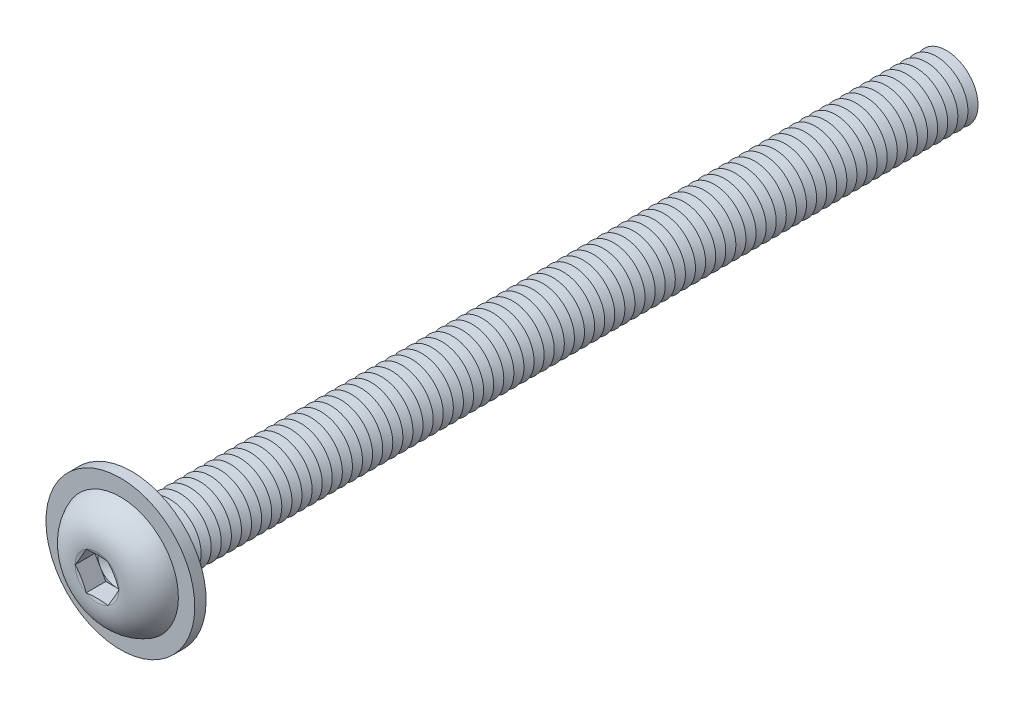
ISO-10303-21;
HEADER;
FILE_DESCRIPTION(('STEP AP214'),'2;1');
FILE_NAME('part.step','',(''),(''),'','','');
FILE_SCHEMA(('AUTOMOTIVE_DESIGN { 1 0 10303 214 1 1 1 1 }'));
ENDSEC;
DATA;
#1=APPLICATION_CONTEXT('core data for automotive mechanical design processes');
#2=APPLICATION_PROTOCOL_DEFINITION('international standard','automotive_design',2000,#1);
#3=PRODUCT_CONTEXT('',#1,'mechanical');
#4=PRODUCT('Part','Part','',(#3));
#5=PRODUCT_RELATED_PRODUCT_CATEGORY('part','',(#4));
#6=PRODUCT_DEFINITION_FORMATION('','',#4);
#7=PRODUCT_DEFINITION_CONTEXT('part definition',#1,'design');
#8=PRODUCT_DEFINITION('design','',#6,#7);
#9=PRODUCT_DEFINITION_SHAPE('','',#8);
#10=(LENGTH_UNIT() NAMED_UNIT(*) SI_UNIT(.MILLI.,.METRE.));
#11=(NAMED_UNIT(*) PLANE_ANGLE_UNIT() SI_UNIT($,.RADIAN.));
#12=(NAMED_UNIT(*) SI_UNIT($,.STERADIAN.) SOLID_ANGLE_UNIT());
#13=UNCERTAINTY_MEASURE_WITH_UNIT(LENGTH_MEASURE(1.E-05),#10,'distance_accuracy_value','');
#14=(GEOMETRIC_REPRESENTATION_CONTEXT(3) GLOBAL_UNCERTAINTY_ASSIGNED_CONTEXT((#13)) GLOBAL_UNIT_ASSIGNED_CONTEXT((#10,
#11,#12)) REPRESENTATION_CONTEXT('',''));
#15=CARTESIAN_POINT('',(0.,0.,0.));
#16=DIRECTION('',(0.,0.,1.));
#17=DIRECTION('',(1.,0.,0.));
#18=AXIS2_PLACEMENT_3D('',#15,#16,#17);
#19=CARTESIAN_POINT('',(0.,0.,-62.2));
#20=DIRECTION('',(0.,0.,1.));
#21=DIRECTION('',(0.,-1.,0.));
#22=AXIS2_PLACEMENT_3D('',#19,#20,#21);
#23=CONICAL_SURFACE('',#22,2.49999999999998,1.0471975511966);
#24=CARTESIAN_POINT('',(0.,0.,-62.6));
#25=DIRECTION('',(0.,0.,1.));
#26=DIRECTION('',(0.,-1.,0.));
#27=AXIS2_PLACEMENT_3D('',#24,#25,#26);
#28=CIRCLE('',#27,1.80717967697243);
#29=CARTESIAN_POINT('',(0.,-1.8071796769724,-62.6));
#30=VERTEX_POINT('',#29);
#31=EDGE_CURVE('E856',#30,#30,#28,.T.);
#32=ORIENTED_EDGE('',*,*,#31,.T.);
#33=EDGE_LOOP('',(#32));
#34=FACE_BOUND('',#33,.T.);
#35=CARTESIAN_POINT('',(0.,0.,-62.2));
#36=DIRECTION('',(0.,0.,1.));
#37=DIRECTION('',(0.,-1.,0.));
#38=AXIS2_PLACEMENT_3D('',#35,#36,#37);
#39=CIRCLE('',#38,2.49999999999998);
#40=CARTESIAN_POINT('',(0.,-2.49999999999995,-62.2));
#41=VERTEX_POINT('',#40);
#42=EDGE_CURVE('E853',#41,#41,#39,.T.);
#43=ORIENTED_EDGE('',*,*,#42,.F.);
#44=EDGE_LOOP('',(#43));
#45=FACE_BOUND('',#44,.T.);
#46=ADVANCED_FACE('F39',(#34,#45),#23,.T.);
#47=CARTESIAN_POINT('',(0.,0.,-62.6));
#48=DIRECTION('',(0.,0.,-1.));
#49=DIRECTION('',(0.,1.,0.));
#50=AXIS2_PLACEMENT_3D('',#47,#48,#49);
#51=CONICAL_SURFACE('',#50,1.80717967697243,1.04719755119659);
#52=CARTESIAN_POINT('',(0.,0.,-63.));
#53=DIRECTION('',(0.,0.,1.));
#54=DIRECTION('',(0.,-1.,0.));
#55=AXIS2_PLACEMENT_3D('',#52,#53,#54);
#56=CIRCLE('',#55,2.49999999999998);
#57=CARTESIAN_POINT('',(0.,-2.49999999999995,-63.));
#58=VERTEX_POINT('',#57);
#59=EDGE_CURVE('E860',#58,#58,#56,.T.);
#60=ORIENTED_EDGE('',*,*,#59,.T.);
#61=EDGE_LOOP('',(#60));
#62=FACE_BOUND('',#61,.T.);
#63=ORIENTED_EDGE('',*,*,#31,.F.);
#64=EDGE_LOOP('',(#63));
#65=FACE_BOUND('',#64,.T.);
#66=ADVANCED_FACE('F983',(#62,#65),#51,.T.);
#67=CARTESIAN_POINT('',(0.,2.49999999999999,-65.));
#68=DIRECTION('',(0.,0.,-1.));
#69=DIRECTION('',(0.,1.,0.));
#70=AXIS2_PLACEMENT_3D('',#67,#68,#69);
#71=PLANE('',#70);
#72=CARTESIAN_POINT('',(0.,0.,-65.));
#73=DIRECTION('',(0.,0.,1.));
#74=DIRECTION('',(0.,-1.,0.));
#75=AXIS2_PLACEMENT_3D('',#72,#73,#74);
#76=CIRCLE('',#75,1.80717967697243);
#77=CARTESIAN_POINT('',(0.,-1.8071796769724,-65.));
#78=VERTEX_POINT('',#77);
#79=EDGE_CURVE('E880',#78,#78,#76,.T.);
#80=ORIENTED_EDGE('',*,*,#79,.F.);
#81=EDGE_LOOP('',(#80));
#82=FACE_BOUND('',#81,.T.);
#83=ADVANCED_FACE('F989',(#82),#71,.T.);
#84=CARTESIAN_POINT('',(0.,0.,-64.6));
#85=DIRECTION('',(0.,0.,1.));
#86=DIRECTION('',(0.,-1.,0.));
#87=AXIS2_PLACEMENT_3D('',#84,#85,#86);
#88=CONICAL_SURFACE('',#87,2.49999999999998,1.0471975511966);
#89=ORIENTED_EDGE('',*,*,#79,.T.);
#90=EDGE_LOOP('',(#89));
#91=FACE_BOUND('',#90,.T.);
#92=CARTESIAN_POINT('',(0.,0.,-64.6));
#93=DIRECTION('',(0.,0.,1.));
#94=DIRECTION('',(0.,-1.,0.));
#95=AXIS2_PLACEMENT_3D('',#92,#93,#94);
#96=CIRCLE('',#95,2.49999999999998);
#97=CARTESIAN_POINT('',(0.,-2.49999999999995,-64.6));
#98=VERTEX_POINT('',#97);
#99=EDGE_CURVE('E876',#98,#98,#96,.T.);
#100=ORIENTED_EDGE('',*,*,#99,.F.);
#101=EDGE_LOOP('',(#100));
#102=FACE_BOUND('',#101,.T.);
#103=ADVANCED_FACE('F1008',(#91,#102),#88,.T.);
#104=CARTESIAN_POINT('',(0.,0.,-64.2));
#105=DIRECTION('',(0.,0.,-1.));
#106=DIRECTION('',(0.,1.,0.));
#107=AXIS2_PLACEMENT_3D('',#104,#105,#106);
#108=CONICAL_SURFACE('',#107,1.80717967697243,1.04719755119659);
#109=ORIENTED_EDGE('',*,*,#99,.T.);
#110=EDGE_LOOP('',(#109));
#111=FACE_BOUND('',#110,.T.);
#112=CARTESIAN_POINT('',(0.,0.,-64.2));
#113=DIRECTION('',(0.,0.,1.));
#114=DIRECTION('',(0.,-1.,0.));
#115=AXIS2_PLACEMENT_3D('',#112,#113,#114);
#116=CIRCLE('',#115,1.80717967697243);
#117=CARTESIAN_POINT('',(0.,-1.8071796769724,-64.2));
#118=VERTEX_POINT('',#117);
#119=EDGE_CURVE('E872',#118,#118,#116,.T.);
#120=ORIENTED_EDGE('',*,*,#119,.F.);
#121=EDGE_LOOP('',(#120));
#122=FACE_BOUND('',#121,.T.);
#123=ADVANCED_FACE('F1005',(#111,#122),#108,.T.);
#124=CARTESIAN_POINT('',(0.,0.,-63.8));
#125=DIRECTION('',(0.,0.,1.));
#126=DIRECTION('',(0.,-1.,0.));
#127=AXIS2_PLACEMENT_3D('',#124,#125,#126);
#128=CONICAL_SURFACE('',#127,2.49999999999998,1.0471975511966);
#129=ORIENTED_EDGE('',*,*,#119,.T.);
#130=EDGE_LOOP('',(#129));
#131=FACE_BOUND('',#130,.T.);
#132=CARTESIAN_POINT('',(0.,0.,-63.8));
#133=DIRECTION('',(0.,0.,1.));
#134=DIRECTION('',(0.,-1.,0.));
#135=AXIS2_PLACEMENT_3D('',#132,#133,#134);
#136=CIRCLE('',#135,2.49999999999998);
#137=CARTESIAN_POINT('',(0.,-2.49999999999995,-63.8));
#138=VERTEX_POINT('',#137);
#139=EDGE_CURVE('E868',#138,#138,#136,.T.);
#140=ORIENTED_EDGE('',*,*,#139,.F.);
#141=EDGE_LOOP('',(#140));
#142=FACE_BOUND('',#141,.T.);
#143=ADVANCED_FACE('F999',(#131,#142),#128,.T.);
#144=CARTESIAN_POINT('',(0.,0.,-63.4));
#145=DIRECTION('',(0.,0.,-1.));
#146=DIRECTION('',(0.,1.,0.));
#147=AXIS2_PLACEMENT_3D('',#144,#145,#146);
#148=CONICAL_SURFACE('',#147,1.80717967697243,1.04719755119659);
#149=ORIENTED_EDGE('',*,*,#139,.T.);
#150=EDGE_LOOP('',(#149));
#151=FACE_BOUND('',#150,.T.);
#152=CARTESIAN_POINT('',(0.,0.,-63.4));
#153=DIRECTION('',(0.,0.,1.));
#154=DIRECTION('',(0.,-1.,0.));
#155=AXIS2_PLACEMENT_3D('',#152,#153,#154);
#156=CIRCLE('',#155,1.80717967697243);
#157=CARTESIAN_POINT('',(0.,-1.8071796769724,-63.4));
#158=VERTEX_POINT('',#157);
#159=EDGE_CURVE('E864',#158,#158,#156,.T.);
#160=ORIENTED_EDGE('',*,*,#159,.F.);
#161=EDGE_LOOP('',(#160));
#162=FACE_BOUND('',#161,.T.);
#163=ADVANCED_FACE('F995',(#151,#162),#148,.T.);
#164=CARTESIAN_POINT('',(0.,0.,-63.));
#165=DIRECTION('',(0.,0.,1.));
#166=DIRECTION('',(0.,-1.,0.));
#167=AXIS2_PLACEMENT_3D('',#164,#165,#166);
#168=CONICAL_SURFACE('',#167,2.49999999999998,1.0471975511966);
#169=ORIENTED_EDGE('',*,*,#159,.T.);
#170=EDGE_LOOP('',(#169));
#171=FACE_BOUND('',#170,.T.);
#172=ORIENTED_EDGE('',*,*,#59,.F.);
#173=EDGE_LOOP('',(#172));
#174=FACE_BOUND('',#173,.T.);
#175=ADVANCED_FACE('F998',(#171,#174),#168,.T.);
#176=CARTESIAN_POINT('',(0.,0.,-61.4));
#177=DIRECTION('',(0.,0.,1.));
#178=DIRECTION('',(0.,-1.,0.));
#179=AXIS2_PLACEMENT_3D('',#176,#177,#178);
#180=CONICAL_SURFACE('',#179,2.49999999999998,1.0471975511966);
#181=CARTESIAN_POINT('',(0.,0.,-61.8));
#182=DIRECTION('',(0.,0.,1.));
#183=DIRECTION('',(0.,-1.,0.));
#184=AXIS2_PLACEMENT_3D('',#181,#182,#183);
#185=CIRCLE('',#184,1.80717967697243);
#186=CARTESIAN_POINT('',(0.,-1.8071796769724,-61.8));
#187=VERTEX_POINT('',#186);
#188=EDGE_CURVE('E849',#187,#187,#185,.T.);
#189=ORIENTED_EDGE('',*,*,#188,.T.);
#190=EDGE_LOOP('',(#189));
#191=FACE_BOUND('',#190,.T.);
#192=CARTESIAN_POINT('',(0.,0.,-61.4));
#193=DIRECTION('',(0.,0.,1.));
#194=DIRECTION('',(0.,-1.,0.));
#195=AXIS2_PLACEMENT_3D('',#192,#193,#194);
#196=CIRCLE('',#195,2.49999999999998);
#197=CARTESIAN_POINT('',(0.,-2.49999999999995,-61.4));
#198=VERTEX_POINT('',#197);
#199=EDGE_CURVE('E845',#198,#198,#196,.T.);
#200=ORIENTED_EDGE('',*,*,#199,.F.);
#201=EDGE_LOOP('',(#200));
#202=FACE_BOUND('',#201,.T.);
#203=ADVANCED_FACE('F1003',(#191,#202),#180,.T.);
#204=CARTESIAN_POINT('',(0.,0.,-61.8));
#205=DIRECTION('',(0.,0.,-1.));
#206=DIRECTION('',(0.,1.,0.));
#207=AXIS2_PLACEMENT_3D('',#204,#205,#206);
#208=CONICAL_SURFACE('',#207,1.80717967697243,1.04719755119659);
#209=ORIENTED_EDGE('',*,*,#42,.T.);
#210=EDGE_LOOP('',(#209));
#211=FACE_BOUND('',#210,.T.);
#212=ORIENTED_EDGE('',*,*,#188,.F.);
#213=EDGE_LOOP('',(#212));
#214=FACE_BOUND('',#213,.T.);
#215=ADVANCED_FACE('F1054',(#211,#214),#208,.T.);
#216=CARTESIAN_POINT('',(0.,0.,-60.6));
#217=DIRECTION('',(0.,0.,1.));
#218=DIRECTION('',(0.,-1.,0.));
#219=AXIS2_PLACEMENT_3D('',#216,#217,#218);
#220=CONICAL_SURFACE('',#219,2.49999999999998,1.0471975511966);
#221=CARTESIAN_POINT('',(0.,0.,-61.));
#222=DIRECTION('',(0.,0.,1.));
#223=DIRECTION('',(0.,-1.,0.));
#224=AXIS2_PLACEMENT_3D('',#221,#222,#223);
#225=CIRCLE('',#224,1.80717967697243);
#226=CARTESIAN_POINT('',(0.,-1.8071796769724,-61.));
#227=VERTEX_POINT('',#226);
#228=EDGE_CURVE('E841',#227,#227,#225,.T.);
#229=ORIENTED_EDGE('',*,*,#228,.T.);
#230=EDGE_LOOP('',(#229));
#231=FACE_BOUND('',#230,.T.);
#232=CARTESIAN_POINT('',(0.,0.,-60.6));
#233=DIRECTION('',(0.,0.,1.));
#234=DIRECTION('',(0.,-1.,0.));
#235=AXIS2_PLACEMENT_3D('',#232,#233,#234);
#236=CIRCLE('',#235,2.49999999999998);
#237=CARTESIAN_POINT('',(0.,-2.49999999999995,-60.6));
#238=VERTEX_POINT('',#237);
#239=EDGE_CURVE('E837',#238,#238,#236,.T.);
#240=ORIENTED_EDGE('',*,*,#239,.F.);
#241=EDGE_LOOP('',(#240));
#242=FACE_BOUND('',#241,.T.);
#243=ADVANCED_FACE('F1060',(#231,#242),#220,.T.);
#244=CARTESIAN_POINT('',(0.,0.,-61.));
#245=DIRECTION('',(0.,0.,-1.));
#246=DIRECTION('',(0.,1.,0.));
#247=AXIS2_PLACEMENT_3D('',#244,#245,#246);
#248=CONICAL_SURFACE('',#247,1.80717967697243,1.04719755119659);
#249=ORIENTED_EDGE('',*,*,#199,.T.);
#250=EDGE_LOOP('',(#249));
#251=FACE_BOUND('',#250,.T.);
#252=ORIENTED_EDGE('',*,*,#228,.F.);
#253=EDGE_LOOP('',(#252));
#254=FACE_BOUND('',#253,.T.);
#255=ADVANCED_FACE('F1067',(#251,#254),#248,.T.);
#256=CARTESIAN_POINT('',(0.,0.,-59.8));
#257=DIRECTION('',(0.,0.,1.));
#258=DIRECTION('',(0.,-1.,0.));
#259=AXIS2_PLACEMENT_3D('',#256,#257,#258);
#260=CONICAL_SURFACE('',#259,2.49999999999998,1.0471975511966);
#261=CARTESIAN_POINT('',(0.,0.,-60.2));
#262=DIRECTION('',(0.,0.,1.));
#263=DIRECTION('',(0.,-1.,0.));
#264=AXIS2_PLACEMENT_3D('',#261,#262,#263);
#265=CIRCLE('',#264,1.80717967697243);
#266=CARTESIAN_POINT('',(0.,-1.8071796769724,-60.2));
#267=VERTEX_POINT('',#266);
#268=EDGE_CURVE('E833',#267,#267,#265,.T.);
#269=ORIENTED_EDGE('',*,*,#268,.T.);
#270=EDGE_LOOP('',(#269));
#271=FACE_BOUND('',#270,.T.);
#272=CARTESIAN_POINT('',(0.,0.,-59.8));
#273=DIRECTION('',(0.,0.,1.));
#274=DIRECTION('',(0.,-1.,0.));
#275=AXIS2_PLACEMENT_3D('',#272,#273,#274);
#276=CIRCLE('',#275,2.49999999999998);
#277=CARTESIAN_POINT('',(0.,-2.49999999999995,-59.8));
#278=VERTEX_POINT('',#277);
#279=EDGE_CURVE('E829',#278,#278,#276,.T.);
#280=ORIENTED_EDGE('',*,*,#279,.F.);
#281=EDGE_LOOP('',(#280));
#282=FACE_BOUND('',#281,.T.);
#283=ADVANCED_FACE('F1074',(#271,#282),#260,.T.);
#284=CARTESIAN_POINT('',(0.,0.,-60.2));
#285=DIRECTION('',(0.,0.,-1.));
#286=DIRECTION('',(0.,1.,0.));
#287=AXIS2_PLACEMENT_3D('',#284,#285,#286);
#288=CONICAL_SURFACE('',#287,1.80717967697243,1.04719755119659);
#289=ORIENTED_EDGE('',*,*,#239,.T.);
#290=EDGE_LOOP('',(#289));
#291=FACE_BOUND('',#290,.T.);
#292=ORIENTED_EDGE('',*,*,#268,.F.);
#293=EDGE_LOOP('',(#292));
#294=FACE_BOUND('',#293,.T.);
#295=ADVANCED_FACE('F1081',(#291,#294),#288,.T.);
#296=CARTESIAN_POINT('',(0.,0.,-59.));
#297=DIRECTION('',(0.,0.,1.));
#298=DIRECTION('',(0.,-1.,0.));
#299=AXIS2_PLACEMENT_3D('',#296,#297,#298);
#300=CONICAL_SURFACE('',#299,2.49999999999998,1.0471975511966);
#301=CARTESIAN_POINT('',(0.,0.,-59.4));
#302=DIRECTION('',(0.,0.,1.));
#303=DIRECTION('',(0.,-1.,0.));
#304=AXIS2_PLACEMENT_3D('',#301,#302,#303);
#305=CIRCLE('',#304,1.80717967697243);
#306=CARTESIAN_POINT('',(0.,-1.8071796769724,-59.4));
#307=VERTEX_POINT('',#306);
#308=EDGE_CURVE('E825',#307,#307,#305,.T.);
#309=ORIENTED_EDGE('',*,*,#308,.T.);
#310=EDGE_LOOP('',(#309));
#311=FACE_BOUND('',#310,.T.);
#312=CARTESIAN_POINT('',(0.,0.,-59.));
#313=DIRECTION('',(0.,0.,1.));
#314=DIRECTION('',(0.,-1.,0.));
#315=AXIS2_PLACEMENT_3D('',#312,#313,#314);
#316=CIRCLE('',#315,2.49999999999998);
#317=CARTESIAN_POINT('',(0.,-2.49999999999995,-59.));
#318=VERTEX_POINT('',#317);
#319=EDGE_CURVE('E821',#318,#318,#316,.T.);
#320=ORIENTED_EDGE('',*,*,#319,.F.);
#321=EDGE_LOOP('',(#320));
#322=FACE_BOUND('',#321,.T.);
#323=ADVANCED_FACE('F1088',(#311,#322),#300,.T.);
#324=CARTESIAN_POINT('',(0.,0.,-59.4));
#325=DIRECTION('',(0.,0.,-1.));
#326=DIRECTION('',(0.,1.,0.));
#327=AXIS2_PLACEMENT_3D('',#324,#325,#326);
#328=CONICAL_SURFACE('',#327,1.80717967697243,1.04719755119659);
#329=ORIENTED_EDGE('',*,*,#279,.T.);
#330=EDGE_LOOP('',(#329));
#331=FACE_BOUND('',#330,.T.);
#332=ORIENTED_EDGE('',*,*,#308,.F.);
#333=EDGE_LOOP('',(#332));
#334=FACE_BOUND('',#333,.T.);
#335=ADVANCED_FACE('F1095',(#331,#334),#328,.T.);
#336=CARTESIAN_POINT('',(0.,0.,-58.2));
#337=DIRECTION('',(0.,0.,1.));
#338=DIRECTION('',(0.,-1.,0.));
#339=AXIS2_PLACEMENT_3D('',#336,#337,#338);
#340=CONICAL_SURFACE('',#339,2.49999999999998,1.0471975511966);
#341=CARTESIAN_POINT('',(0.,0.,-58.6));
#342=DIRECTION('',(0.,0.,1.));
#343=DIRECTION('',(0.,-1.,0.));
#344=AXIS2_PLACEMENT_3D('',#341,#342,#343);
#345=CIRCLE('',#344,1.80717967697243);
#346=CARTESIAN_POINT('',(0.,-1.8071796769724,-58.6));
#347=VERTEX_POINT('',#346);
#348=EDGE_CURVE('E817',#347,#347,#345,.T.);
#349=ORIENTED_EDGE('',*,*,#348,.T.);
#350=EDGE_LOOP('',(#349));
#351=FACE_BOUND('',#350,.T.);
#352=CARTESIAN_POINT('',(0.,0.,-58.2));
#353=DIRECTION('',(0.,0.,1.));
#354=DIRECTION('',(0.,-1.,0.));
#355=AXIS2_PLACEMENT_3D('',#352,#353,#354);
#356=CIRCLE('',#355,2.49999999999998);
#357=CARTESIAN_POINT('',(0.,-2.49999999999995,-58.2));
#358=VERTEX_POINT('',#357);
#359=EDGE_CURVE('E813',#358,#358,#356,.T.);
#360=ORIENTED_EDGE('',*,*,#359,.F.);
#361=EDGE_LOOP('',(#360));
#362=FACE_BOUND('',#361,.T.);
#363=ADVANCED_FACE('F1102',(#351,#362),#340,.T.);
#364=CARTESIAN_POINT('',(0.,0.,-58.6));
#365=DIRECTION('',(0.,0.,-1.));
#366=DIRECTION('',(0.,1.,0.));
#367=AXIS2_PLACEMENT_3D('',#364,#365,#366);
#368=CONICAL_SURFACE('',#367,1.80717967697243,1.04719755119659);
#369=ORIENTED_EDGE('',*,*,#319,.T.);
#370=EDGE_LOOP('',(#369));
#371=FACE_BOUND('',#370,.T.);
#372=ORIENTED_EDGE('',*,*,#348,.F.);
#373=EDGE_LOOP('',(#372));
#374=FACE_BOUND('',#373,.T.);
#375=ADVANCED_FACE('F1109',(#371,#374),#368,.T.);
#376=CARTESIAN_POINT('',(0.,0.,-57.4));
#377=DIRECTION('',(0.,0.,1.));
#378=DIRECTION('',(0.,-1.,0.));
#379=AXIS2_PLACEMENT_3D('',#376,#377,#378);
#380=CONICAL_SURFACE('',#379,2.49999999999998,1.0471975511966);
#381=CARTESIAN_POINT('',(0.,0.,-57.8));
#382=DIRECTION('',(0.,0.,1.));
#383=DIRECTION('',(0.,-1.,0.));
#384=AXIS2_PLACEMENT_3D('',#381,#382,#383);
#385=CIRCLE('',#384,1.80717967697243);
#386=CARTESIAN_POINT('',(0.,-1.8071796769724,-57.8));
#387=VERTEX_POINT('',#386);
#388=EDGE_CURVE('E809',#387,#387,#385,.T.);
#389=ORIENTED_EDGE('',*,*,#388,.T.);
#390=EDGE_LOOP('',(#389));
#391=FACE_BOUND('',#390,.T.);
#392=CARTESIAN_POINT('',(0.,0.,-57.4));
#393=DIRECTION('',(0.,0.,1.));
#394=DIRECTION('',(0.,-1.,0.));
#395=AXIS2_PLACEMENT_3D('',#392,#393,#394);
#396=CIRCLE('',#395,2.49999999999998);
#397=CARTESIAN_POINT('',(0.,-2.49999999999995,-57.4));
#398=VERTEX_POINT('',#397);
#399=EDGE_CURVE('E805',#398,#398,#396,.T.);
#400=ORIENTED_EDGE('',*,*,#399,.F.);
#401=EDGE_LOOP('',(#400));
#402=FACE_BOUND('',#401,.T.);
#403=ADVANCED_FACE('F1116',(#391,#402),#380,.T.);
#404=CARTESIAN_POINT('',(0.,0.,-57.8));
#405=DIRECTION('',(0.,0.,-1.));
#406=DIRECTION('',(0.,1.,0.));
#407=AXIS2_PLACEMENT_3D('',#404,#405,#406);
#408=CONICAL_SURFACE('',#407,1.80717967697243,1.04719755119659);
#409=ORIENTED_EDGE('',*,*,#359,.T.);
#410=EDGE_LOOP('',(#409));
#411=FACE_BOUND('',#410,.T.);
#412=ORIENTED_EDGE('',*,*,#388,.F.);
#413=EDGE_LOOP('',(#412));
#414=FACE_BOUND('',#413,.T.);
#415=ADVANCED_FACE('F1123',(#411,#414),#408,.T.);
#416=CARTESIAN_POINT('',(0.,0.,-56.6));
#417=DIRECTION('',(0.,0.,1.));
#418=DIRECTION('',(0.,-1.,0.));
#419=AXIS2_PLACEMENT_3D('',#416,#417,#418);
#420=CONICAL_SURFACE('',#419,2.49999999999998,1.0471975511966);
#421=CARTESIAN_POINT('',(0.,0.,-57.));
#422=DIRECTION('',(0.,0.,1.));
#423=DIRECTION('',(0.,-1.,0.));
#424=AXIS2_PLACEMENT_3D('',#421,#422,#423);
#425=CIRCLE('',#424,1.80717967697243);
#426=CARTESIAN_POINT('',(0.,-1.8071796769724,-57.));
#427=VERTEX_POINT('',#426);
#428=EDGE_CURVE('E801',#427,#427,#425,.T.);
#429=ORIENTED_EDGE('',*,*,#428,.T.);
#430=EDGE_LOOP('',(#429));
#431=FACE_BOUND('',#430,.T.);
#432=CARTESIAN_POINT('',(0.,0.,-56.6));
#433=DIRECTION('',(0.,0.,1.));
#434=DIRECTION('',(0.,-1.,0.));
#435=AXIS2_PLACEMENT_3D('',#432,#433,#434);
#436=CIRCLE('',#435,2.49999999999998);
#437=CARTESIAN_POINT('',(0.,-2.49999999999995,-56.6));
#438=VERTEX_POINT('',#437);
#439=EDGE_CURVE('E797',#438,#438,#436,.T.);
#440=ORIENTED_EDGE('',*,*,#439,.F.);
#441=EDGE_LOOP('',(#440));
#442=FACE_BOUND('',#441,.T.);
#443=ADVANCED_FACE('F1130',(#431,#442),#420,.T.);
#444=CARTESIAN_POINT('',(0.,0.,-57.));
#445=DIRECTION('',(0.,0.,-1.));
#446=DIRECTION('',(0.,1.,0.));
#447=AXIS2_PLACEMENT_3D('',#444,#445,#446);
#448=CONICAL_SURFACE('',#447,1.80717967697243,1.04719755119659);
#449=ORIENTED_EDGE('',*,*,#399,.T.);
#450=EDGE_LOOP('',(#449));
#451=FACE_BOUND('',#450,.T.);
#452=ORIENTED_EDGE('',*,*,#428,.F.);
#453=EDGE_LOOP('',(#452));
#454=FACE_BOUND('',#453,.T.);
#455=ADVANCED_FACE('F1137',(#451,#454),#448,.T.);
#456=CARTESIAN_POINT('',(0.,0.,-55.8));
#457=DIRECTION('',(0.,0.,1.));
#458=DIRECTION('',(0.,-1.,0.));
#459=AXIS2_PLACEMENT_3D('',#456,#457,#458);
#460=CONICAL_SURFACE('',#459,2.49999999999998,1.0471975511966);
#461=CARTESIAN_POINT('',(0.,0.,-56.2));
#462=DIRECTION('',(0.,0.,1.));
#463=DIRECTION('',(0.,-1.,0.));
#464=AXIS2_PLACEMENT_3D('',#461,#462,#463);
#465=CIRCLE('',#464,1.80717967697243);
#466=CARTESIAN_POINT('',(0.,-1.8071796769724,-56.2));
#467=VERTEX_POINT('',#466);
#468=EDGE_CURVE('E793',#467,#467,#465,.T.);
#469=ORIENTED_EDGE('',*,*,#468,.T.);
#470=EDGE_LOOP('',(#469));
#471=FACE_BOUND('',#470,.T.);
#472=CARTESIAN_POINT('',(0.,0.,-55.8));
#473=DIRECTION('',(0.,0.,1.));
#474=DIRECTION('',(0.,-1.,0.));
#475=AXIS2_PLACEMENT_3D('',#472,#473,#474);
#476=CIRCLE('',#475,2.49999999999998);
#477=CARTESIAN_POINT('',(0.,-2.49999999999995,-55.8));
#478=VERTEX_POINT('',#477);
#479=EDGE_CURVE('E789',#478,#478,#476,.T.);
#480=ORIENTED_EDGE('',*,*,#479,.F.);
#481=EDGE_LOOP('',(#480));
#482=FACE_BOUND('',#481,.T.);
#483=ADVANCED_FACE('F1144',(#471,#482),#460,.T.);
#484=CARTESIAN_POINT('',(0.,0.,-56.2));
#485=DIRECTION('',(0.,0.,-1.));
#486=DIRECTION('',(0.,1.,0.));
#487=AXIS2_PLACEMENT_3D('',#484,#485,#486);
#488=CONICAL_SURFACE('',#487,1.80717967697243,1.04719755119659);
#489=ORIENTED_EDGE('',*,*,#439,.T.);
#490=EDGE_LOOP('',(#489));
#491=FACE_BOUND('',#490,.T.);
#492=ORIENTED_EDGE('',*,*,#468,.F.);
#493=EDGE_LOOP('',(#492));
#494=FACE_BOUND('',#493,.T.);
#495=ADVANCED_FACE('F1151',(#491,#494),#488,.T.);
#496=CARTESIAN_POINT('',(0.,0.,-55.));
#497=DIRECTION('',(0.,0.,1.));
#498=DIRECTION('',(0.,-1.,0.));
#499=AXIS2_PLACEMENT_3D('',#496,#497,#498);
#500=CONICAL_SURFACE('',#499,2.49999999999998,1.0471975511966);
#501=CARTESIAN_POINT('',(0.,0.,-55.4));
#502=DIRECTION('',(0.,0.,1.));
#503=DIRECTION('',(0.,-1.,0.));
#504=AXIS2_PLACEMENT_3D('',#501,#502,#503);
#505=CIRCLE('',#504,1.80717967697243);
#506=CARTESIAN_POINT('',(0.,-1.8071796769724,-55.4));
#507=VERTEX_POINT('',#506);
#508=EDGE_CURVE('E785',#507,#507,#505,.T.);
#509=ORIENTED_EDGE('',*,*,#508,.T.);
#510=EDGE_LOOP('',(#509));
#511=FACE_BOUND('',#510,.T.);
#512=CARTESIAN_POINT('',(0.,0.,-55.));
#513=DIRECTION('',(0.,0.,1.));
#514=DIRECTION('',(0.,-1.,0.));
#515=AXIS2_PLACEMENT_3D('',#512,#513,#514);
#516=CIRCLE('',#515,2.49999999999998);
#517=CARTESIAN_POINT('',(0.,-2.49999999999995,-55.));
#518=VERTEX_POINT('',#517);
#519=EDGE_CURVE('E781',#518,#518,#516,.T.);
#520=ORIENTED_EDGE('',*,*,#519,.F.);
#521=EDGE_LOOP('',(#520));
#522=FACE_BOUND('',#521,.T.);
#523=ADVANCED_FACE('F1158',(#511,#522),#500,.T.);
#524=CARTESIAN_POINT('',(0.,0.,-55.4));
#525=DIRECTION('',(0.,0.,-1.));
#526=DIRECTION('',(0.,1.,0.));
#527=AXIS2_PLACEMENT_3D('',#524,#525,#526);
#528=CONICAL_SURFACE('',#527,1.80717967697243,1.04719755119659);
#529=ORIENTED_EDGE('',*,*,#479,.T.);
#530=EDGE_LOOP('',(#529));
#531=FACE_BOUND('',#530,.T.);
#532=ORIENTED_EDGE('',*,*,#508,.F.);
#533=EDGE_LOOP('',(#532));
#534=FACE_BOUND('',#533,.T.);
#535=ADVANCED_FACE('F1165',(#531,#534),#528,.T.);
#536=CARTESIAN_POINT('',(0.,0.,-54.2));
#537=DIRECTION('',(0.,0.,1.));
#538=DIRECTION('',(0.,-1.,0.));
#539=AXIS2_PLACEMENT_3D('',#536,#537,#538);
#540=CONICAL_SURFACE('',#539,2.49999999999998,1.0471975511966);
#541=CARTESIAN_POINT('',(0.,0.,-54.6));
#542=DIRECTION('',(0.,0.,1.));
#543=DIRECTION('',(0.,-1.,0.));
#544=AXIS2_PLACEMENT_3D('',#541,#542,#543);
#545=CIRCLE('',#544,1.80717967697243);
#546=CARTESIAN_POINT('',(0.,-1.8071796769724,-54.6));
#547=VERTEX_POINT('',#546);
#548=EDGE_CURVE('E777',#547,#547,#545,.T.);
#549=ORIENTED_EDGE('',*,*,#548,.T.);
#550=EDGE_LOOP('',(#549));
#551=FACE_BOUND('',#550,.T.);
#552=CARTESIAN_POINT('',(0.,0.,-54.2));
#553=DIRECTION('',(0.,0.,1.));
#554=DIRECTION('',(0.,-1.,0.));
#555=AXIS2_PLACEMENT_3D('',#552,#553,#554);
#556=CIRCLE('',#555,2.49999999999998);
#557=CARTESIAN_POINT('',(0.,-2.49999999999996,-54.2));
#558=VERTEX_POINT('',#557);
#559=EDGE_CURVE('E773',#558,#558,#556,.T.);
#560=ORIENTED_EDGE('',*,*,#559,.F.);
#561=EDGE_LOOP('',(#560));
#562=FACE_BOUND('',#561,.T.);
#563=ADVANCED_FACE('F1172',(#551,#562),#540,.T.);
#564=CARTESIAN_POINT('',(0.,0.,-54.6));
#565=DIRECTION('',(0.,0.,-1.));
#566=DIRECTION('',(0.,1.,0.));
#567=AXIS2_PLACEMENT_3D('',#564,#565,#566);
#568=CONICAL_SURFACE('',#567,1.80717967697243,1.04719755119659);
#569=ORIENTED_EDGE('',*,*,#519,.T.);
#570=EDGE_LOOP('',(#569));
#571=FACE_BOUND('',#570,.T.);
#572=ORIENTED_EDGE('',*,*,#548,.F.);
#573=EDGE_LOOP('',(#572));
#574=FACE_BOUND('',#573,.T.);
#575=ADVANCED_FACE('F1179',(#571,#574),#568,.T.);
#576=CARTESIAN_POINT('',(0.,0.,-53.4));
#577=DIRECTION('',(0.,0.,1.));
#578=DIRECTION('',(0.,-1.,0.));
#579=AXIS2_PLACEMENT_3D('',#576,#577,#578);
#580=CONICAL_SURFACE('',#579,2.49999999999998,1.0471975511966);
#581=CARTESIAN_POINT('',(0.,0.,-53.8));
#582=DIRECTION('',(0.,0.,1.));
#583=DIRECTION('',(0.,-1.,0.));
#584=AXIS2_PLACEMENT_3D('',#581,#582,#583);
#585=CIRCLE('',#584,1.80717967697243);
#586=CARTESIAN_POINT('',(0.,-1.8071796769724,-53.8));
#587=VERTEX_POINT('',#586);
#588=EDGE_CURVE('E769',#587,#587,#585,.T.);
#589=ORIENTED_EDGE('',*,*,#588,.T.);
#590=EDGE_LOOP('',(#589));
#591=FACE_BOUND('',#590,.T.);
#592=CARTESIAN_POINT('',(0.,0.,-53.4));
#593=DIRECTION('',(0.,0.,1.));
#594=DIRECTION('',(0.,-1.,0.));
#595=AXIS2_PLACEMENT_3D('',#592,#593,#594);
#596=CIRCLE('',#595,2.49999999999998);
#597=CARTESIAN_POINT('',(0.,-2.49999999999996,-53.4));
#598=VERTEX_POINT('',#597);
#599=EDGE_CURVE('E765',#598,#598,#596,.T.);
#600=ORIENTED_EDGE('',*,*,#599,.F.);
#601=EDGE_LOOP('',(#600));
#602=FACE_BOUND('',#601,.T.);
#603=ADVANCED_FACE('F1186',(#591,#602),#580,.T.);
#604=CARTESIAN_POINT('',(0.,0.,-53.8));
#605=DIRECTION('',(0.,0.,-1.));
#606=DIRECTION('',(0.,1.,0.));
#607=AXIS2_PLACEMENT_3D('',#604,#605,#606);
#608=CONICAL_SURFACE('',#607,1.80717967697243,1.04719755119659);
#609=ORIENTED_EDGE('',*,*,#559,.T.);
#610=EDGE_LOOP('',(#609));
#611=FACE_BOUND('',#610,.T.);
#612=ORIENTED_EDGE('',*,*,#588,.F.);
#613=EDGE_LOOP('',(#612));
#614=FACE_BOUND('',#613,.T.);
#615=ADVANCED_FACE('F1193',(#611,#614),#608,.T.);
#616=CARTESIAN_POINT('',(0.,0.,-52.6));
#617=DIRECTION('',(0.,0.,1.));
#618=DIRECTION('',(0.,-1.,0.));
#619=AXIS2_PLACEMENT_3D('',#616,#617,#618);
#620=CONICAL_SURFACE('',#619,2.49999999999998,1.0471975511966);
#621=CARTESIAN_POINT('',(0.,0.,-53.));
#622=DIRECTION('',(0.,0.,1.));
#623=DIRECTION('',(0.,-1.,0.));
#624=AXIS2_PLACEMENT_3D('',#621,#622,#623);
#625=CIRCLE('',#624,1.80717967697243);
#626=CARTESIAN_POINT('',(0.,-1.8071796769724,-53.));
#627=VERTEX_POINT('',#626);
#628=EDGE_CURVE('E761',#627,#627,#625,.T.);
#629=ORIENTED_EDGE('',*,*,#628,.T.);
#630=EDGE_LOOP('',(#629));
#631=FACE_BOUND('',#630,.T.);
#632=CARTESIAN_POINT('',(0.,0.,-52.6));
#633=DIRECTION('',(0.,0.,1.));
#634=DIRECTION('',(0.,-1.,0.));
#635=AXIS2_PLACEMENT_3D('',#632,#633,#634);
#636=CIRCLE('',#635,2.49999999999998);
#637=CARTESIAN_POINT('',(0.,-2.49999999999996,-52.6));
#638=VERTEX_POINT('',#637);
#639=EDGE_CURVE('E757',#638,#638,#636,.T.);
#640=ORIENTED_EDGE('',*,*,#639,.F.);
#641=EDGE_LOOP('',(#640));
#642=FACE_BOUND('',#641,.T.);
#643=ADVANCED_FACE('F1200',(#631,#642),#620,.T.);
#644=CARTESIAN_POINT('',(0.,0.,-53.));
#645=DIRECTION('',(0.,0.,-1.));
#646=DIRECTION('',(0.,1.,0.));
#647=AXIS2_PLACEMENT_3D('',#644,#645,#646);
#648=CONICAL_SURFACE('',#647,1.80717967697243,1.04719755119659);
#649=ORIENTED_EDGE('',*,*,#599,.T.);
#650=EDGE_LOOP('',(#649));
#651=FACE_BOUND('',#650,.T.);
#652=ORIENTED_EDGE('',*,*,#628,.F.);
#653=EDGE_LOOP('',(#652));
#654=FACE_BOUND('',#653,.T.);
#655=ADVANCED_FACE('F1207',(#651,#654),#648,.T.);
#656=CARTESIAN_POINT('',(0.,0.,-51.8));
#657=DIRECTION('',(0.,0.,1.));
#658=DIRECTION('',(0.,-1.,0.));
#659=AXIS2_PLACEMENT_3D('',#656,#657,#658);
#660=CONICAL_SURFACE('',#659,2.49999999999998,1.0471975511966);
#661=CARTESIAN_POINT('',(0.,0.,-52.2));
#662=DIRECTION('',(0.,0.,1.));
#663=DIRECTION('',(0.,-1.,0.));
#664=AXIS2_PLACEMENT_3D('',#661,#662,#663);
#665=CIRCLE('',#664,1.80717967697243);
#666=CARTESIAN_POINT('',(0.,-1.8071796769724,-52.2));
#667=VERTEX_POINT('',#666);
#668=EDGE_CURVE('E753',#667,#667,#665,.T.);
#669=ORIENTED_EDGE('',*,*,#668,.T.);
#670=EDGE_LOOP('',(#669));
#671=FACE_BOUND('',#670,.T.);
#672=CARTESIAN_POINT('',(0.,0.,-51.8));
#673=DIRECTION('',(0.,0.,1.));
#674=DIRECTION('',(0.,-1.,0.));
#675=AXIS2_PLACEMENT_3D('',#672,#673,#674);
#676=CIRCLE('',#675,2.49999999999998);
#677=CARTESIAN_POINT('',(0.,-2.49999999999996,-51.8));
#678=VERTEX_POINT('',#677);
#679=EDGE_CURVE('E749',#678,#678,#676,.T.);
#680=ORIENTED_EDGE('',*,*,#679,.F.);
#681=EDGE_LOOP('',(#680));
#682=FACE_BOUND('',#681,.T.);
#683=ADVANCED_FACE('F1214',(#671,#682),#660,.T.);
#684=CARTESIAN_POINT('',(0.,0.,-52.2));
#685=DIRECTION('',(0.,0.,-1.));
#686=DIRECTION('',(0.,1.,0.));
#687=AXIS2_PLACEMENT_3D('',#684,#685,#686);
#688=CONICAL_SURFACE('',#687,1.80717967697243,1.04719755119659);
#689=ORIENTED_EDGE('',*,*,#639,.T.);
#690=EDGE_LOOP('',(#689));
#691=FACE_BOUND('',#690,.T.);
#692=ORIENTED_EDGE('',*,*,#668,.F.);
#693=EDGE_LOOP('',(#692));
#694=FACE_BOUND('',#693,.T.);
#695=ADVANCED_FACE('F1221',(#691,#694),#688,.T.);
#696=CARTESIAN_POINT('',(0.,0.,-51.));
#697=DIRECTION('',(0.,0.,1.));
#698=DIRECTION('',(0.,-1.,0.));
#699=AXIS2_PLACEMENT_3D('',#696,#697,#698);
#700=CONICAL_SURFACE('',#699,2.49999999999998,1.0471975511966);
#701=CARTESIAN_POINT('',(0.,0.,-51.4));
#702=DIRECTION('',(0.,0.,1.));
#703=DIRECTION('',(0.,-1.,0.));
#704=AXIS2_PLACEMENT_3D('',#701,#702,#703);
#705=CIRCLE('',#704,1.80717967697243);
#706=CARTESIAN_POINT('',(0.,-1.8071796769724,-51.4));
#707=VERTEX_POINT('',#706);
#708=EDGE_CURVE('E745',#707,#707,#705,.T.);
#709=ORIENTED_EDGE('',*,*,#708,.T.);
#710=EDGE_LOOP('',(#709));
#711=FACE_BOUND('',#710,.T.);
#712=CARTESIAN_POINT('',(0.,0.,-51.));
#713=DIRECTION('',(0.,0.,1.));
#714=DIRECTION('',(0.,-1.,0.));
#715=AXIS2_PLACEMENT_3D('',#712,#713,#714);
#716=CIRCLE('',#715,2.49999999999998);
#717=CARTESIAN_POINT('',(0.,-2.49999999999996,-51.));
#718=VERTEX_POINT('',#717);
#719=EDGE_CURVE('E741',#718,#718,#716,.T.);
#720=ORIENTED_EDGE('',*,*,#719,.F.);
#721=EDGE_LOOP('',(#720));
#722=FACE_BOUND('',#721,.T.);
#723=ADVANCED_FACE('F1228',(#711,#722),#700,.T.);
#724=CARTESIAN_POINT('',(0.,0.,-51.4));
#725=DIRECTION('',(0.,0.,-1.));
#726=DIRECTION('',(0.,1.,0.));
#727=AXIS2_PLACEMENT_3D('',#724,#725,#726);
#728=CONICAL_SURFACE('',#727,1.80717967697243,1.04719755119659);
#729=ORIENTED_EDGE('',*,*,#679,.T.);
#730=EDGE_LOOP('',(#729));
#731=FACE_BOUND('',#730,.T.);
#732=ORIENTED_EDGE('',*,*,#708,.F.);
#733=EDGE_LOOP('',(#732));
#734=FACE_BOUND('',#733,.T.);
#735=ADVANCED_FACE('F1235',(#731,#734),#728,.T.);
#736=CARTESIAN_POINT('',(0.,0.,-50.2));
#737=DIRECTION('',(0.,0.,1.));
#738=DIRECTION('',(0.,-1.,0.));
#739=AXIS2_PLACEMENT_3D('',#736,#737,#738);
#740=CONICAL_SURFACE('',#739,2.49999999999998,1.0471975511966);
#741=CARTESIAN_POINT('',(0.,0.,-50.6));
#742=DIRECTION('',(0.,0.,1.));
#743=DIRECTION('',(0.,-1.,0.));
#744=AXIS2_PLACEMENT_3D('',#741,#742,#743);
#745=CIRCLE('',#744,1.80717967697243);
#746=CARTESIAN_POINT('',(0.,-1.8071796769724,-50.6));
#747=VERTEX_POINT('',#746);
#748=EDGE_CURVE('E737',#747,#747,#745,.T.);
#749=ORIENTED_EDGE('',*,*,#748,.T.);
#750=EDGE_LOOP('',(#749));
#751=FACE_BOUND('',#750,.T.);
#752=CARTESIAN_POINT('',(0.,0.,-50.2));
#753=DIRECTION('',(0.,0.,1.));
#754=DIRECTION('',(0.,-1.,0.));
#755=AXIS2_PLACEMENT_3D('',#752,#753,#754);
#756=CIRCLE('',#755,2.49999999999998);
#757=CARTESIAN_POINT('',(0.,-2.49999999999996,-50.2));
#758=VERTEX_POINT('',#757);
#759=EDGE_CURVE('E733',#758,#758,#756,.T.);
#760=ORIENTED_EDGE('',*,*,#759,.F.);
#761=EDGE_LOOP('',(#760));
#762=FACE_BOUND('',#761,.T.);
#763=ADVANCED_FACE('F1242',(#751,#762),#740,.T.);
#764=CARTESIAN_POINT('',(0.,0.,-50.6));
#765=DIRECTION('',(0.,0.,-1.));
#766=DIRECTION('',(0.,1.,0.));
#767=AXIS2_PLACEMENT_3D('',#764,#765,#766);
#768=CONICAL_SURFACE('',#767,1.80717967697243,1.04719755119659);
#769=ORIENTED_EDGE('',*,*,#719,.T.);
#770=EDGE_LOOP('',(#769));
#771=FACE_BOUND('',#770,.T.);
#772=ORIENTED_EDGE('',*,*,#748,.F.);
#773=EDGE_LOOP('',(#772));
#774=FACE_BOUND('',#773,.T.);
#775=ADVANCED_FACE('F1249',(#771,#774),#768,.T.);
#776=CARTESIAN_POINT('',(0.,0.,-49.4));
#777=DIRECTION('',(0.,0.,1.));
#778=DIRECTION('',(0.,-1.,0.));
#779=AXIS2_PLACEMENT_3D('',#776,#777,#778);
#780=CONICAL_SURFACE('',#779,2.49999999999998,1.0471975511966);
#781=CARTESIAN_POINT('',(0.,0.,-49.8));
#782=DIRECTION('',(0.,0.,1.));
#783=DIRECTION('',(0.,-1.,0.));
#784=AXIS2_PLACEMENT_3D('',#781,#782,#783);
#785=CIRCLE('',#784,1.80717967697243);
#786=CARTESIAN_POINT('',(0.,-1.80717967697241,-49.8));
#787=VERTEX_POINT('',#786);
#788=EDGE_CURVE('E729',#787,#787,#785,.T.);
#789=ORIENTED_EDGE('',*,*,#788,.T.);
#790=EDGE_LOOP('',(#789));
#791=FACE_BOUND('',#790,.T.);
#792=CARTESIAN_POINT('',(0.,0.,-49.4));
#793=DIRECTION('',(0.,0.,1.));
#794=DIRECTION('',(0.,-1.,0.));
#795=AXIS2_PLACEMENT_3D('',#792,#793,#794);
#796=CIRCLE('',#795,2.49999999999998);
#797=CARTESIAN_POINT('',(0.,-2.49999999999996,-49.4));
#798=VERTEX_POINT('',#797);
#799=EDGE_CURVE('E725',#798,#798,#796,.T.);
#800=ORIENTED_EDGE('',*,*,#799,.F.);
#801=EDGE_LOOP('',(#800));
#802=FACE_BOUND('',#801,.T.);
#803=ADVANCED_FACE('F1256',(#791,#802),#780,.T.);
#804=CARTESIAN_POINT('',(0.,0.,-49.8));
#805=DIRECTION('',(0.,0.,-1.));
#806=DIRECTION('',(0.,1.,0.));
#807=AXIS2_PLACEMENT_3D('',#804,#805,#806);
#808=CONICAL_SURFACE('',#807,1.80717967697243,1.04719755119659);
#809=ORIENTED_EDGE('',*,*,#759,.T.);
#810=EDGE_LOOP('',(#809));
#811=FACE_BOUND('',#810,.T.);
#812=ORIENTED_EDGE('',*,*,#788,.F.);
#813=EDGE_LOOP('',(#812));
#814=FACE_BOUND('',#813,.T.);
#815=ADVANCED_FACE('F1263',(#811,#814),#808,.T.);
#816=CARTESIAN_POINT('',(0.,0.,-48.6));
#817=DIRECTION('',(0.,0.,1.));
#818=DIRECTION('',(0.,-1.,0.));
#819=AXIS2_PLACEMENT_3D('',#816,#817,#818);
#820=CONICAL_SURFACE('',#819,2.49999999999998,1.0471975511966);
#821=CARTESIAN_POINT('',(0.,0.,-49.));
#822=DIRECTION('',(0.,0.,1.));
#823=DIRECTION('',(0.,-1.,0.));
#824=AXIS2_PLACEMENT_3D('',#821,#822,#823);
#825=CIRCLE('',#824,1.80717967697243);
#826=CARTESIAN_POINT('',(0.,-1.80717967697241,-49.));
#827=VERTEX_POINT('',#826);
#828=EDGE_CURVE('E721',#827,#827,#825,.T.);
#829=ORIENTED_EDGE('',*,*,#828,.T.);
#830=EDGE_LOOP('',(#829));
#831=FACE_BOUND('',#830,.T.);
#832=CARTESIAN_POINT('',(0.,0.,-48.6));
#833=DIRECTION('',(0.,0.,1.));
#834=DIRECTION('',(0.,-1.,0.));
#835=AXIS2_PLACEMENT_3D('',#832,#833,#834);
#836=CIRCLE('',#835,2.49999999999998);
#837=CARTESIAN_POINT('',(0.,-2.49999999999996,-48.6));
#838=VERTEX_POINT('',#837);
#839=EDGE_CURVE('E717',#838,#838,#836,.T.);
#840=ORIENTED_EDGE('',*,*,#839,.F.);
#841=EDGE_LOOP('',(#840));
#842=FACE_BOUND('',#841,.T.);
#843=ADVANCED_FACE('F1270',(#831,#842),#820,.T.);
#844=CARTESIAN_POINT('',(0.,0.,-49.));
#845=DIRECTION('',(0.,0.,-1.));
#846=DIRECTION('',(0.,1.,0.));
#847=AXIS2_PLACEMENT_3D('',#844,#845,#846);
#848=CONICAL_SURFACE('',#847,1.80717967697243,1.04719755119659);
#849=ORIENTED_EDGE('',*,*,#799,.T.);
#850=EDGE_LOOP('',(#849));
#851=FACE_BOUND('',#850,.T.);
#852=ORIENTED_EDGE('',*,*,#828,.F.);
#853=EDGE_LOOP('',(#852));
#854=FACE_BOUND('',#853,.T.);
#855=ADVANCED_FACE('F1277',(#851,#854),#848,.T.);
#856=CARTESIAN_POINT('',(0.,0.,-47.8));
#857=DIRECTION('',(0.,0.,1.));
#858=DIRECTION('',(0.,-1.,0.));
#859=AXIS2_PLACEMENT_3D('',#856,#857,#858);
#860=CONICAL_SURFACE('',#859,2.49999999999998,1.0471975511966);
#861=CARTESIAN_POINT('',(0.,0.,-48.2));
#862=DIRECTION('',(0.,0.,1.));
#863=DIRECTION('',(0.,-1.,0.));
#864=AXIS2_PLACEMENT_3D('',#861,#862,#863);
#865=CIRCLE('',#864,1.80717967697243);
#866=CARTESIAN_POINT('',(0.,-1.80717967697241,-48.2));
#867=VERTEX_POINT('',#866);
#868=EDGE_CURVE('E713',#867,#867,#865,.T.);
#869=ORIENTED_EDGE('',*,*,#868,.T.);
#870=EDGE_LOOP('',(#869));
#871=FACE_BOUND('',#870,.T.);
#872=CARTESIAN_POINT('',(0.,0.,-47.8));
#873=DIRECTION('',(0.,0.,1.));
#874=DIRECTION('',(0.,-1.,0.));
#875=AXIS2_PLACEMENT_3D('',#872,#873,#874);
#876=CIRCLE('',#875,2.49999999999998);
#877=CARTESIAN_POINT('',(0.,-2.49999999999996,-47.8));
#878=VERTEX_POINT('',#877);
#879=EDGE_CURVE('E709',#878,#878,#876,.T.);
#880=ORIENTED_EDGE('',*,*,#879,.F.);
#881=EDGE_LOOP('',(#880));
#882=FACE_BOUND('',#881,.T.);
#883=ADVANCED_FACE('F1284',(#871,#882),#860,.T.);
#884=CARTESIAN_POINT('',(0.,0.,-48.2));
#885=DIRECTION('',(0.,0.,-1.));
#886=DIRECTION('',(0.,1.,0.));
#887=AXIS2_PLACEMENT_3D('',#884,#885,#886);
#888=CONICAL_SURFACE('',#887,1.80717967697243,1.04719755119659);
#889=ORIENTED_EDGE('',*,*,#839,.T.);
#890=EDGE_LOOP('',(#889));
#891=FACE_BOUND('',#890,.T.);
#892=ORIENTED_EDGE('',*,*,#868,.F.);
#893=EDGE_LOOP('',(#892));
#894=FACE_BOUND('',#893,.T.);
#895=ADVANCED_FACE('F1291',(#891,#894),#888,.T.);
#896=CARTESIAN_POINT('',(0.,0.,-47.));
#897=DIRECTION('',(0.,0.,1.));
#898=DIRECTION('',(0.,-1.,0.));
#899=AXIS2_PLACEMENT_3D('',#896,#897,#898);
#900=CONICAL_SURFACE('',#899,2.49999999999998,1.0471975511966);
#901=CARTESIAN_POINT('',(0.,0.,-47.4));
#902=DIRECTION('',(0.,0.,1.));
#903=DIRECTION('',(0.,-1.,0.));
#904=AXIS2_PLACEMENT_3D('',#901,#902,#903);
#905=CIRCLE('',#904,1.80717967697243);
#906=CARTESIAN_POINT('',(0.,-1.80717967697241,-47.4));
#907=VERTEX_POINT('',#906);
#908=EDGE_CURVE('E705',#907,#907,#905,.T.);
#909=ORIENTED_EDGE('',*,*,#908,.T.);
#910=EDGE_LOOP('',(#909));
#911=FACE_BOUND('',#910,.T.);
#912=CARTESIAN_POINT('',(0.,0.,-47.));
#913=DIRECTION('',(0.,0.,1.));
#914=DIRECTION('',(0.,-1.,0.));
#915=AXIS2_PLACEMENT_3D('',#912,#913,#914);
#916=CIRCLE('',#915,2.49999999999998);
#917=CARTESIAN_POINT('',(0.,-2.49999999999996,-47.));
#918=VERTEX_POINT('',#917);
#919=EDGE_CURVE('E701',#918,#918,#916,.T.);
#920=ORIENTED_EDGE('',*,*,#919,.F.);
#921=EDGE_LOOP('',(#920));
#922=FACE_BOUND('',#921,.T.);
#923=ADVANCED_FACE('F1298',(#911,#922),#900,.T.);
#924=CARTESIAN_POINT('',(0.,0.,-47.4));
#925=DIRECTION('',(0.,0.,-1.));
#926=DIRECTION('',(0.,1.,0.));
#927=AXIS2_PLACEMENT_3D('',#924,#925,#926);
#928=CONICAL_SURFACE('',#927,1.80717967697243,1.04719755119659);
#929=ORIENTED_EDGE('',*,*,#879,.T.);
#930=EDGE_LOOP('',(#929));
#931=FACE_BOUND('',#930,.T.);
#932=ORIENTED_EDGE('',*,*,#908,.F.);
#933=EDGE_LOOP('',(#932));
#934=FACE_BOUND('',#933,.T.);
#935=ADVANCED_FACE('F1305',(#931,#934),#928,.T.);
#936=CARTESIAN_POINT('',(0.,0.,-46.2));
#937=DIRECTION('',(0.,0.,1.));
#938=DIRECTION('',(0.,-1.,0.));
#939=AXIS2_PLACEMENT_3D('',#936,#937,#938);
#940=CONICAL_SURFACE('',#939,2.49999999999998,1.0471975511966);
#941=CARTESIAN_POINT('',(0.,0.,-46.6));
#942=DIRECTION('',(0.,0.,1.));
#943=DIRECTION('',(0.,-1.,0.));
#944=AXIS2_PLACEMENT_3D('',#941,#942,#943);
#945=CIRCLE('',#944,1.80717967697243);
#946=CARTESIAN_POINT('',(0.,-1.80717967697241,-46.6));
#947=VERTEX_POINT('',#946);
#948=EDGE_CURVE('E697',#947,#947,#945,.T.);
#949=ORIENTED_EDGE('',*,*,#948,.T.);
#950=EDGE_LOOP('',(#949));
#951=FACE_BOUND('',#950,.T.);
#952=CARTESIAN_POINT('',(0.,0.,-46.2));
#953=DIRECTION('',(0.,0.,1.));
#954=DIRECTION('',(0.,-1.,0.));
#955=AXIS2_PLACEMENT_3D('',#952,#953,#954);
#956=CIRCLE('',#955,2.49999999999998);
#957=CARTESIAN_POINT('',(0.,-2.49999999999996,-46.2));
#958=VERTEX_POINT('',#957);
#959=EDGE_CURVE('E693',#958,#958,#956,.T.);
#960=ORIENTED_EDGE('',*,*,#959,.F.);
#961=EDGE_LOOP('',(#960));
#962=FACE_BOUND('',#961,.T.);
#963=ADVANCED_FACE('F1312',(#951,#962),#940,.T.);
#964=CARTESIAN_POINT('',(0.,0.,-46.6));
#965=DIRECTION('',(0.,0.,-1.));
#966=DIRECTION('',(0.,1.,0.));
#967=AXIS2_PLACEMENT_3D('',#964,#965,#966);
#968=CONICAL_SURFACE('',#967,1.80717967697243,1.04719755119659);
#969=ORIENTED_EDGE('',*,*,#919,.T.);
#970=EDGE_LOOP('',(#969));
#971=FACE_BOUND('',#970,.T.);
#972=ORIENTED_EDGE('',*,*,#948,.F.);
#973=EDGE_LOOP('',(#972));
#974=FACE_BOUND('',#973,.T.);
#975=ADVANCED_FACE('F1319',(#971,#974),#968,.T.);
#976=CARTESIAN_POINT('',(0.,0.,-45.4));
#977=DIRECTION('',(0.,0.,1.));
#978=DIRECTION('',(0.,-1.,0.));
#979=AXIS2_PLACEMENT_3D('',#976,#977,#978);
#980=CONICAL_SURFACE('',#979,2.49999999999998,1.0471975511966);
#981=CARTESIAN_POINT('',(0.,0.,-45.8));
#982=DIRECTION('',(0.,0.,1.));
#983=DIRECTION('',(0.,-1.,0.));
#984=AXIS2_PLACEMENT_3D('',#981,#982,#983);
#985=CIRCLE('',#984,1.80717967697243);
#986=CARTESIAN_POINT('',(0.,-1.80717967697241,-45.8));
#987=VERTEX_POINT('',#986);
#988=EDGE_CURVE('E689',#987,#987,#985,.T.);
#989=ORIENTED_EDGE('',*,*,#988,.T.);
#990=EDGE_LOOP('',(#989));
#991=FACE_BOUND('',#990,.T.);
#992=CARTESIAN_POINT('',(0.,0.,-45.4));
#993=DIRECTION('',(0.,0.,1.));
#994=DIRECTION('',(0.,-1.,0.));
#995=AXIS2_PLACEMENT_3D('',#992,#993,#994);
#996=CIRCLE('',#995,2.49999999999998);
#997=CARTESIAN_POINT('',(0.,-2.49999999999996,-45.4));
#998=VERTEX_POINT('',#997);
#999=EDGE_CURVE('E685',#998,#998,#996,.T.);
#1000=ORIENTED_EDGE('',*,*,#999,.F.);
#1001=EDGE_LOOP('',(#1000));
#1002=FACE_BOUND('',#1001,.T.);
#1003=ADVANCED_FACE('F1326',(#991,#1002),#980,.T.);
#1004=CARTESIAN_POINT('',(0.,0.,-45.8));
#1005=DIRECTION('',(0.,0.,-1.));
#1006=DIRECTION('',(0.,1.,0.));
#1007=AXIS2_PLACEMENT_3D('',#1004,#1005,#1006);
#1008=CONICAL_SURFACE('',#1007,1.80717967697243,1.04719755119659);
#1009=ORIENTED_EDGE('',*,*,#959,.T.);
#1010=EDGE_LOOP('',(#1009));
#1011=FACE_BOUND('',#1010,.T.);
#1012=ORIENTED_EDGE('',*,*,#988,.F.);
#1013=EDGE_LOOP('',(#1012));
#1014=FACE_BOUND('',#1013,.T.);
#1015=ADVANCED_FACE('F1333',(#1011,#1014),#1008,.T.);
#1016=CARTESIAN_POINT('',(0.,0.,-44.6));
#1017=DIRECTION('',(0.,0.,1.));
#1018=DIRECTION('',(0.,-1.,0.));
#1019=AXIS2_PLACEMENT_3D('',#1016,#1017,#1018);
#1020=CONICAL_SURFACE('',#1019,2.49999999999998,1.0471975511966);
#1021=CARTESIAN_POINT('',(0.,0.,-45.));
#1022=DIRECTION('',(0.,0.,1.));
#1023=DIRECTION('',(0.,-1.,0.));
#1024=AXIS2_PLACEMENT_3D('',#1021,#1022,#1023);
#1025=CIRCLE('',#1024,1.80717967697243);
#1026=CARTESIAN_POINT('',(0.,-1.80717967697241,-45.));
#1027=VERTEX_POINT('',#1026);
#1028=EDGE_CURVE('E681',#1027,#1027,#1025,.T.);
#1029=ORIENTED_EDGE('',*,*,#1028,.T.);
#1030=EDGE_LOOP('',(#1029));
#1031=FACE_BOUND('',#1030,.T.);
#1032=CARTESIAN_POINT('',(0.,0.,-44.6));
#1033=DIRECTION('',(0.,0.,1.));
#1034=DIRECTION('',(0.,-1.,0.));
#1035=AXIS2_PLACEMENT_3D('',#1032,#1033,#1034);
#1036=CIRCLE('',#1035,2.49999999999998);
#1037=CARTESIAN_POINT('',(0.,-2.49999999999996,-44.6));
#1038=VERTEX_POINT('',#1037);
#1039=EDGE_CURVE('E677',#1038,#1038,#1036,.T.);
#1040=ORIENTED_EDGE('',*,*,#1039,.F.);
#1041=EDGE_LOOP('',(#1040));
#1042=FACE_BOUND('',#1041,.T.);
#1043=ADVANCED_FACE('F1340',(#1031,#1042),#1020,.T.);
#1044=CARTESIAN_POINT('',(0.,0.,-45.));
#1045=DIRECTION('',(0.,0.,-1.));
#1046=DIRECTION('',(0.,1.,0.));
#1047=AXIS2_PLACEMENT_3D('',#1044,#1045,#1046);
#1048=CONICAL_SURFACE('',#1047,1.80717967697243,1.04719755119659);
#1049=ORIENTED_EDGE('',*,*,#999,.T.);
#1050=EDGE_LOOP('',(#1049));
#1051=FACE_BOUND('',#1050,.T.);
#1052=ORIENTED_EDGE('',*,*,#1028,.F.);
#1053=EDGE_LOOP('',(#1052));
#1054=FACE_BOUND('',#1053,.T.);
#1055=ADVANCED_FACE('F1347',(#1051,#1054),#1048,.T.);
#1056=CARTESIAN_POINT('',(0.,0.,-43.8));
#1057=DIRECTION('',(0.,0.,1.));
#1058=DIRECTION('',(0.,-1.,0.));
#1059=AXIS2_PLACEMENT_3D('',#1056,#1057,#1058);
#1060=CONICAL_SURFACE('',#1059,2.49999999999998,1.0471975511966);
#1061=CARTESIAN_POINT('',(0.,0.,-44.2));
#1062=DIRECTION('',(0.,0.,1.));
#1063=DIRECTION('',(0.,-1.,0.));
#1064=AXIS2_PLACEMENT_3D('',#1061,#1062,#1063);
#1065=CIRCLE('',#1064,1.80717967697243);
#1066=CARTESIAN_POINT('',(0.,-1.80717967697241,-44.2));
#1067=VERTEX_POINT('',#1066);
#1068=EDGE_CURVE('E673',#1067,#1067,#1065,.T.);
#1069=ORIENTED_EDGE('',*,*,#1068,.T.);
#1070=EDGE_LOOP('',(#1069));
#1071=FACE_BOUND('',#1070,.T.);
#1072=CARTESIAN_POINT('',(0.,0.,-43.8));
#1073=DIRECTION('',(0.,0.,1.));
#1074=DIRECTION('',(0.,-1.,0.));
#1075=AXIS2_PLACEMENT_3D('',#1072,#1073,#1074);
#1076=CIRCLE('',#1075,2.49999999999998);
#1077=CARTESIAN_POINT('',(0.,-2.49999999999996,-43.8));
#1078=VERTEX_POINT('',#1077);
#1079=EDGE_CURVE('E669',#1078,#1078,#1076,.T.);
#1080=ORIENTED_EDGE('',*,*,#1079,.F.);
#1081=EDGE_LOOP('',(#1080));
#1082=FACE_BOUND('',#1081,.T.);
#1083=ADVANCED_FACE('F1354',(#1071,#1082),#1060,.T.);
#1084=CARTESIAN_POINT('',(0.,0.,-44.2));
#1085=DIRECTION('',(0.,0.,-1.));
#1086=DIRECTION('',(0.,1.,0.));
#1087=AXIS2_PLACEMENT_3D('',#1084,#1085,#1086);
#1088=CONICAL_SURFACE('',#1087,1.80717967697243,1.04719755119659);
#1089=ORIENTED_EDGE('',*,*,#1039,.T.);
#1090=EDGE_LOOP('',(#1089));
#1091=FACE_BOUND('',#1090,.T.);
#1092=ORIENTED_EDGE('',*,*,#1068,.F.);
#1093=EDGE_LOOP('',(#1092));
#1094=FACE_BOUND('',#1093,.T.);
#1095=ADVANCED_FACE('F1361',(#1091,#1094),#1088,.T.);
#1096=CARTESIAN_POINT('',(0.,0.,-43.));
#1097=DIRECTION('',(0.,0.,1.));
#1098=DIRECTION('',(0.,-1.,0.));
#1099=AXIS2_PLACEMENT_3D('',#1096,#1097,#1098);
#1100=CONICAL_SURFACE('',#1099,2.49999999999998,1.0471975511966);
#1101=CARTESIAN_POINT('',(0.,0.,-43.4));
#1102=DIRECTION('',(0.,0.,1.));
#1103=DIRECTION('',(0.,-1.,0.));
#1104=AXIS2_PLACEMENT_3D('',#1101,#1102,#1103);
#1105=CIRCLE('',#1104,1.80717967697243);
#1106=CARTESIAN_POINT('',(0.,-1.80717967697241,-43.4));
#1107=VERTEX_POINT('',#1106);
#1108=EDGE_CURVE('E665',#1107,#1107,#1105,.T.);
#1109=ORIENTED_EDGE('',*,*,#1108,.T.);
#1110=EDGE_LOOP('',(#1109));
#1111=FACE_BOUND('',#1110,.T.);
#1112=CARTESIAN_POINT('',(0.,0.,-43.));
#1113=DIRECTION('',(0.,0.,1.));
#1114=DIRECTION('',(0.,-1.,0.));
#1115=AXIS2_PLACEMENT_3D('',#1112,#1113,#1114);
#1116=CIRCLE('',#1115,2.49999999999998);
#1117=CARTESIAN_POINT('',(0.,-2.49999999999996,-43.));
#1118=VERTEX_POINT('',#1117);
#1119=EDGE_CURVE('E661',#1118,#1118,#1116,.T.);
#1120=ORIENTED_EDGE('',*,*,#1119,.F.);
#1121=EDGE_LOOP('',(#1120));
#1122=FACE_BOUND('',#1121,.T.);
#1123=ADVANCED_FACE('F1368',(#1111,#1122),#1100,.T.);
#1124=CARTESIAN_POINT('',(0.,0.,-43.4));
#1125=DIRECTION('',(0.,0.,-1.));
#1126=DIRECTION('',(0.,1.,0.));
#1127=AXIS2_PLACEMENT_3D('',#1124,#1125,#1126);
#1128=CONICAL_SURFACE('',#1127,1.80717967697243,1.04719755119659);
#1129=ORIENTED_EDGE('',*,*,#1079,.T.);
#1130=EDGE_LOOP('',(#1129));
#1131=FACE_BOUND('',#1130,.T.);
#1132=ORIENTED_EDGE('',*,*,#1108,.F.);
#1133=EDGE_LOOP('',(#1132));
#1134=FACE_BOUND('',#1133,.T.);
#1135=ADVANCED_FACE('F1375',(#1131,#1134),#1128,.T.);
#1136=CARTESIAN_POINT('',(0.,0.,-42.2));
#1137=DIRECTION('',(0.,0.,1.));
#1138=DIRECTION('',(0.,-1.,0.));
#1139=AXIS2_PLACEMENT_3D('',#1136,#1137,#1138);
#1140=CONICAL_SURFACE('',#1139,2.49999999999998,1.0471975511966);
#1141=CARTESIAN_POINT('',(0.,0.,-42.6));
#1142=DIRECTION('',(0.,0.,1.));
#1143=DIRECTION('',(0.,-1.,0.));
#1144=AXIS2_PLACEMENT_3D('',#1141,#1142,#1143);
#1145=CIRCLE('',#1144,1.80717967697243);
#1146=CARTESIAN_POINT('',(0.,-1.80717967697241,-42.6));
#1147=VERTEX_POINT('',#1146);
#1148=EDGE_CURVE('E657',#1147,#1147,#1145,.T.);
#1149=ORIENTED_EDGE('',*,*,#1148,.T.);
#1150=EDGE_LOOP('',(#1149));
#1151=FACE_BOUND('',#1150,.T.);
#1152=CARTESIAN_POINT('',(0.,0.,-42.2));
#1153=DIRECTION('',(0.,0.,1.));
#1154=DIRECTION('',(0.,-1.,0.));
#1155=AXIS2_PLACEMENT_3D('',#1152,#1153,#1154);
#1156=CIRCLE('',#1155,2.49999999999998);
#1157=CARTESIAN_POINT('',(0.,-2.49999999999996,-42.2));
#1158=VERTEX_POINT('',#1157);
#1159=EDGE_CURVE('E653',#1158,#1158,#1156,.T.);
#1160=ORIENTED_EDGE('',*,*,#1159,.F.);
#1161=EDGE_LOOP('',(#1160));
#1162=FACE_BOUND('',#1161,.T.);
#1163=ADVANCED_FACE('F1382',(#1151,#1162),#1140,.T.);
#1164=CARTESIAN_POINT('',(0.,0.,-42.6));
#1165=DIRECTION('',(0.,0.,-1.));
#1166=DIRECTION('',(0.,1.,0.));
#1167=AXIS2_PLACEMENT_3D('',#1164,#1165,#1166);
#1168=CONICAL_SURFACE('',#1167,1.80717967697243,1.04719755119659);
#1169=ORIENTED_EDGE('',*,*,#1119,.T.);
#1170=EDGE_LOOP('',(#1169));
#1171=FACE_BOUND('',#1170,.T.);
#1172=ORIENTED_EDGE('',*,*,#1148,.F.);
#1173=EDGE_LOOP('',(#1172));
#1174=FACE_BOUND('',#1173,.T.);
#1175=ADVANCED_FACE('F1389',(#1171,#1174),#1168,.T.);
#1176=CARTESIAN_POINT('',(0.,0.,-41.4));
#1177=DIRECTION('',(0.,0.,1.));
#1178=DIRECTION('',(0.,-1.,0.));
#1179=AXIS2_PLACEMENT_3D('',#1176,#1177,#1178);
#1180=CONICAL_SURFACE('',#1179,2.49999999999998,1.0471975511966);
#1181=CARTESIAN_POINT('',(0.,0.,-41.8));
#1182=DIRECTION('',(0.,0.,1.));
#1183=DIRECTION('',(0.,-1.,0.));
#1184=AXIS2_PLACEMENT_3D('',#1181,#1182,#1183);
#1185=CIRCLE('',#1184,1.80717967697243);
#1186=CARTESIAN_POINT('',(0.,-1.80717967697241,-41.8));
#1187=VERTEX_POINT('',#1186);
#1188=EDGE_CURVE('E649',#1187,#1187,#1185,.T.);
#1189=ORIENTED_EDGE('',*,*,#1188,.T.);
#1190=EDGE_LOOP('',(#1189));
#1191=FACE_BOUND('',#1190,.T.);
#1192=CARTESIAN_POINT('',(0.,0.,-41.4));
#1193=DIRECTION('',(0.,0.,1.));
#1194=DIRECTION('',(0.,-1.,0.));
#1195=AXIS2_PLACEMENT_3D('',#1192,#1193,#1194);
#1196=CIRCLE('',#1195,2.49999999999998);
#1197=CARTESIAN_POINT('',(0.,-2.49999999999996,-41.4));
#1198=VERTEX_POINT('',#1197);
#1199=EDGE_CURVE('E645',#1198,#1198,#1196,.T.);
#1200=ORIENTED_EDGE('',*,*,#1199,.F.);
#1201=EDGE_LOOP('',(#1200));
#1202=FACE_BOUND('',#1201,.T.);
#1203=ADVANCED_FACE('F1396',(#1191,#1202),#1180,.T.);
#1204=CARTESIAN_POINT('',(0.,0.,-41.8));
#1205=DIRECTION('',(0.,0.,-1.));
#1206=DIRECTION('',(0.,1.,0.));
#1207=AXIS2_PLACEMENT_3D('',#1204,#1205,#1206);
#1208=CONICAL_SURFACE('',#1207,1.80717967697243,1.04719755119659);
#1209=ORIENTED_EDGE('',*,*,#1159,.T.);
#1210=EDGE_LOOP('',(#1209));
#1211=FACE_BOUND('',#1210,.T.);
#1212=ORIENTED_EDGE('',*,*,#1188,.F.);
#1213=EDGE_LOOP('',(#1212));
#1214=FACE_BOUND('',#1213,.T.);
#1215=ADVANCED_FACE('F1403',(#1211,#1214),#1208,.T.);
#1216=CARTESIAN_POINT('',(0.,0.,-40.6));
#1217=DIRECTION('',(0.,0.,1.));
#1218=DIRECTION('',(0.,-1.,0.));
#1219=AXIS2_PLACEMENT_3D('',#1216,#1217,#1218);
#1220=CONICAL_SURFACE('',#1219,2.49999999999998,1.0471975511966);
#1221=CARTESIAN_POINT('',(0.,0.,-41.));
#1222=DIRECTION('',(0.,0.,1.));
#1223=DIRECTION('',(0.,-1.,0.));
#1224=AXIS2_PLACEMENT_3D('',#1221,#1222,#1223);
#1225=CIRCLE('',#1224,1.80717967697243);
#1226=CARTESIAN_POINT('',(0.,-1.80717967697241,-41.));
#1227=VERTEX_POINT('',#1226);
#1228=EDGE_CURVE('E641',#1227,#1227,#1225,.T.);
#1229=ORIENTED_EDGE('',*,*,#1228,.T.);
#1230=EDGE_LOOP('',(#1229));
#1231=FACE_BOUND('',#1230,.T.);
#1232=CARTESIAN_POINT('',(0.,0.,-40.6));
#1233=DIRECTION('',(0.,0.,1.));
#1234=DIRECTION('',(0.,-1.,0.));
#1235=AXIS2_PLACEMENT_3D('',#1232,#1233,#1234);
#1236=CIRCLE('',#1235,2.49999999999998);
#1237=CARTESIAN_POINT('',(0.,-2.49999999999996,-40.6));
#1238=VERTEX_POINT('',#1237);
#1239=EDGE_CURVE('E637',#1238,#1238,#1236,.T.);
#1240=ORIENTED_EDGE('',*,*,#1239,.F.);
#1241=EDGE_LOOP('',(#1240));
#1242=FACE_BOUND('',#1241,.T.);
#1243=ADVANCED_FACE('F1410',(#1231,#1242),#1220,.T.);
#1244=CARTESIAN_POINT('',(0.,0.,-41.));
#1245=DIRECTION('',(0.,0.,-1.));
#1246=DIRECTION('',(0.,1.,0.));
#1247=AXIS2_PLACEMENT_3D('',#1244,#1245,#1246);
#1248=CONICAL_SURFACE('',#1247,1.80717967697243,1.04719755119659);
#1249=ORIENTED_EDGE('',*,*,#1199,.T.);
#1250=EDGE_LOOP('',(#1249));
#1251=FACE_BOUND('',#1250,.T.);
#1252=ORIENTED_EDGE('',*,*,#1228,.F.);
#1253=EDGE_LOOP('',(#1252));
#1254=FACE_BOUND('',#1253,.T.);
#1255=ADVANCED_FACE('F1417',(#1251,#1254),#1248,.T.);
#1256=CARTESIAN_POINT('',(0.,0.,-39.8));
#1257=DIRECTION('',(0.,0.,1.));
#1258=DIRECTION('',(0.,-1.,0.));
#1259=AXIS2_PLACEMENT_3D('',#1256,#1257,#1258);
#1260=CONICAL_SURFACE('',#1259,2.49999999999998,1.0471975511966);
#1261=CARTESIAN_POINT('',(0.,0.,-40.2));
#1262=DIRECTION('',(0.,0.,1.));
#1263=DIRECTION('',(0.,-1.,0.));
#1264=AXIS2_PLACEMENT_3D('',#1261,#1262,#1263);
#1265=CIRCLE('',#1264,1.80717967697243);
#1266=CARTESIAN_POINT('',(0.,-1.80717967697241,-40.2));
#1267=VERTEX_POINT('',#1266);
#1268=EDGE_CURVE('E633',#1267,#1267,#1265,.T.);
#1269=ORIENTED_EDGE('',*,*,#1268,.T.);
#1270=EDGE_LOOP('',(#1269));
#1271=FACE_BOUND('',#1270,.T.);
#1272=CARTESIAN_POINT('',(0.,0.,-39.8));
#1273=DIRECTION('',(0.,0.,1.));
#1274=DIRECTION('',(0.,-1.,0.));
#1275=AXIS2_PLACEMENT_3D('',#1272,#1273,#1274);
#1276=CIRCLE('',#1275,2.49999999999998);
#1277=CARTESIAN_POINT('',(0.,-2.49999999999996,-39.8));
#1278=VERTEX_POINT('',#1277);
#1279=EDGE_CURVE('E629',#1278,#1278,#1276,.T.);
#1280=ORIENTED_EDGE('',*,*,#1279,.F.);
#1281=EDGE_LOOP('',(#1280));
#1282=FACE_BOUND('',#1281,.T.);
#1283=ADVANCED_FACE('F1424',(#1271,#1282),#1260,.T.);
#1284=CARTESIAN_POINT('',(0.,0.,-40.2));
#1285=DIRECTION('',(0.,0.,-1.));
#1286=DIRECTION('',(0.,1.,0.));
#1287=AXIS2_PLACEMENT_3D('',#1284,#1285,#1286);
#1288=CONICAL_SURFACE('',#1287,1.80717967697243,1.04719755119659);
#1289=ORIENTED_EDGE('',*,*,#1239,.T.);
#1290=EDGE_LOOP('',(#1289));
#1291=FACE_BOUND('',#1290,.T.);
#1292=ORIENTED_EDGE('',*,*,#1268,.F.);
#1293=EDGE_LOOP('',(#1292));
#1294=FACE_BOUND('',#1293,.T.);
#1295=ADVANCED_FACE('F1431',(#1291,#1294),#1288,.T.);
#1296=CARTESIAN_POINT('',(0.,0.,-39.));
#1297=DIRECTION('',(0.,0.,1.));
#1298=DIRECTION('',(0.,-1.,0.));
#1299=AXIS2_PLACEMENT_3D('',#1296,#1297,#1298);
#1300=CONICAL_SURFACE('',#1299,2.49999999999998,1.0471975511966);
#1301=CARTESIAN_POINT('',(0.,0.,-39.4));
#1302=DIRECTION('',(0.,0.,1.));
#1303=DIRECTION('',(0.,-1.,0.));
#1304=AXIS2_PLACEMENT_3D('',#1301,#1302,#1303);
#1305=CIRCLE('',#1304,1.80717967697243);
#1306=CARTESIAN_POINT('',(0.,-1.80717967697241,-39.4));
#1307=VERTEX_POINT('',#1306);
#1308=EDGE_CURVE('E625',#1307,#1307,#1305,.T.);
#1309=ORIENTED_EDGE('',*,*,#1308,.T.);
#1310=EDGE_LOOP('',(#1309));
#1311=FACE_BOUND('',#1310,.T.);
#1312=CARTESIAN_POINT('',(0.,0.,-39.));
#1313=DIRECTION('',(0.,0.,1.));
#1314=DIRECTION('',(0.,-1.,0.));
#1315=AXIS2_PLACEMENT_3D('',#1312,#1313,#1314);
#1316=CIRCLE('',#1315,2.49999999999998);
#1317=CARTESIAN_POINT('',(0.,-2.49999999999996,-39.));
#1318=VERTEX_POINT('',#1317);
#1319=EDGE_CURVE('E621',#1318,#1318,#1316,.T.);
#1320=ORIENTED_EDGE('',*,*,#1319,.F.);
#1321=EDGE_LOOP('',(#1320));
#1322=FACE_BOUND('',#1321,.T.);
#1323=ADVANCED_FACE('F1438',(#1311,#1322),#1300,.T.);
#1324=CARTESIAN_POINT('',(0.,0.,-39.4));
#1325=DIRECTION('',(0.,0.,-1.));
#1326=DIRECTION('',(0.,1.,0.));
#1327=AXIS2_PLACEMENT_3D('',#1324,#1325,#1326);
#1328=CONICAL_SURFACE('',#1327,1.80717967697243,1.04719755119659);
#1329=ORIENTED_EDGE('',*,*,#1279,.T.);
#1330=EDGE_LOOP('',(#1329));
#1331=FACE_BOUND('',#1330,.T.);
#1332=ORIENTED_EDGE('',*,*,#1308,.F.);
#1333=EDGE_LOOP('',(#1332));
#1334=FACE_BOUND('',#1333,.T.);
#1335=ADVANCED_FACE('F1445',(#1331,#1334),#1328,.T.);
#1336=CARTESIAN_POINT('',(0.,0.,-38.2));
#1337=DIRECTION('',(0.,0.,1.));
#1338=DIRECTION('',(0.,-1.,0.));
#1339=AXIS2_PLACEMENT_3D('',#1336,#1337,#1338);
#1340=CONICAL_SURFACE('',#1339,2.49999999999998,1.0471975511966);
#1341=CARTESIAN_POINT('',(0.,0.,-38.6));
#1342=DIRECTION('',(0.,0.,1.));
#1343=DIRECTION('',(0.,-1.,0.));
#1344=AXIS2_PLACEMENT_3D('',#1341,#1342,#1343);
#1345=CIRCLE('',#1344,1.80717967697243);
#1346=CARTESIAN_POINT('',(0.,-1.80717967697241,-38.6));
#1347=VERTEX_POINT('',#1346);
#1348=EDGE_CURVE('E617',#1347,#1347,#1345,.T.);
#1349=ORIENTED_EDGE('',*,*,#1348,.T.);
#1350=EDGE_LOOP('',(#1349));
#1351=FACE_BOUND('',#1350,.T.);
#1352=CARTESIAN_POINT('',(0.,0.,-38.2));
#1353=DIRECTION('',(0.,0.,1.));
#1354=DIRECTION('',(0.,-1.,0.));
#1355=AXIS2_PLACEMENT_3D('',#1352,#1353,#1354);
#1356=CIRCLE('',#1355,2.49999999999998);
#1357=CARTESIAN_POINT('',(0.,-2.49999999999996,-38.2));
#1358=VERTEX_POINT('',#1357);
#1359=EDGE_CURVE('E613',#1358,#1358,#1356,.T.);
#1360=ORIENTED_EDGE('',*,*,#1359,.F.);
#1361=EDGE_LOOP('',(#1360));
#1362=FACE_BOUND('',#1361,.T.);
#1363=ADVANCED_FACE('F1452',(#1351,#1362),#1340,.T.);
#1364=CARTESIAN_POINT('',(0.,0.,-38.6));
#1365=DIRECTION('',(0.,0.,-1.));
#1366=DIRECTION('',(0.,1.,0.));
#1367=AXIS2_PLACEMENT_3D('',#1364,#1365,#1366);
#1368=CONICAL_SURFACE('',#1367,1.80717967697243,1.04719755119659);
#1369=ORIENTED_EDGE('',*,*,#1319,.T.);
#1370=EDGE_LOOP('',(#1369));
#1371=FACE_BOUND('',#1370,.T.);
#1372=ORIENTED_EDGE('',*,*,#1348,.F.);
#1373=EDGE_LOOP('',(#1372));
#1374=FACE_BOUND('',#1373,.T.);
#1375=ADVANCED_FACE('F1459',(#1371,#1374),#1368,.T.);
#1376=CARTESIAN_POINT('',(0.,0.,-37.4));
#1377=DIRECTION('',(0.,0.,1.));
#1378=DIRECTION('',(0.,-1.,0.));
#1379=AXIS2_PLACEMENT_3D('',#1376,#1377,#1378);
#1380=CONICAL_SURFACE('',#1379,2.49999999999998,1.0471975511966);
#1381=CARTESIAN_POINT('',(0.,0.,-37.8));
#1382=DIRECTION('',(0.,0.,1.));
#1383=DIRECTION('',(0.,-1.,0.));
#1384=AXIS2_PLACEMENT_3D('',#1381,#1382,#1383);
#1385=CIRCLE('',#1384,1.80717967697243);
#1386=CARTESIAN_POINT('',(0.,-1.80717967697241,-37.8));
#1387=VERTEX_POINT('',#1386);
#1388=EDGE_CURVE('E609',#1387,#1387,#1385,.T.);
#1389=ORIENTED_EDGE('',*,*,#1388,.T.);
#1390=EDGE_LOOP('',(#1389));
#1391=FACE_BOUND('',#1390,.T.);
#1392=CARTESIAN_POINT('',(0.,0.,-37.4));
#1393=DIRECTION('',(0.,0.,1.));
#1394=DIRECTION('',(0.,-1.,0.));
#1395=AXIS2_PLACEMENT_3D('',#1392,#1393,#1394);
#1396=CIRCLE('',#1395,2.49999999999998);
#1397=CARTESIAN_POINT('',(0.,-2.49999999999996,-37.4));
#1398=VERTEX_POINT('',#1397);
#1399=EDGE_CURVE('E605',#1398,#1398,#1396,.T.);
#1400=ORIENTED_EDGE('',*,*,#1399,.F.);
#1401=EDGE_LOOP('',(#1400));
#1402=FACE_BOUND('',#1401,.T.);
#1403=ADVANCED_FACE('F1466',(#1391,#1402),#1380,.T.);
#1404=CARTESIAN_POINT('',(0.,0.,-37.8));
#1405=DIRECTION('',(0.,0.,-1.));
#1406=DIRECTION('',(0.,1.,0.));
#1407=AXIS2_PLACEMENT_3D('',#1404,#1405,#1406);
#1408=CONICAL_SURFACE('',#1407,1.80717967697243,1.04719755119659);
#1409=ORIENTED_EDGE('',*,*,#1359,.T.);
#1410=EDGE_LOOP('',(#1409));
#1411=FACE_BOUND('',#1410,.T.);
#1412=ORIENTED_EDGE('',*,*,#1388,.F.);
#1413=EDGE_LOOP('',(#1412));
#1414=FACE_BOUND('',#1413,.T.);
#1415=ADVANCED_FACE('F1473',(#1411,#1414),#1408,.T.);
#1416=CARTESIAN_POINT('',(0.,0.,-36.6));
#1417=DIRECTION('',(0.,0.,1.));
#1418=DIRECTION('',(0.,-1.,0.));
#1419=AXIS2_PLACEMENT_3D('',#1416,#1417,#1418);
#1420=CONICAL_SURFACE('',#1419,2.49999999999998,1.0471975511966);
#1421=CARTESIAN_POINT('',(0.,0.,-37.));
#1422=DIRECTION('',(0.,0.,1.));
#1423=DIRECTION('',(0.,-1.,0.));
#1424=AXIS2_PLACEMENT_3D('',#1421,#1422,#1423);
#1425=CIRCLE('',#1424,1.80717967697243);
#1426=CARTESIAN_POINT('',(0.,-1.80717967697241,-37.));
#1427=VERTEX_POINT('',#1426);
#1428=EDGE_CURVE('E601',#1427,#1427,#1425,.T.);
#1429=ORIENTED_EDGE('',*,*,#1428,.T.);
#1430=EDGE_LOOP('',(#1429));
#1431=FACE_BOUND('',#1430,.T.);
#1432=CARTESIAN_POINT('',(0.,0.,-36.6));
#1433=DIRECTION('',(0.,0.,1.));
#1434=DIRECTION('',(0.,-1.,0.));
#1435=AXIS2_PLACEMENT_3D('',#1432,#1433,#1434);
#1436=CIRCLE('',#1435,2.49999999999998);
#1437=CARTESIAN_POINT('',(0.,-2.49999999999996,-36.6));
#1438=VERTEX_POINT('',#1437);
#1439=EDGE_CURVE('E597',#1438,#1438,#1436,.T.);
#1440=ORIENTED_EDGE('',*,*,#1439,.F.);
#1441=EDGE_LOOP('',(#1440));
#1442=FACE_BOUND('',#1441,.T.);
#1443=ADVANCED_FACE('F1480',(#1431,#1442),#1420,.T.);
#1444=CARTESIAN_POINT('',(0.,0.,-37.));
#1445=DIRECTION('',(0.,0.,-1.));
#1446=DIRECTION('',(0.,1.,0.));
#1447=AXIS2_PLACEMENT_3D('',#1444,#1445,#1446);
#1448=CONICAL_SURFACE('',#1447,1.80717967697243,1.04719755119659);
#1449=ORIENTED_EDGE('',*,*,#1399,.T.);
#1450=EDGE_LOOP('',(#1449));
#1451=FACE_BOUND('',#1450,.T.);
#1452=ORIENTED_EDGE('',*,*,#1428,.F.);
#1453=EDGE_LOOP('',(#1452));
#1454=FACE_BOUND('',#1453,.T.);
#1455=ADVANCED_FACE('F1487',(#1451,#1454),#1448,.T.);
#1456=CARTESIAN_POINT('',(0.,0.,-35.8));
#1457=DIRECTION('',(0.,0.,1.));
#1458=DIRECTION('',(0.,-1.,0.));
#1459=AXIS2_PLACEMENT_3D('',#1456,#1457,#1458);
#1460=CONICAL_SURFACE('',#1459,2.49999999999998,1.0471975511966);
#1461=CARTESIAN_POINT('',(0.,0.,-36.2));
#1462=DIRECTION('',(0.,0.,1.));
#1463=DIRECTION('',(0.,-1.,0.));
#1464=AXIS2_PLACEMENT_3D('',#1461,#1462,#1463);
#1465=CIRCLE('',#1464,1.80717967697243);
#1466=CARTESIAN_POINT('',(0.,-1.80717967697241,-36.2));
#1467=VERTEX_POINT('',#1466);
#1468=EDGE_CURVE('E593',#1467,#1467,#1465,.T.);
#1469=ORIENTED_EDGE('',*,*,#1468,.T.);
#1470=EDGE_LOOP('',(#1469));
#1471=FACE_BOUND('',#1470,.T.);
#1472=CARTESIAN_POINT('',(0.,0.,-35.8));
#1473=DIRECTION('',(0.,0.,1.));
#1474=DIRECTION('',(0.,-1.,0.));
#1475=AXIS2_PLACEMENT_3D('',#1472,#1473,#1474);
#1476=CIRCLE('',#1475,2.49999999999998);
#1477=CARTESIAN_POINT('',(0.,-2.49999999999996,-35.8));
#1478=VERTEX_POINT('',#1477);
#1479=EDGE_CURVE('E589',#1478,#1478,#1476,.T.);
#1480=ORIENTED_EDGE('',*,*,#1479,.F.);
#1481=EDGE_LOOP('',(#1480));
#1482=FACE_BOUND('',#1481,.T.);
#1483=ADVANCED_FACE('F1494',(#1471,#1482),#1460,.T.);
#1484=CARTESIAN_POINT('',(0.,0.,-36.2));
#1485=DIRECTION('',(0.,0.,-1.));
#1486=DIRECTION('',(0.,1.,0.));
#1487=AXIS2_PLACEMENT_3D('',#1484,#1485,#1486);
#1488=CONICAL_SURFACE('',#1487,1.80717967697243,1.04719755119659);
#1489=ORIENTED_EDGE('',*,*,#1439,.T.);
#1490=EDGE_LOOP('',(#1489));
#1491=FACE_BOUND('',#1490,.T.);
#1492=ORIENTED_EDGE('',*,*,#1468,.F.);
#1493=EDGE_LOOP('',(#1492));
#1494=FACE_BOUND('',#1493,.T.);
#1495=ADVANCED_FACE('F1501',(#1491,#1494),#1488,.T.);
#1496=CARTESIAN_POINT('',(0.,0.,-35.));
#1497=DIRECTION('',(0.,0.,1.));
#1498=DIRECTION('',(0.,-1.,0.));
#1499=AXIS2_PLACEMENT_3D('',#1496,#1497,#1498);
#1500=CONICAL_SURFACE('',#1499,2.49999999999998,1.0471975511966);
#1501=CARTESIAN_POINT('',(0.,0.,-35.4));
#1502=DIRECTION('',(0.,0.,1.));
#1503=DIRECTION('',(0.,-1.,0.));
#1504=AXIS2_PLACEMENT_3D('',#1501,#1502,#1503);
#1505=CIRCLE('',#1504,1.80717967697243);
#1506=CARTESIAN_POINT('',(0.,-1.80717967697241,-35.4));
#1507=VERTEX_POINT('',#1506);
#1508=EDGE_CURVE('E585',#1507,#1507,#1505,.T.);
#1509=ORIENTED_EDGE('',*,*,#1508,.T.);
#1510=EDGE_LOOP('',(#1509));
#1511=FACE_BOUND('',#1510,.T.);
#1512=CARTESIAN_POINT('',(0.,0.,-35.));
#1513=DIRECTION('',(0.,0.,1.));
#1514=DIRECTION('',(0.,-1.,0.));
#1515=AXIS2_PLACEMENT_3D('',#1512,#1513,#1514);
#1516=CIRCLE('',#1515,2.49999999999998);
#1517=CARTESIAN_POINT('',(0.,-2.49999999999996,-35.));
#1518=VERTEX_POINT('',#1517);
#1519=EDGE_CURVE('E581',#1518,#1518,#1516,.T.);
#1520=ORIENTED_EDGE('',*,*,#1519,.F.);
#1521=EDGE_LOOP('',(#1520));
#1522=FACE_BOUND('',#1521,.T.);
#1523=ADVANCED_FACE('F1508',(#1511,#1522),#1500,.T.);
#1524=CARTESIAN_POINT('',(0.,0.,-35.4));
#1525=DIRECTION('',(0.,0.,-1.));
#1526=DIRECTION('',(0.,1.,0.));
#1527=AXIS2_PLACEMENT_3D('',#1524,#1525,#1526);
#1528=CONICAL_SURFACE('',#1527,1.80717967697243,1.04719755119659);
#1529=ORIENTED_EDGE('',*,*,#1479,.T.);
#1530=EDGE_LOOP('',(#1529));
#1531=FACE_BOUND('',#1530,.T.);
#1532=ORIENTED_EDGE('',*,*,#1508,.F.);
#1533=EDGE_LOOP('',(#1532));
#1534=FACE_BOUND('',#1533,.T.);
#1535=ADVANCED_FACE('F1515',(#1531,#1534),#1528,.T.);
#1536=CARTESIAN_POINT('',(0.,0.,-34.2));
#1537=DIRECTION('',(0.,0.,1.));
#1538=DIRECTION('',(0.,-1.,0.));
#1539=AXIS2_PLACEMENT_3D('',#1536,#1537,#1538);
#1540=CONICAL_SURFACE('',#1539,2.49999999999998,1.0471975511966);
#1541=CARTESIAN_POINT('',(0.,0.,-34.6));
#1542=DIRECTION('',(0.,0.,1.));
#1543=DIRECTION('',(0.,-1.,0.));
#1544=AXIS2_PLACEMENT_3D('',#1541,#1542,#1543);
#1545=CIRCLE('',#1544,1.80717967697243);
#1546=CARTESIAN_POINT('',(0.,-1.80717967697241,-34.6));
#1547=VERTEX_POINT('',#1546);
#1548=EDGE_CURVE('E577',#1547,#1547,#1545,.T.);
#1549=ORIENTED_EDGE('',*,*,#1548,.T.);
#1550=EDGE_LOOP('',(#1549));
#1551=FACE_BOUND('',#1550,.T.);
#1552=CARTESIAN_POINT('',(0.,0.,-34.2));
#1553=DIRECTION('',(0.,0.,1.));
#1554=DIRECTION('',(0.,-1.,0.));
#1555=AXIS2_PLACEMENT_3D('',#1552,#1553,#1554);
#1556=CIRCLE('',#1555,2.49999999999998);
#1557=CARTESIAN_POINT('',(0.,-2.49999999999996,-34.2));
#1558=VERTEX_POINT('',#1557);
#1559=EDGE_CURVE('E573',#1558,#1558,#1556,.T.);
#1560=ORIENTED_EDGE('',*,*,#1559,.F.);
#1561=EDGE_LOOP('',(#1560));
#1562=FACE_BOUND('',#1561,.T.);
#1563=ADVANCED_FACE('F1522',(#1551,#1562),#1540,.T.);
#1564=CARTESIAN_POINT('',(0.,0.,-34.6));
#1565=DIRECTION('',(0.,0.,-1.));
#1566=DIRECTION('',(0.,1.,0.));
#1567=AXIS2_PLACEMENT_3D('',#1564,#1565,#1566);
#1568=CONICAL_SURFACE('',#1567,1.80717967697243,1.04719755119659);
#1569=ORIENTED_EDGE('',*,*,#1519,.T.);
#1570=EDGE_LOOP('',(#1569));
#1571=FACE_BOUND('',#1570,.T.);
#1572=ORIENTED_EDGE('',*,*,#1548,.F.);
#1573=EDGE_LOOP('',(#1572));
#1574=FACE_BOUND('',#1573,.T.);
#1575=ADVANCED_FACE('F1529',(#1571,#1574),#1568,.T.);
#1576=CARTESIAN_POINT('',(0.,0.,-33.4));
#1577=DIRECTION('',(0.,0.,1.));
#1578=DIRECTION('',(0.,-1.,0.));
#1579=AXIS2_PLACEMENT_3D('',#1576,#1577,#1578);
#1580=CONICAL_SURFACE('',#1579,2.49999999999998,1.0471975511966);
#1581=CARTESIAN_POINT('',(0.,0.,-33.8));
#1582=DIRECTION('',(0.,0.,1.));
#1583=DIRECTION('',(0.,-1.,0.));
#1584=AXIS2_PLACEMENT_3D('',#1581,#1582,#1583);
#1585=CIRCLE('',#1584,1.80717967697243);
#1586=CARTESIAN_POINT('',(0.,-1.80717967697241,-33.8));
#1587=VERTEX_POINT('',#1586);
#1588=EDGE_CURVE('E569',#1587,#1587,#1585,.T.);
#1589=ORIENTED_EDGE('',*,*,#1588,.T.);
#1590=EDGE_LOOP('',(#1589));
#1591=FACE_BOUND('',#1590,.T.);
#1592=CARTESIAN_POINT('',(0.,0.,-33.4));
#1593=DIRECTION('',(0.,0.,1.));
#1594=DIRECTION('',(0.,-1.,0.));
#1595=AXIS2_PLACEMENT_3D('',#1592,#1593,#1594);
#1596=CIRCLE('',#1595,2.49999999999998);
#1597=CARTESIAN_POINT('',(0.,-2.49999999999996,-33.4));
#1598=VERTEX_POINT('',#1597);
#1599=EDGE_CURVE('E565',#1598,#1598,#1596,.T.);
#1600=ORIENTED_EDGE('',*,*,#1599,.F.);
#1601=EDGE_LOOP('',(#1600));
#1602=FACE_BOUND('',#1601,.T.);
#1603=ADVANCED_FACE('F1536',(#1591,#1602),#1580,.T.);
#1604=CARTESIAN_POINT('',(0.,0.,-33.8));
#1605=DIRECTION('',(0.,0.,-1.));
#1606=DIRECTION('',(0.,1.,0.));
#1607=AXIS2_PLACEMENT_3D('',#1604,#1605,#1606);
#1608=CONICAL_SURFACE('',#1607,1.80717967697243,1.04719755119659);
#1609=ORIENTED_EDGE('',*,*,#1559,.T.);
#1610=EDGE_LOOP('',(#1609));
#1611=FACE_BOUND('',#1610,.T.);
#1612=ORIENTED_EDGE('',*,*,#1588,.F.);
#1613=EDGE_LOOP('',(#1612));
#1614=FACE_BOUND('',#1613,.T.);
#1615=ADVANCED_FACE('F1543',(#1611,#1614),#1608,.T.);
#1616=CARTESIAN_POINT('',(0.,0.,-32.6));
#1617=DIRECTION('',(0.,0.,1.));
#1618=DIRECTION('',(0.,-1.,0.));
#1619=AXIS2_PLACEMENT_3D('',#1616,#1617,#1618);
#1620=CONICAL_SURFACE('',#1619,2.49999999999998,1.0471975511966);
#1621=CARTESIAN_POINT('',(0.,0.,-33.));
#1622=DIRECTION('',(0.,0.,1.));
#1623=DIRECTION('',(0.,-1.,0.));
#1624=AXIS2_PLACEMENT_3D('',#1621,#1622,#1623);
#1625=CIRCLE('',#1624,1.80717967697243);
#1626=CARTESIAN_POINT('',(0.,-1.80717967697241,-33.));
#1627=VERTEX_POINT('',#1626);
#1628=EDGE_CURVE('E561',#1627,#1627,#1625,.T.);
#1629=ORIENTED_EDGE('',*,*,#1628,.T.);
#1630=EDGE_LOOP('',(#1629));
#1631=FACE_BOUND('',#1630,.T.);
#1632=CARTESIAN_POINT('',(0.,0.,-32.6));
#1633=DIRECTION('',(0.,0.,1.));
#1634=DIRECTION('',(0.,-1.,0.));
#1635=AXIS2_PLACEMENT_3D('',#1632,#1633,#1634);
#1636=CIRCLE('',#1635,2.49999999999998);
#1637=CARTESIAN_POINT('',(0.,-2.49999999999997,-32.6));
#1638=VERTEX_POINT('',#1637);
#1639=EDGE_CURVE('E557',#1638,#1638,#1636,.T.);
#1640=ORIENTED_EDGE('',*,*,#1639,.F.);
#1641=EDGE_LOOP('',(#1640));
#1642=FACE_BOUND('',#1641,.T.);
#1643=ADVANCED_FACE('F1550',(#1631,#1642),#1620,.T.);
#1644=CARTESIAN_POINT('',(0.,0.,-33.));
#1645=DIRECTION('',(0.,0.,-1.));
#1646=DIRECTION('',(0.,1.,0.));
#1647=AXIS2_PLACEMENT_3D('',#1644,#1645,#1646);
#1648=CONICAL_SURFACE('',#1647,1.80717967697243,1.04719755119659);
#1649=ORIENTED_EDGE('',*,*,#1599,.T.);
#1650=EDGE_LOOP('',(#1649));
#1651=FACE_BOUND('',#1650,.T.);
#1652=ORIENTED_EDGE('',*,*,#1628,.F.);
#1653=EDGE_LOOP('',(#1652));
#1654=FACE_BOUND('',#1653,.T.);
#1655=ADVANCED_FACE('F1557',(#1651,#1654),#1648,.T.);
#1656=CARTESIAN_POINT('',(0.,0.,-31.8));
#1657=DIRECTION('',(0.,0.,1.));
#1658=DIRECTION('',(0.,-1.,0.));
#1659=AXIS2_PLACEMENT_3D('',#1656,#1657,#1658);
#1660=CONICAL_SURFACE('',#1659,2.49999999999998,1.0471975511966);
#1661=CARTESIAN_POINT('',(0.,0.,-32.2));
#1662=DIRECTION('',(0.,0.,1.));
#1663=DIRECTION('',(0.,-1.,0.));
#1664=AXIS2_PLACEMENT_3D('',#1661,#1662,#1663);
#1665=CIRCLE('',#1664,1.80717967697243);
#1666=CARTESIAN_POINT('',(0.,-1.80717967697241,-32.2));
#1667=VERTEX_POINT('',#1666);
#1668=EDGE_CURVE('E553',#1667,#1667,#1665,.T.);
#1669=ORIENTED_EDGE('',*,*,#1668,.T.);
#1670=EDGE_LOOP('',(#1669));
#1671=FACE_BOUND('',#1670,.T.);
#1672=CARTESIAN_POINT('',(0.,0.,-31.8));
#1673=DIRECTION('',(0.,0.,1.));
#1674=DIRECTION('',(0.,-1.,0.));
#1675=AXIS2_PLACEMENT_3D('',#1672,#1673,#1674);
#1676=CIRCLE('',#1675,2.49999999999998);
#1677=CARTESIAN_POINT('',(0.,-2.49999999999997,-31.8));
#1678=VERTEX_POINT('',#1677);
#1679=EDGE_CURVE('E549',#1678,#1678,#1676,.T.);
#1680=ORIENTED_EDGE('',*,*,#1679,.F.);
#1681=EDGE_LOOP('',(#1680));
#1682=FACE_BOUND('',#1681,.T.);
#1683=ADVANCED_FACE('F1564',(#1671,#1682),#1660,.T.);
#1684=CARTESIAN_POINT('',(0.,0.,-32.2));
#1685=DIRECTION('',(0.,0.,-1.));
#1686=DIRECTION('',(0.,1.,0.));
#1687=AXIS2_PLACEMENT_3D('',#1684,#1685,#1686);
#1688=CONICAL_SURFACE('',#1687,1.80717967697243,1.04719755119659);
#1689=ORIENTED_EDGE('',*,*,#1639,.T.);
#1690=EDGE_LOOP('',(#1689));
#1691=FACE_BOUND('',#1690,.T.);
#1692=ORIENTED_EDGE('',*,*,#1668,.F.);
#1693=EDGE_LOOP('',(#1692));
#1694=FACE_BOUND('',#1693,.T.);
#1695=ADVANCED_FACE('F1571',(#1691,#1694),#1688,.T.);
#1696=CARTESIAN_POINT('',(0.,0.,-31.));
#1697=DIRECTION('',(0.,0.,1.));
#1698=DIRECTION('',(0.,-1.,0.));
#1699=AXIS2_PLACEMENT_3D('',#1696,#1697,#1698);
#1700=CONICAL_SURFACE('',#1699,2.49999999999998,1.0471975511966);
#1701=CARTESIAN_POINT('',(0.,0.,-31.4));
#1702=DIRECTION('',(0.,0.,1.));
#1703=DIRECTION('',(0.,-1.,0.));
#1704=AXIS2_PLACEMENT_3D('',#1701,#1702,#1703);
#1705=CIRCLE('',#1704,1.80717967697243);
#1706=CARTESIAN_POINT('',(0.,-1.80717967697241,-31.4));
#1707=VERTEX_POINT('',#1706);
#1708=EDGE_CURVE('E545',#1707,#1707,#1705,.T.);
#1709=ORIENTED_EDGE('',*,*,#1708,.T.);
#1710=EDGE_LOOP('',(#1709));
#1711=FACE_BOUND('',#1710,.T.);
#1712=CARTESIAN_POINT('',(0.,0.,-31.));
#1713=DIRECTION('',(0.,0.,1.));
#1714=DIRECTION('',(0.,-1.,0.));
#1715=AXIS2_PLACEMENT_3D('',#1712,#1713,#1714);
#1716=CIRCLE('',#1715,2.49999999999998);
#1717=CARTESIAN_POINT('',(0.,-2.49999999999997,-31.));
#1718=VERTEX_POINT('',#1717);
#1719=EDGE_CURVE('E541',#1718,#1718,#1716,.T.);
#1720=ORIENTED_EDGE('',*,*,#1719,.F.);
#1721=EDGE_LOOP('',(#1720));
#1722=FACE_BOUND('',#1721,.T.);
#1723=ADVANCED_FACE('F1578',(#1711,#1722),#1700,.T.);
#1724=CARTESIAN_POINT('',(0.,0.,-31.4));
#1725=DIRECTION('',(0.,0.,-1.));
#1726=DIRECTION('',(0.,1.,0.));
#1727=AXIS2_PLACEMENT_3D('',#1724,#1725,#1726);
#1728=CONICAL_SURFACE('',#1727,1.80717967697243,1.04719755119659);
#1729=ORIENTED_EDGE('',*,*,#1679,.T.);
#1730=EDGE_LOOP('',(#1729));
#1731=FACE_BOUND('',#1730,.T.);
#1732=ORIENTED_EDGE('',*,*,#1708,.F.);
#1733=EDGE_LOOP('',(#1732));
#1734=FACE_BOUND('',#1733,.T.);
#1735=ADVANCED_FACE('F1585',(#1731,#1734),#1728,.T.);
#1736=CARTESIAN_POINT('',(0.,0.,-30.2));
#1737=DIRECTION('',(0.,0.,1.));
#1738=DIRECTION('',(0.,-1.,0.));
#1739=AXIS2_PLACEMENT_3D('',#1736,#1737,#1738);
#1740=CONICAL_SURFACE('',#1739,2.49999999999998,1.0471975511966);
#1741=CARTESIAN_POINT('',(0.,0.,-30.6));
#1742=DIRECTION('',(0.,0.,1.));
#1743=DIRECTION('',(0.,-1.,0.));
#1744=AXIS2_PLACEMENT_3D('',#1741,#1742,#1743);
#1745=CIRCLE('',#1744,1.80717967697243);
#1746=CARTESIAN_POINT('',(0.,-1.80717967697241,-30.6));
#1747=VERTEX_POINT('',#1746);
#1748=EDGE_CURVE('E537',#1747,#1747,#1745,.T.);
#1749=ORIENTED_EDGE('',*,*,#1748,.T.);
#1750=EDGE_LOOP('',(#1749));
#1751=FACE_BOUND('',#1750,.T.);
#1752=CARTESIAN_POINT('',(0.,0.,-30.2));
#1753=DIRECTION('',(0.,0.,1.));
#1754=DIRECTION('',(0.,-1.,0.));
#1755=AXIS2_PLACEMENT_3D('',#1752,#1753,#1754);
#1756=CIRCLE('',#1755,2.49999999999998);
#1757=CARTESIAN_POINT('',(0.,-2.49999999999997,-30.2));
#1758=VERTEX_POINT('',#1757);
#1759=EDGE_CURVE('E533',#1758,#1758,#1756,.T.);
#1760=ORIENTED_EDGE('',*,*,#1759,.F.);
#1761=EDGE_LOOP('',(#1760));
#1762=FACE_BOUND('',#1761,.T.);
#1763=ADVANCED_FACE('F1592',(#1751,#1762),#1740,.T.);
#1764=CARTESIAN_POINT('',(0.,0.,-30.6));
#1765=DIRECTION('',(0.,0.,-1.));
#1766=DIRECTION('',(0.,1.,0.));
#1767=AXIS2_PLACEMENT_3D('',#1764,#1765,#1766);
#1768=CONICAL_SURFACE('',#1767,1.80717967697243,1.04719755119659);
#1769=ORIENTED_EDGE('',*,*,#1719,.T.);
#1770=EDGE_LOOP('',(#1769));
#1771=FACE_BOUND('',#1770,.T.);
#1772=ORIENTED_EDGE('',*,*,#1748,.F.);
#1773=EDGE_LOOP('',(#1772));
#1774=FACE_BOUND('',#1773,.T.);
#1775=ADVANCED_FACE('F1599',(#1771,#1774),#1768,.T.);
#1776=CARTESIAN_POINT('',(0.,0.,-29.4));
#1777=DIRECTION('',(0.,0.,1.));
#1778=DIRECTION('',(0.,-1.,0.));
#1779=AXIS2_PLACEMENT_3D('',#1776,#1777,#1778);
#1780=CONICAL_SURFACE('',#1779,2.49999999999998,1.0471975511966);
#1781=CARTESIAN_POINT('',(0.,0.,-29.8));
#1782=DIRECTION('',(0.,0.,1.));
#1783=DIRECTION('',(0.,-1.,0.));
#1784=AXIS2_PLACEMENT_3D('',#1781,#1782,#1783);
#1785=CIRCLE('',#1784,1.80717967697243);
#1786=CARTESIAN_POINT('',(0.,-1.80717967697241,-29.8));
#1787=VERTEX_POINT('',#1786);
#1788=EDGE_CURVE('E529',#1787,#1787,#1785,.T.);
#1789=ORIENTED_EDGE('',*,*,#1788,.T.);
#1790=EDGE_LOOP('',(#1789));
#1791=FACE_BOUND('',#1790,.T.);
#1792=CARTESIAN_POINT('',(0.,0.,-29.4));
#1793=DIRECTION('',(0.,0.,1.));
#1794=DIRECTION('',(0.,-1.,0.));
#1795=AXIS2_PLACEMENT_3D('',#1792,#1793,#1794);
#1796=CIRCLE('',#1795,2.49999999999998);
#1797=CARTESIAN_POINT('',(0.,-2.49999999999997,-29.4));
#1798=VERTEX_POINT('',#1797);
#1799=EDGE_CURVE('E525',#1798,#1798,#1796,.T.);
#1800=ORIENTED_EDGE('',*,*,#1799,.F.);
#1801=EDGE_LOOP('',(#1800));
#1802=FACE_BOUND('',#1801,.T.);
#1803=ADVANCED_FACE('F1606',(#1791,#1802),#1780,.T.);
#1804=CARTESIAN_POINT('',(0.,0.,-29.8));
#1805=DIRECTION('',(0.,0.,-1.));
#1806=DIRECTION('',(0.,1.,0.));
#1807=AXIS2_PLACEMENT_3D('',#1804,#1805,#1806);
#1808=CONICAL_SURFACE('',#1807,1.80717967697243,1.04719755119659);
#1809=ORIENTED_EDGE('',*,*,#1759,.T.);
#1810=EDGE_LOOP('',(#1809));
#1811=FACE_BOUND('',#1810,.T.);
#1812=ORIENTED_EDGE('',*,*,#1788,.F.);
#1813=EDGE_LOOP('',(#1812));
#1814=FACE_BOUND('',#1813,.T.);
#1815=ADVANCED_FACE('F1613',(#1811,#1814),#1808,.T.);
#1816=CARTESIAN_POINT('',(0.,0.,-28.6));
#1817=DIRECTION('',(0.,0.,1.));
#1818=DIRECTION('',(0.,-1.,0.));
#1819=AXIS2_PLACEMENT_3D('',#1816,#1817,#1818);
#1820=CONICAL_SURFACE('',#1819,2.49999999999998,1.0471975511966);
#1821=CARTESIAN_POINT('',(0.,0.,-29.));
#1822=DIRECTION('',(0.,0.,1.));
#1823=DIRECTION('',(0.,-1.,0.));
#1824=AXIS2_PLACEMENT_3D('',#1821,#1822,#1823);
#1825=CIRCLE('',#1824,1.80717967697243);
#1826=CARTESIAN_POINT('',(0.,-1.80717967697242,-29.));
#1827=VERTEX_POINT('',#1826);
#1828=EDGE_CURVE('E521',#1827,#1827,#1825,.T.);
#1829=ORIENTED_EDGE('',*,*,#1828,.T.);
#1830=EDGE_LOOP('',(#1829));
#1831=FACE_BOUND('',#1830,.T.);
#1832=CARTESIAN_POINT('',(0.,0.,-28.6));
#1833=DIRECTION('',(0.,0.,1.));
#1834=DIRECTION('',(0.,-1.,0.));
#1835=AXIS2_PLACEMENT_3D('',#1832,#1833,#1834);
#1836=CIRCLE('',#1835,2.49999999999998);
#1837=CARTESIAN_POINT('',(0.,-2.49999999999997,-28.6));
#1838=VERTEX_POINT('',#1837);
#1839=EDGE_CURVE('E517',#1838,#1838,#1836,.T.);
#1840=ORIENTED_EDGE('',*,*,#1839,.F.);
#1841=EDGE_LOOP('',(#1840));
#1842=FACE_BOUND('',#1841,.T.);
#1843=ADVANCED_FACE('F1620',(#1831,#1842),#1820,.T.);
#1844=CARTESIAN_POINT('',(0.,0.,-29.));
#1845=DIRECTION('',(0.,0.,-1.));
#1846=DIRECTION('',(0.,1.,0.));
#1847=AXIS2_PLACEMENT_3D('',#1844,#1845,#1846);
#1848=CONICAL_SURFACE('',#1847,1.80717967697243,1.04719755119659);
#1849=ORIENTED_EDGE('',*,*,#1799,.T.);
#1850=EDGE_LOOP('',(#1849));
#1851=FACE_BOUND('',#1850,.T.);
#1852=ORIENTED_EDGE('',*,*,#1828,.F.);
#1853=EDGE_LOOP('',(#1852));
#1854=FACE_BOUND('',#1853,.T.);
#1855=ADVANCED_FACE('F1627',(#1851,#1854),#1848,.T.);
#1856=CARTESIAN_POINT('',(0.,0.,-27.8));
#1857=DIRECTION('',(0.,0.,1.));
#1858=DIRECTION('',(0.,-1.,0.));
#1859=AXIS2_PLACEMENT_3D('',#1856,#1857,#1858);
#1860=CONICAL_SURFACE('',#1859,2.49999999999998,1.0471975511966);
#1861=CARTESIAN_POINT('',(0.,0.,-28.2));
#1862=DIRECTION('',(0.,0.,1.));
#1863=DIRECTION('',(0.,-1.,0.));
#1864=AXIS2_PLACEMENT_3D('',#1861,#1862,#1863);
#1865=CIRCLE('',#1864,1.80717967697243);
#1866=CARTESIAN_POINT('',(0.,-1.80717967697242,-28.2));
#1867=VERTEX_POINT('',#1866);
#1868=EDGE_CURVE('E513',#1867,#1867,#1865,.T.);
#1869=ORIENTED_EDGE('',*,*,#1868,.T.);
#1870=EDGE_LOOP('',(#1869));
#1871=FACE_BOUND('',#1870,.T.);
#1872=CARTESIAN_POINT('',(0.,0.,-27.8));
#1873=DIRECTION('',(0.,0.,1.));
#1874=DIRECTION('',(0.,-1.,0.));
#1875=AXIS2_PLACEMENT_3D('',#1872,#1873,#1874);
#1876=CIRCLE('',#1875,2.49999999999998);
#1877=CARTESIAN_POINT('',(0.,-2.49999999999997,-27.8));
#1878=VERTEX_POINT('',#1877);
#1879=EDGE_CURVE('E509',#1878,#1878,#1876,.T.);
#1880=ORIENTED_EDGE('',*,*,#1879,.F.);
#1881=EDGE_LOOP('',(#1880));
#1882=FACE_BOUND('',#1881,.T.);
#1883=ADVANCED_FACE('F1634',(#1871,#1882),#1860,.T.);
#1884=CARTESIAN_POINT('',(0.,0.,-28.2));
#1885=DIRECTION('',(0.,0.,-1.));
#1886=DIRECTION('',(0.,1.,0.));
#1887=AXIS2_PLACEMENT_3D('',#1884,#1885,#1886);
#1888=CONICAL_SURFACE('',#1887,1.80717967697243,1.04719755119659);
#1889=ORIENTED_EDGE('',*,*,#1839,.T.);
#1890=EDGE_LOOP('',(#1889));
#1891=FACE_BOUND('',#1890,.T.);
#1892=ORIENTED_EDGE('',*,*,#1868,.F.);
#1893=EDGE_LOOP('',(#1892));
#1894=FACE_BOUND('',#1893,.T.);
#1895=ADVANCED_FACE('F1641',(#1891,#1894),#1888,.T.);
#1896=CARTESIAN_POINT('',(0.,0.,-27.));
#1897=DIRECTION('',(0.,0.,1.));
#1898=DIRECTION('',(0.,-1.,0.));
#1899=AXIS2_PLACEMENT_3D('',#1896,#1897,#1898);
#1900=CONICAL_SURFACE('',#1899,2.49999999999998,1.0471975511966);
#1901=CARTESIAN_POINT('',(0.,0.,-27.4));
#1902=DIRECTION('',(0.,0.,1.));
#1903=DIRECTION('',(0.,-1.,0.));
#1904=AXIS2_PLACEMENT_3D('',#1901,#1902,#1903);
#1905=CIRCLE('',#1904,1.80717967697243);
#1906=CARTESIAN_POINT('',(0.,-1.80717967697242,-27.4));
#1907=VERTEX_POINT('',#1906);
#1908=EDGE_CURVE('E505',#1907,#1907,#1905,.T.);
#1909=ORIENTED_EDGE('',*,*,#1908,.T.);
#1910=EDGE_LOOP('',(#1909));
#1911=FACE_BOUND('',#1910,.T.);
#1912=CARTESIAN_POINT('',(0.,0.,-27.));
#1913=DIRECTION('',(0.,0.,1.));
#1914=DIRECTION('',(0.,-1.,0.));
#1915=AXIS2_PLACEMENT_3D('',#1912,#1913,#1914);
#1916=CIRCLE('',#1915,2.49999999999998);
#1917=CARTESIAN_POINT('',(0.,-2.49999999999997,-27.));
#1918=VERTEX_POINT('',#1917);
#1919=EDGE_CURVE('E501',#1918,#1918,#1916,.T.);
#1920=ORIENTED_EDGE('',*,*,#1919,.F.);
#1921=EDGE_LOOP('',(#1920));
#1922=FACE_BOUND('',#1921,.T.);
#1923=ADVANCED_FACE('F1648',(#1911,#1922),#1900,.T.);
#1924=CARTESIAN_POINT('',(0.,0.,-27.4));
#1925=DIRECTION('',(0.,0.,-1.));
#1926=DIRECTION('',(0.,1.,0.));
#1927=AXIS2_PLACEMENT_3D('',#1924,#1925,#1926);
#1928=CONICAL_SURFACE('',#1927,1.80717967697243,1.04719755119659);
#1929=ORIENTED_EDGE('',*,*,#1879,.T.);
#1930=EDGE_LOOP('',(#1929));
#1931=FACE_BOUND('',#1930,.T.);
#1932=ORIENTED_EDGE('',*,*,#1908,.F.);
#1933=EDGE_LOOP('',(#1932));
#1934=FACE_BOUND('',#1933,.T.);
#1935=ADVANCED_FACE('F1655',(#1931,#1934),#1928,.T.);
#1936=CARTESIAN_POINT('',(0.,0.,-26.2));
#1937=DIRECTION('',(0.,0.,1.));
#1938=DIRECTION('',(0.,-1.,0.));
#1939=AXIS2_PLACEMENT_3D('',#1936,#1937,#1938);
#1940=CONICAL_SURFACE('',#1939,2.49999999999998,1.0471975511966);
#1941=CARTESIAN_POINT('',(0.,0.,-26.6));
#1942=DIRECTION('',(0.,0.,1.));
#1943=DIRECTION('',(0.,-1.,0.));
#1944=AXIS2_PLACEMENT_3D('',#1941,#1942,#1943);
#1945=CIRCLE('',#1944,1.80717967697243);
#1946=CARTESIAN_POINT('',(0.,-1.80717967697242,-26.6));
#1947=VERTEX_POINT('',#1946);
#1948=EDGE_CURVE('E497',#1947,#1947,#1945,.T.);
#1949=ORIENTED_EDGE('',*,*,#1948,.T.);
#1950=EDGE_LOOP('',(#1949));
#1951=FACE_BOUND('',#1950,.T.);
#1952=CARTESIAN_POINT('',(0.,0.,-26.2));
#1953=DIRECTION('',(0.,0.,1.));
#1954=DIRECTION('',(0.,-1.,0.));
#1955=AXIS2_PLACEMENT_3D('',#1952,#1953,#1954);
#1956=CIRCLE('',#1955,2.49999999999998);
#1957=CARTESIAN_POINT('',(0.,-2.49999999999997,-26.2));
#1958=VERTEX_POINT('',#1957);
#1959=EDGE_CURVE('E493',#1958,#1958,#1956,.T.);
#1960=ORIENTED_EDGE('',*,*,#1959,.F.);
#1961=EDGE_LOOP('',(#1960));
#1962=FACE_BOUND('',#1961,.T.);
#1963=ADVANCED_FACE('F1662',(#1951,#1962),#1940,.T.);
#1964=CARTESIAN_POINT('',(0.,0.,-26.6));
#1965=DIRECTION('',(0.,0.,-1.));
#1966=DIRECTION('',(0.,1.,0.));
#1967=AXIS2_PLACEMENT_3D('',#1964,#1965,#1966);
#1968=CONICAL_SURFACE('',#1967,1.80717967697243,1.04719755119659);
#1969=ORIENTED_EDGE('',*,*,#1919,.T.);
#1970=EDGE_LOOP('',(#1969));
#1971=FACE_BOUND('',#1970,.T.);
#1972=ORIENTED_EDGE('',*,*,#1948,.F.);
#1973=EDGE_LOOP('',(#1972));
#1974=FACE_BOUND('',#1973,.T.);
#1975=ADVANCED_FACE('F1669',(#1971,#1974),#1968,.T.);
#1976=CARTESIAN_POINT('',(0.,0.,-25.4));
#1977=DIRECTION('',(0.,0.,1.));
#1978=DIRECTION('',(0.,-1.,0.));
#1979=AXIS2_PLACEMENT_3D('',#1976,#1977,#1978);
#1980=CONICAL_SURFACE('',#1979,2.49999999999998,1.0471975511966);
#1981=CARTESIAN_POINT('',(0.,0.,-25.8));
#1982=DIRECTION('',(0.,0.,1.));
#1983=DIRECTION('',(0.,-1.,0.));
#1984=AXIS2_PLACEMENT_3D('',#1981,#1982,#1983);
#1985=CIRCLE('',#1984,1.80717967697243);
#1986=CARTESIAN_POINT('',(0.,-1.80717967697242,-25.8));
#1987=VERTEX_POINT('',#1986);
#1988=EDGE_CURVE('E489',#1987,#1987,#1985,.T.);
#1989=ORIENTED_EDGE('',*,*,#1988,.T.);
#1990=EDGE_LOOP('',(#1989));
#1991=FACE_BOUND('',#1990,.T.);
#1992=CARTESIAN_POINT('',(0.,0.,-25.4));
#1993=DIRECTION('',(0.,0.,1.));
#1994=DIRECTION('',(0.,-1.,0.));
#1995=AXIS2_PLACEMENT_3D('',#1992,#1993,#1994);
#1996=CIRCLE('',#1995,2.49999999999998);
#1997=CARTESIAN_POINT('',(0.,-2.49999999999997,-25.4));
#1998=VERTEX_POINT('',#1997);
#1999=EDGE_CURVE('E485',#1998,#1998,#1996,.T.);
#2000=ORIENTED_EDGE('',*,*,#1999,.F.);
#2001=EDGE_LOOP('',(#2000));
#2002=FACE_BOUND('',#2001,.T.);
#2003=ADVANCED_FACE('F1676',(#1991,#2002),#1980,.T.);
#2004=CARTESIAN_POINT('',(0.,0.,-25.8));
#2005=DIRECTION('',(0.,0.,-1.));
#2006=DIRECTION('',(0.,1.,0.));
#2007=AXIS2_PLACEMENT_3D('',#2004,#2005,#2006);
#2008=CONICAL_SURFACE('',#2007,1.80717967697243,1.04719755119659);
#2009=ORIENTED_EDGE('',*,*,#1959,.T.);
#2010=EDGE_LOOP('',(#2009));
#2011=FACE_BOUND('',#2010,.T.);
#2012=ORIENTED_EDGE('',*,*,#1988,.F.);
#2013=EDGE_LOOP('',(#2012));
#2014=FACE_BOUND('',#2013,.T.);
#2015=ADVANCED_FACE('F1683',(#2011,#2014),#2008,.T.);
#2016=CARTESIAN_POINT('',(0.,0.,-24.6));
#2017=DIRECTION('',(0.,0.,1.));
#2018=DIRECTION('',(0.,-1.,0.));
#2019=AXIS2_PLACEMENT_3D('',#2016,#2017,#2018);
#2020=CONICAL_SURFACE('',#2019,2.49999999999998,1.0471975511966);
#2021=CARTESIAN_POINT('',(0.,0.,-25.));
#2022=DIRECTION('',(0.,0.,1.));
#2023=DIRECTION('',(0.,-1.,0.));
#2024=AXIS2_PLACEMENT_3D('',#2021,#2022,#2023);
#2025=CIRCLE('',#2024,1.80717967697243);
#2026=CARTESIAN_POINT('',(0.,-1.80717967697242,-25.));
#2027=VERTEX_POINT('',#2026);
#2028=EDGE_CURVE('E481',#2027,#2027,#2025,.T.);
#2029=ORIENTED_EDGE('',*,*,#2028,.T.);
#2030=EDGE_LOOP('',(#2029));
#2031=FACE_BOUND('',#2030,.T.);
#2032=CARTESIAN_POINT('',(0.,0.,-24.6));
#2033=DIRECTION('',(0.,0.,1.));
#2034=DIRECTION('',(0.,-1.,0.));
#2035=AXIS2_PLACEMENT_3D('',#2032,#2033,#2034);
#2036=CIRCLE('',#2035,2.49999999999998);
#2037=CARTESIAN_POINT('',(0.,-2.49999999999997,-24.6));
#2038=VERTEX_POINT('',#2037);
#2039=EDGE_CURVE('E477',#2038,#2038,#2036,.T.);
#2040=ORIENTED_EDGE('',*,*,#2039,.F.);
#2041=EDGE_LOOP('',(#2040));
#2042=FACE_BOUND('',#2041,.T.);
#2043=ADVANCED_FACE('F1690',(#2031,#2042),#2020,.T.);
#2044=CARTESIAN_POINT('',(0.,0.,-25.));
#2045=DIRECTION('',(0.,0.,-1.));
#2046=DIRECTION('',(0.,1.,0.));
#2047=AXIS2_PLACEMENT_3D('',#2044,#2045,#2046);
#2048=CONICAL_SURFACE('',#2047,1.80717967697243,1.04719755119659);
#2049=ORIENTED_EDGE('',*,*,#1999,.T.);
#2050=EDGE_LOOP('',(#2049));
#2051=FACE_BOUND('',#2050,.T.);
#2052=ORIENTED_EDGE('',*,*,#2028,.F.);
#2053=EDGE_LOOP('',(#2052));
#2054=FACE_BOUND('',#2053,.T.);
#2055=ADVANCED_FACE('F1697',(#2051,#2054),#2048,.T.);
#2056=CARTESIAN_POINT('',(0.,0.,-23.8));
#2057=DIRECTION('',(0.,0.,1.));
#2058=DIRECTION('',(0.,-1.,0.));
#2059=AXIS2_PLACEMENT_3D('',#2056,#2057,#2058);
#2060=CONICAL_SURFACE('',#2059,2.49999999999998,1.0471975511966);
#2061=CARTESIAN_POINT('',(0.,0.,-24.2));
#2062=DIRECTION('',(0.,0.,1.));
#2063=DIRECTION('',(0.,-1.,0.));
#2064=AXIS2_PLACEMENT_3D('',#2061,#2062,#2063);
#2065=CIRCLE('',#2064,1.80717967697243);
#2066=CARTESIAN_POINT('',(0.,-1.80717967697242,-24.2));
#2067=VERTEX_POINT('',#2066);
#2068=EDGE_CURVE('E473',#2067,#2067,#2065,.T.);
#2069=ORIENTED_EDGE('',*,*,#2068,.T.);
#2070=EDGE_LOOP('',(#2069));
#2071=FACE_BOUND('',#2070,.T.);
#2072=CARTESIAN_POINT('',(0.,0.,-23.8));
#2073=DIRECTION('',(0.,0.,1.));
#2074=DIRECTION('',(0.,-1.,0.));
#2075=AXIS2_PLACEMENT_3D('',#2072,#2073,#2074);
#2076=CIRCLE('',#2075,2.49999999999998);
#2077=CARTESIAN_POINT('',(0.,-2.49999999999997,-23.8));
#2078=VERTEX_POINT('',#2077);
#2079=EDGE_CURVE('E469',#2078,#2078,#2076,.T.);
#2080=ORIENTED_EDGE('',*,*,#2079,.F.);
#2081=EDGE_LOOP('',(#2080));
#2082=FACE_BOUND('',#2081,.T.);
#2083=ADVANCED_FACE('F1704',(#2071,#2082),#2060,.T.);
#2084=CARTESIAN_POINT('',(0.,0.,-24.2));
#2085=DIRECTION('',(0.,0.,-1.));
#2086=DIRECTION('',(0.,1.,0.));
#2087=AXIS2_PLACEMENT_3D('',#2084,#2085,#2086);
#2088=CONICAL_SURFACE('',#2087,1.80717967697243,1.04719755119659);
#2089=ORIENTED_EDGE('',*,*,#2039,.T.);
#2090=EDGE_LOOP('',(#2089));
#2091=FACE_BOUND('',#2090,.T.);
#2092=ORIENTED_EDGE('',*,*,#2068,.F.);
#2093=EDGE_LOOP('',(#2092));
#2094=FACE_BOUND('',#2093,.T.);
#2095=ADVANCED_FACE('F1711',(#2091,#2094),#2088,.T.);
#2096=CARTESIAN_POINT('',(0.,0.,-23.));
#2097=DIRECTION('',(0.,0.,1.));
#2098=DIRECTION('',(0.,-1.,0.));
#2099=AXIS2_PLACEMENT_3D('',#2096,#2097,#2098);
#2100=CONICAL_SURFACE('',#2099,2.49999999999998,1.0471975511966);
#2101=CARTESIAN_POINT('',(0.,0.,-23.4));
#2102=DIRECTION('',(0.,0.,1.));
#2103=DIRECTION('',(0.,-1.,0.));
#2104=AXIS2_PLACEMENT_3D('',#2101,#2102,#2103);
#2105=CIRCLE('',#2104,1.80717967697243);
#2106=CARTESIAN_POINT('',(0.,-1.80717967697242,-23.4));
#2107=VERTEX_POINT('',#2106);
#2108=EDGE_CURVE('E465',#2107,#2107,#2105,.T.);
#2109=ORIENTED_EDGE('',*,*,#2108,.T.);
#2110=EDGE_LOOP('',(#2109));
#2111=FACE_BOUND('',#2110,.T.);
#2112=CARTESIAN_POINT('',(0.,0.,-23.));
#2113=DIRECTION('',(0.,0.,1.));
#2114=DIRECTION('',(0.,-1.,0.));
#2115=AXIS2_PLACEMENT_3D('',#2112,#2113,#2114);
#2116=CIRCLE('',#2115,2.49999999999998);
#2117=CARTESIAN_POINT('',(0.,-2.49999999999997,-23.));
#2118=VERTEX_POINT('',#2117);
#2119=EDGE_CURVE('E461',#2118,#2118,#2116,.T.);
#2120=ORIENTED_EDGE('',*,*,#2119,.F.);
#2121=EDGE_LOOP('',(#2120));
#2122=FACE_BOUND('',#2121,.T.);
#2123=ADVANCED_FACE('F1718',(#2111,#2122),#2100,.T.);
#2124=CARTESIAN_POINT('',(0.,0.,-23.4));
#2125=DIRECTION('',(0.,0.,-1.));
#2126=DIRECTION('',(0.,1.,0.));
#2127=AXIS2_PLACEMENT_3D('',#2124,#2125,#2126);
#2128=CONICAL_SURFACE('',#2127,1.80717967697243,1.04719755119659);
#2129=ORIENTED_EDGE('',*,*,#2079,.T.);
#2130=EDGE_LOOP('',(#2129));
#2131=FACE_BOUND('',#2130,.T.);
#2132=ORIENTED_EDGE('',*,*,#2108,.F.);
#2133=EDGE_LOOP('',(#2132));
#2134=FACE_BOUND('',#2133,.T.);
#2135=ADVANCED_FACE('F1725',(#2131,#2134),#2128,.T.);
#2136=CARTESIAN_POINT('',(0.,0.,-22.2));
#2137=DIRECTION('',(0.,0.,1.));
#2138=DIRECTION('',(0.,-1.,0.));
#2139=AXIS2_PLACEMENT_3D('',#2136,#2137,#2138);
#2140=CONICAL_SURFACE('',#2139,2.49999999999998,1.0471975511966);
#2141=CARTESIAN_POINT('',(0.,0.,-22.6));
#2142=DIRECTION('',(0.,0.,1.));
#2143=DIRECTION('',(0.,-1.,0.));
#2144=AXIS2_PLACEMENT_3D('',#2141,#2142,#2143);
#2145=CIRCLE('',#2144,1.80717967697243);
#2146=CARTESIAN_POINT('',(0.,-1.80717967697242,-22.6));
#2147=VERTEX_POINT('',#2146);
#2148=EDGE_CURVE('E457',#2147,#2147,#2145,.T.);
#2149=ORIENTED_EDGE('',*,*,#2148,.T.);
#2150=EDGE_LOOP('',(#2149));
#2151=FACE_BOUND('',#2150,.T.);
#2152=CARTESIAN_POINT('',(0.,0.,-22.2));
#2153=DIRECTION('',(0.,0.,1.));
#2154=DIRECTION('',(0.,-1.,0.));
#2155=AXIS2_PLACEMENT_3D('',#2152,#2153,#2154);
#2156=CIRCLE('',#2155,2.49999999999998);
#2157=CARTESIAN_POINT('',(0.,-2.49999999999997,-22.2));
#2158=VERTEX_POINT('',#2157);
#2159=EDGE_CURVE('E453',#2158,#2158,#2156,.T.);
#2160=ORIENTED_EDGE('',*,*,#2159,.F.);
#2161=EDGE_LOOP('',(#2160));
#2162=FACE_BOUND('',#2161,.T.);
#2163=ADVANCED_FACE('F1732',(#2151,#2162),#2140,.T.);
#2164=CARTESIAN_POINT('',(0.,0.,-22.6));
#2165=DIRECTION('',(0.,0.,-1.));
#2166=DIRECTION('',(0.,1.,0.));
#2167=AXIS2_PLACEMENT_3D('',#2164,#2165,#2166);
#2168=CONICAL_SURFACE('',#2167,1.80717967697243,1.04719755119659);
#2169=ORIENTED_EDGE('',*,*,#2119,.T.);
#2170=EDGE_LOOP('',(#2169));
#2171=FACE_BOUND('',#2170,.T.);
#2172=ORIENTED_EDGE('',*,*,#2148,.F.);
#2173=EDGE_LOOP('',(#2172));
#2174=FACE_BOUND('',#2173,.T.);
#2175=ADVANCED_FACE('F1739',(#2171,#2174),#2168,.T.);
#2176=CARTESIAN_POINT('',(0.,0.,-21.4));
#2177=DIRECTION('',(0.,0.,1.));
#2178=DIRECTION('',(0.,-1.,0.));
#2179=AXIS2_PLACEMENT_3D('',#2176,#2177,#2178);
#2180=CONICAL_SURFACE('',#2179,2.49999999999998,1.0471975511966);
#2181=CARTESIAN_POINT('',(0.,0.,-21.8));
#2182=DIRECTION('',(0.,0.,1.));
#2183=DIRECTION('',(0.,-1.,0.));
#2184=AXIS2_PLACEMENT_3D('',#2181,#2182,#2183);
#2185=CIRCLE('',#2184,1.80717967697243);
#2186=CARTESIAN_POINT('',(0.,-1.80717967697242,-21.8));
#2187=VERTEX_POINT('',#2186);
#2188=EDGE_CURVE('E449',#2187,#2187,#2185,.T.);
#2189=ORIENTED_EDGE('',*,*,#2188,.T.);
#2190=EDGE_LOOP('',(#2189));
#2191=FACE_BOUND('',#2190,.T.);
#2192=CARTESIAN_POINT('',(0.,0.,-21.4));
#2193=DIRECTION('',(0.,0.,1.));
#2194=DIRECTION('',(0.,-1.,0.));
#2195=AXIS2_PLACEMENT_3D('',#2192,#2193,#2194);
#2196=CIRCLE('',#2195,2.49999999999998);
#2197=CARTESIAN_POINT('',(0.,-2.49999999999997,-21.4));
#2198=VERTEX_POINT('',#2197);
#2199=EDGE_CURVE('E445',#2198,#2198,#2196,.T.);
#2200=ORIENTED_EDGE('',*,*,#2199,.F.);
#2201=EDGE_LOOP('',(#2200));
#2202=FACE_BOUND('',#2201,.T.);
#2203=ADVANCED_FACE('F1746',(#2191,#2202),#2180,.T.);
#2204=CARTESIAN_POINT('',(0.,0.,-21.8));
#2205=DIRECTION('',(0.,0.,-1.));
#2206=DIRECTION('',(0.,1.,0.));
#2207=AXIS2_PLACEMENT_3D('',#2204,#2205,#2206);
#2208=CONICAL_SURFACE('',#2207,1.80717967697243,1.04719755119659);
#2209=ORIENTED_EDGE('',*,*,#2159,.T.);
#2210=EDGE_LOOP('',(#2209));
#2211=FACE_BOUND('',#2210,.T.);
#2212=ORIENTED_EDGE('',*,*,#2188,.F.);
#2213=EDGE_LOOP('',(#2212));
#2214=FACE_BOUND('',#2213,.T.);
#2215=ADVANCED_FACE('F1753',(#2211,#2214),#2208,.T.);
#2216=CARTESIAN_POINT('',(0.,0.,-20.6));
#2217=DIRECTION('',(0.,0.,1.));
#2218=DIRECTION('',(0.,-1.,0.));
#2219=AXIS2_PLACEMENT_3D('',#2216,#2217,#2218);
#2220=CONICAL_SURFACE('',#2219,2.49999999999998,1.0471975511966);
#2221=CARTESIAN_POINT('',(0.,0.,-21.));
#2222=DIRECTION('',(0.,0.,1.));
#2223=DIRECTION('',(0.,-1.,0.));
#2224=AXIS2_PLACEMENT_3D('',#2221,#2222,#2223);
#2225=CIRCLE('',#2224,1.80717967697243);
#2226=CARTESIAN_POINT('',(0.,-1.80717967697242,-21.));
#2227=VERTEX_POINT('',#2226);
#2228=EDGE_CURVE('E441',#2227,#2227,#2225,.T.);
#2229=ORIENTED_EDGE('',*,*,#2228,.T.);
#2230=EDGE_LOOP('',(#2229));
#2231=FACE_BOUND('',#2230,.T.);
#2232=CARTESIAN_POINT('',(0.,0.,-20.6));
#2233=DIRECTION('',(0.,0.,1.));
#2234=DIRECTION('',(0.,-1.,0.));
#2235=AXIS2_PLACEMENT_3D('',#2232,#2233,#2234);
#2236=CIRCLE('',#2235,2.49999999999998);
#2237=CARTESIAN_POINT('',(0.,-2.49999999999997,-20.6));
#2238=VERTEX_POINT('',#2237);
#2239=EDGE_CURVE('E437',#2238,#2238,#2236,.T.);
#2240=ORIENTED_EDGE('',*,*,#2239,.F.);
#2241=EDGE_LOOP('',(#2240));
#2242=FACE_BOUND('',#2241,.T.);
#2243=ADVANCED_FACE('F1760',(#2231,#2242),#2220,.T.);
#2244=CARTESIAN_POINT('',(0.,0.,-21.));
#2245=DIRECTION('',(0.,0.,-1.));
#2246=DIRECTION('',(0.,1.,0.));
#2247=AXIS2_PLACEMENT_3D('',#2244,#2245,#2246);
#2248=CONICAL_SURFACE('',#2247,1.80717967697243,1.04719755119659);
#2249=ORIENTED_EDGE('',*,*,#2199,.T.);
#2250=EDGE_LOOP('',(#2249));
#2251=FACE_BOUND('',#2250,.T.);
#2252=ORIENTED_EDGE('',*,*,#2228,.F.);
#2253=EDGE_LOOP('',(#2252));
#2254=FACE_BOUND('',#2253,.T.);
#2255=ADVANCED_FACE('F1767',(#2251,#2254),#2248,.T.);
#2256=CARTESIAN_POINT('',(0.,0.,-19.8));
#2257=DIRECTION('',(0.,0.,1.));
#2258=DIRECTION('',(0.,-1.,0.));
#2259=AXIS2_PLACEMENT_3D('',#2256,#2257,#2258);
#2260=CONICAL_SURFACE('',#2259,2.49999999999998,1.0471975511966);
#2261=CARTESIAN_POINT('',(0.,0.,-20.2));
#2262=DIRECTION('',(0.,0.,1.));
#2263=DIRECTION('',(0.,-1.,0.));
#2264=AXIS2_PLACEMENT_3D('',#2261,#2262,#2263);
#2265=CIRCLE('',#2264,1.80717967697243);
#2266=CARTESIAN_POINT('',(0.,-1.80717967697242,-20.2));
#2267=VERTEX_POINT('',#2266);
#2268=EDGE_CURVE('E433',#2267,#2267,#2265,.T.);
#2269=ORIENTED_EDGE('',*,*,#2268,.T.);
#2270=EDGE_LOOP('',(#2269));
#2271=FACE_BOUND('',#2270,.T.);
#2272=CARTESIAN_POINT('',(0.,0.,-19.8));
#2273=DIRECTION('',(0.,0.,1.));
#2274=DIRECTION('',(0.,-1.,0.));
#2275=AXIS2_PLACEMENT_3D('',#2272,#2273,#2274);
#2276=CIRCLE('',#2275,2.49999999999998);
#2277=CARTESIAN_POINT('',(0.,-2.49999999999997,-19.8));
#2278=VERTEX_POINT('',#2277);
#2279=EDGE_CURVE('E429',#2278,#2278,#2276,.T.);
#2280=ORIENTED_EDGE('',*,*,#2279,.F.);
#2281=EDGE_LOOP('',(#2280));
#2282=FACE_BOUND('',#2281,.T.);
#2283=ADVANCED_FACE('F1774',(#2271,#2282),#2260,.T.);
#2284=CARTESIAN_POINT('',(0.,0.,-20.2));
#2285=DIRECTION('',(0.,0.,-1.));
#2286=DIRECTION('',(0.,1.,0.));
#2287=AXIS2_PLACEMENT_3D('',#2284,#2285,#2286);
#2288=CONICAL_SURFACE('',#2287,1.80717967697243,1.04719755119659);
#2289=ORIENTED_EDGE('',*,*,#2239,.T.);
#2290=EDGE_LOOP('',(#2289));
#2291=FACE_BOUND('',#2290,.T.);
#2292=ORIENTED_EDGE('',*,*,#2268,.F.);
#2293=EDGE_LOOP('',(#2292));
#2294=FACE_BOUND('',#2293,.T.);
#2295=ADVANCED_FACE('F1781',(#2291,#2294),#2288,.T.);
#2296=CARTESIAN_POINT('',(0.,0.,-19.));
#2297=DIRECTION('',(0.,0.,1.));
#2298=DIRECTION('',(0.,-1.,0.));
#2299=AXIS2_PLACEMENT_3D('',#2296,#2297,#2298);
#2300=CONICAL_SURFACE('',#2299,2.49999999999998,1.0471975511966);
#2301=CARTESIAN_POINT('',(0.,0.,-19.4));
#2302=DIRECTION('',(0.,0.,1.));
#2303=DIRECTION('',(0.,-1.,0.));
#2304=AXIS2_PLACEMENT_3D('',#2301,#2302,#2303);
#2305=CIRCLE('',#2304,1.80717967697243);
#2306=CARTESIAN_POINT('',(0.,-1.80717967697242,-19.4));
#2307=VERTEX_POINT('',#2306);
#2308=EDGE_CURVE('E425',#2307,#2307,#2305,.T.);
#2309=ORIENTED_EDGE('',*,*,#2308,.T.);
#2310=EDGE_LOOP('',(#2309));
#2311=FACE_BOUND('',#2310,.T.);
#2312=CARTESIAN_POINT('',(0.,0.,-19.));
#2313=DIRECTION('',(0.,0.,1.));
#2314=DIRECTION('',(0.,-1.,0.));
#2315=AXIS2_PLACEMENT_3D('',#2312,#2313,#2314);
#2316=CIRCLE('',#2315,2.49999999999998);
#2317=CARTESIAN_POINT('',(0.,-2.49999999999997,-19.));
#2318=VERTEX_POINT('',#2317);
#2319=EDGE_CURVE('E421',#2318,#2318,#2316,.T.);
#2320=ORIENTED_EDGE('',*,*,#2319,.F.);
#2321=EDGE_LOOP('',(#2320));
#2322=FACE_BOUND('',#2321,.T.);
#2323=ADVANCED_FACE('F1788',(#2311,#2322),#2300,.T.);
#2324=CARTESIAN_POINT('',(0.,0.,-19.4));
#2325=DIRECTION('',(0.,0.,-1.));
#2326=DIRECTION('',(0.,1.,0.));
#2327=AXIS2_PLACEMENT_3D('',#2324,#2325,#2326);
#2328=CONICAL_SURFACE('',#2327,1.80717967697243,1.04719755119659);
#2329=ORIENTED_EDGE('',*,*,#2279,.T.);
#2330=EDGE_LOOP('',(#2329));
#2331=FACE_BOUND('',#2330,.T.);
#2332=ORIENTED_EDGE('',*,*,#2308,.F.);
#2333=EDGE_LOOP('',(#2332));
#2334=FACE_BOUND('',#2333,.T.);
#2335=ADVANCED_FACE('F1795',(#2331,#2334),#2328,.T.);
#2336=CARTESIAN_POINT('',(0.,0.,-18.2));
#2337=DIRECTION('',(0.,0.,1.));
#2338=DIRECTION('',(0.,-1.,0.));
#2339=AXIS2_PLACEMENT_3D('',#2336,#2337,#2338);
#2340=CONICAL_SURFACE('',#2339,2.49999999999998,1.0471975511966);
#2341=CARTESIAN_POINT('',(0.,0.,-18.6));
#2342=DIRECTION('',(0.,0.,1.));
#2343=DIRECTION('',(0.,-1.,0.));
#2344=AXIS2_PLACEMENT_3D('',#2341,#2342,#2343);
#2345=CIRCLE('',#2344,1.80717967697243);
#2346=CARTESIAN_POINT('',(0.,-1.80717967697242,-18.6));
#2347=VERTEX_POINT('',#2346);
#2348=EDGE_CURVE('E417',#2347,#2347,#2345,.T.);
#2349=ORIENTED_EDGE('',*,*,#2348,.T.);
#2350=EDGE_LOOP('',(#2349));
#2351=FACE_BOUND('',#2350,.T.);
#2352=CARTESIAN_POINT('',(0.,0.,-18.2));
#2353=DIRECTION('',(0.,0.,1.));
#2354=DIRECTION('',(0.,-1.,0.));
#2355=AXIS2_PLACEMENT_3D('',#2352,#2353,#2354);
#2356=CIRCLE('',#2355,2.49999999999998);
#2357=CARTESIAN_POINT('',(0.,-2.49999999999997,-18.2));
#2358=VERTEX_POINT('',#2357);
#2359=EDGE_CURVE('E413',#2358,#2358,#2356,.T.);
#2360=ORIENTED_EDGE('',*,*,#2359,.F.);
#2361=EDGE_LOOP('',(#2360));
#2362=FACE_BOUND('',#2361,.T.);
#2363=ADVANCED_FACE('F1802',(#2351,#2362),#2340,.T.);
#2364=CARTESIAN_POINT('',(0.,0.,-18.6));
#2365=DIRECTION('',(0.,0.,-1.));
#2366=DIRECTION('',(0.,1.,0.));
#2367=AXIS2_PLACEMENT_3D('',#2364,#2365,#2366);
#2368=CONICAL_SURFACE('',#2367,1.80717967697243,1.04719755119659);
#2369=ORIENTED_EDGE('',*,*,#2319,.T.);
#2370=EDGE_LOOP('',(#2369));
#2371=FACE_BOUND('',#2370,.T.);
#2372=ORIENTED_EDGE('',*,*,#2348,.F.);
#2373=EDGE_LOOP('',(#2372));
#2374=FACE_BOUND('',#2373,.T.);
#2375=ADVANCED_FACE('F1809',(#2371,#2374),#2368,.T.);
#2376=CARTESIAN_POINT('',(0.,0.,-17.4));
#2377=DIRECTION('',(0.,0.,1.));
#2378=DIRECTION('',(0.,-1.,0.));
#2379=AXIS2_PLACEMENT_3D('',#2376,#2377,#2378);
#2380=CONICAL_SURFACE('',#2379,2.49999999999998,1.0471975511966);
#2381=CARTESIAN_POINT('',(0.,0.,-17.8));
#2382=DIRECTION('',(0.,0.,1.));
#2383=DIRECTION('',(0.,-1.,0.));
#2384=AXIS2_PLACEMENT_3D('',#2381,#2382,#2383);
#2385=CIRCLE('',#2384,1.80717967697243);
#2386=CARTESIAN_POINT('',(0.,-1.80717967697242,-17.8));
#2387=VERTEX_POINT('',#2386);
#2388=EDGE_CURVE('E409',#2387,#2387,#2385,.T.);
#2389=ORIENTED_EDGE('',*,*,#2388,.T.);
#2390=EDGE_LOOP('',(#2389));
#2391=FACE_BOUND('',#2390,.T.);
#2392=CARTESIAN_POINT('',(0.,0.,-17.4));
#2393=DIRECTION('',(0.,0.,1.));
#2394=DIRECTION('',(0.,-1.,0.));
#2395=AXIS2_PLACEMENT_3D('',#2392,#2393,#2394);
#2396=CIRCLE('',#2395,2.49999999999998);
#2397=CARTESIAN_POINT('',(0.,-2.49999999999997,-17.4));
#2398=VERTEX_POINT('',#2397);
#2399=EDGE_CURVE('E405',#2398,#2398,#2396,.T.);
#2400=ORIENTED_EDGE('',*,*,#2399,.F.);
#2401=EDGE_LOOP('',(#2400));
#2402=FACE_BOUND('',#2401,.T.);
#2403=ADVANCED_FACE('F1816',(#2391,#2402),#2380,.T.);
#2404=CARTESIAN_POINT('',(0.,0.,-17.8));
#2405=DIRECTION('',(0.,0.,-1.));
#2406=DIRECTION('',(0.,1.,0.));
#2407=AXIS2_PLACEMENT_3D('',#2404,#2405,#2406);
#2408=CONICAL_SURFACE('',#2407,1.80717967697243,1.04719755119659);
#2409=ORIENTED_EDGE('',*,*,#2359,.T.);
#2410=EDGE_LOOP('',(#2409));
#2411=FACE_BOUND('',#2410,.T.);
#2412=ORIENTED_EDGE('',*,*,#2388,.F.);
#2413=EDGE_LOOP('',(#2412));
#2414=FACE_BOUND('',#2413,.T.);
#2415=ADVANCED_FACE('F1823',(#2411,#2414),#2408,.T.);
#2416=CARTESIAN_POINT('',(0.,0.,-16.6));
#2417=DIRECTION('',(0.,0.,1.));
#2418=DIRECTION('',(0.,-1.,0.));
#2419=AXIS2_PLACEMENT_3D('',#2416,#2417,#2418);
#2420=CONICAL_SURFACE('',#2419,2.49999999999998,1.0471975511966);
#2421=CARTESIAN_POINT('',(0.,0.,-17.));
#2422=DIRECTION('',(0.,0.,1.));
#2423=DIRECTION('',(0.,-1.,0.));
#2424=AXIS2_PLACEMENT_3D('',#2421,#2422,#2423);
#2425=CIRCLE('',#2424,1.80717967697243);
#2426=CARTESIAN_POINT('',(0.,-1.80717967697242,-17.));
#2427=VERTEX_POINT('',#2426);
#2428=EDGE_CURVE('E401',#2427,#2427,#2425,.T.);
#2429=ORIENTED_EDGE('',*,*,#2428,.T.);
#2430=EDGE_LOOP('',(#2429));
#2431=FACE_BOUND('',#2430,.T.);
#2432=CARTESIAN_POINT('',(0.,0.,-16.6));
#2433=DIRECTION('',(0.,0.,1.));
#2434=DIRECTION('',(0.,-1.,0.));
#2435=AXIS2_PLACEMENT_3D('',#2432,#2433,#2434);
#2436=CIRCLE('',#2435,2.49999999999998);
#2437=CARTESIAN_POINT('',(0.,-2.49999999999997,-16.6));
#2438=VERTEX_POINT('',#2437);
#2439=EDGE_CURVE('E397',#2438,#2438,#2436,.T.);
#2440=ORIENTED_EDGE('',*,*,#2439,.F.);
#2441=EDGE_LOOP('',(#2440));
#2442=FACE_BOUND('',#2441,.T.);
#2443=ADVANCED_FACE('F1830',(#2431,#2442),#2420,.T.);
#2444=CARTESIAN_POINT('',(0.,0.,-17.));
#2445=DIRECTION('',(0.,0.,-1.));
#2446=DIRECTION('',(0.,1.,0.));
#2447=AXIS2_PLACEMENT_3D('',#2444,#2445,#2446);
#2448=CONICAL_SURFACE('',#2447,1.80717967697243,1.04719755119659);
#2449=ORIENTED_EDGE('',*,*,#2399,.T.);
#2450=EDGE_LOOP('',(#2449));
#2451=FACE_BOUND('',#2450,.T.);
#2452=ORIENTED_EDGE('',*,*,#2428,.F.);
#2453=EDGE_LOOP('',(#2452));
#2454=FACE_BOUND('',#2453,.T.);
#2455=ADVANCED_FACE('F1837',(#2451,#2454),#2448,.T.);
#2456=CARTESIAN_POINT('',(0.,0.,-15.8));
#2457=DIRECTION('',(0.,0.,1.));
#2458=DIRECTION('',(0.,-1.,0.));
#2459=AXIS2_PLACEMENT_3D('',#2456,#2457,#2458);
#2460=CONICAL_SURFACE('',#2459,2.49999999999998,1.0471975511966);
#2461=CARTESIAN_POINT('',(0.,0.,-16.2));
#2462=DIRECTION('',(0.,0.,1.));
#2463=DIRECTION('',(0.,-1.,0.));
#2464=AXIS2_PLACEMENT_3D('',#2461,#2462,#2463);
#2465=CIRCLE('',#2464,1.80717967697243);
#2466=CARTESIAN_POINT('',(0.,-1.80717967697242,-16.2));
#2467=VERTEX_POINT('',#2466);
#2468=EDGE_CURVE('E393',#2467,#2467,#2465,.T.);
#2469=ORIENTED_EDGE('',*,*,#2468,.T.);
#2470=EDGE_LOOP('',(#2469));
#2471=FACE_BOUND('',#2470,.T.);
#2472=CARTESIAN_POINT('',(0.,0.,-15.8));
#2473=DIRECTION('',(0.,0.,1.));
#2474=DIRECTION('',(0.,-1.,0.));
#2475=AXIS2_PLACEMENT_3D('',#2472,#2473,#2474);
#2476=CIRCLE('',#2475,2.49999999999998);
#2477=CARTESIAN_POINT('',(0.,-2.49999999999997,-15.8));
#2478=VERTEX_POINT('',#2477);
#2479=EDGE_CURVE('E389',#2478,#2478,#2476,.T.);
#2480=ORIENTED_EDGE('',*,*,#2479,.F.);
#2481=EDGE_LOOP('',(#2480));
#2482=FACE_BOUND('',#2481,.T.);
#2483=ADVANCED_FACE('F1844',(#2471,#2482),#2460,.T.);
#2484=CARTESIAN_POINT('',(0.,0.,-16.2));
#2485=DIRECTION('',(0.,0.,-1.));
#2486=DIRECTION('',(0.,1.,0.));
#2487=AXIS2_PLACEMENT_3D('',#2484,#2485,#2486);
#2488=CONICAL_SURFACE('',#2487,1.80717967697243,1.04719755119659);
#2489=ORIENTED_EDGE('',*,*,#2439,.T.);
#2490=EDGE_LOOP('',(#2489));
#2491=FACE_BOUND('',#2490,.T.);
#2492=ORIENTED_EDGE('',*,*,#2468,.F.);
#2493=EDGE_LOOP('',(#2492));
#2494=FACE_BOUND('',#2493,.T.);
#2495=ADVANCED_FACE('F1851',(#2491,#2494),#2488,.T.);
#2496=CARTESIAN_POINT('',(0.,0.,-15.));
#2497=DIRECTION('',(0.,0.,1.));
#2498=DIRECTION('',(0.,-1.,0.));
#2499=AXIS2_PLACEMENT_3D('',#2496,#2497,#2498);
#2500=CONICAL_SURFACE('',#2499,2.49999999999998,1.0471975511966);
#2501=CARTESIAN_POINT('',(0.,0.,-15.4));
#2502=DIRECTION('',(0.,0.,1.));
#2503=DIRECTION('',(0.,-1.,0.));
#2504=AXIS2_PLACEMENT_3D('',#2501,#2502,#2503);
#2505=CIRCLE('',#2504,1.80717967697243);
#2506=CARTESIAN_POINT('',(0.,-1.80717967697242,-15.4));
#2507=VERTEX_POINT('',#2506);
#2508=EDGE_CURVE('E385',#2507,#2507,#2505,.T.);
#2509=ORIENTED_EDGE('',*,*,#2508,.T.);
#2510=EDGE_LOOP('',(#2509));
#2511=FACE_BOUND('',#2510,.T.);
#2512=CARTESIAN_POINT('',(0.,0.,-15.));
#2513=DIRECTION('',(0.,0.,1.));
#2514=DIRECTION('',(0.,-1.,0.));
#2515=AXIS2_PLACEMENT_3D('',#2512,#2513,#2514);
#2516=CIRCLE('',#2515,2.49999999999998);
#2517=CARTESIAN_POINT('',(0.,-2.49999999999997,-15.));
#2518=VERTEX_POINT('',#2517);
#2519=EDGE_CURVE('E381',#2518,#2518,#2516,.T.);
#2520=ORIENTED_EDGE('',*,*,#2519,.F.);
#2521=EDGE_LOOP('',(#2520));
#2522=FACE_BOUND('',#2521,.T.);
#2523=ADVANCED_FACE('F1858',(#2511,#2522),#2500,.T.);
#2524=CARTESIAN_POINT('',(0.,0.,-15.4));
#2525=DIRECTION('',(0.,0.,-1.));
#2526=DIRECTION('',(0.,1.,0.));
#2527=AXIS2_PLACEMENT_3D('',#2524,#2525,#2526);
#2528=CONICAL_SURFACE('',#2527,1.80717967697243,1.04719755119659);
#2529=ORIENTED_EDGE('',*,*,#2479,.T.);
#2530=EDGE_LOOP('',(#2529));
#2531=FACE_BOUND('',#2530,.T.);
#2532=ORIENTED_EDGE('',*,*,#2508,.F.);
#2533=EDGE_LOOP('',(#2532));
#2534=FACE_BOUND('',#2533,.T.);
#2535=ADVANCED_FACE('F1865',(#2531,#2534),#2528,.T.);
#2536=CARTESIAN_POINT('',(0.,0.,-14.2));
#2537=DIRECTION('',(0.,0.,1.));
#2538=DIRECTION('',(0.,-1.,0.));
#2539=AXIS2_PLACEMENT_3D('',#2536,#2537,#2538);
#2540=CONICAL_SURFACE('',#2539,2.49999999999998,1.0471975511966);
#2541=CARTESIAN_POINT('',(0.,0.,-14.6));
#2542=DIRECTION('',(0.,0.,1.));
#2543=DIRECTION('',(0.,-1.,0.));
#2544=AXIS2_PLACEMENT_3D('',#2541,#2542,#2543);
#2545=CIRCLE('',#2544,1.80717967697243);
#2546=CARTESIAN_POINT('',(0.,-1.80717967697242,-14.6));
#2547=VERTEX_POINT('',#2546);
#2548=EDGE_CURVE('E377',#2547,#2547,#2545,.T.);
#2549=ORIENTED_EDGE('',*,*,#2548,.T.);
#2550=EDGE_LOOP('',(#2549));
#2551=FACE_BOUND('',#2550,.T.);
#2552=CARTESIAN_POINT('',(0.,0.,-14.2));
#2553=DIRECTION('',(0.,0.,1.));
#2554=DIRECTION('',(0.,-1.,0.));
#2555=AXIS2_PLACEMENT_3D('',#2552,#2553,#2554);
#2556=CIRCLE('',#2555,2.49999999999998);
#2557=CARTESIAN_POINT('',(0.,-2.49999999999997,-14.2));
#2558=VERTEX_POINT('',#2557);
#2559=EDGE_CURVE('E373',#2558,#2558,#2556,.T.);
#2560=ORIENTED_EDGE('',*,*,#2559,.F.);
#2561=EDGE_LOOP('',(#2560));
#2562=FACE_BOUND('',#2561,.T.);
#2563=ADVANCED_FACE('F1872',(#2551,#2562),#2540,.T.);
#2564=CARTESIAN_POINT('',(0.,0.,-14.6));
#2565=DIRECTION('',(0.,0.,-1.));
#2566=DIRECTION('',(0.,1.,0.));
#2567=AXIS2_PLACEMENT_3D('',#2564,#2565,#2566);
#2568=CONICAL_SURFACE('',#2567,1.80717967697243,1.04719755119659);
#2569=ORIENTED_EDGE('',*,*,#2519,.T.);
#2570=EDGE_LOOP('',(#2569));
#2571=FACE_BOUND('',#2570,.T.);
#2572=ORIENTED_EDGE('',*,*,#2548,.F.);
#2573=EDGE_LOOP('',(#2572));
#2574=FACE_BOUND('',#2573,.T.);
#2575=ADVANCED_FACE('F1879',(#2571,#2574),#2568,.T.);
#2576=CARTESIAN_POINT('',(0.,0.,-13.4));
#2577=DIRECTION('',(0.,0.,1.));
#2578=DIRECTION('',(0.,-1.,0.));
#2579=AXIS2_PLACEMENT_3D('',#2576,#2577,#2578);
#2580=CONICAL_SURFACE('',#2579,2.49999999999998,1.0471975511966);
#2581=CARTESIAN_POINT('',(0.,0.,-13.8));
#2582=DIRECTION('',(0.,0.,1.));
#2583=DIRECTION('',(0.,-1.,0.));
#2584=AXIS2_PLACEMENT_3D('',#2581,#2582,#2583);
#2585=CIRCLE('',#2584,1.80717967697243);
#2586=CARTESIAN_POINT('',(0.,-1.80717967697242,-13.8));
#2587=VERTEX_POINT('',#2586);
#2588=EDGE_CURVE('E369',#2587,#2587,#2585,.T.);
#2589=ORIENTED_EDGE('',*,*,#2588,.T.);
#2590=EDGE_LOOP('',(#2589));
#2591=FACE_BOUND('',#2590,.T.);
#2592=CARTESIAN_POINT('',(0.,0.,-13.4));
#2593=DIRECTION('',(0.,0.,1.));
#2594=DIRECTION('',(0.,-1.,0.));
#2595=AXIS2_PLACEMENT_3D('',#2592,#2593,#2594);
#2596=CIRCLE('',#2595,2.49999999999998);
#2597=CARTESIAN_POINT('',(0.,-2.49999999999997,-13.4));
#2598=VERTEX_POINT('',#2597);
#2599=EDGE_CURVE('E365',#2598,#2598,#2596,.T.);
#2600=ORIENTED_EDGE('',*,*,#2599,.F.);
#2601=EDGE_LOOP('',(#2600));
#2602=FACE_BOUND('',#2601,.T.);
#2603=ADVANCED_FACE('F1886',(#2591,#2602),#2580,.T.);
#2604=CARTESIAN_POINT('',(0.,0.,-13.8));
#2605=DIRECTION('',(0.,0.,-1.));
#2606=DIRECTION('',(0.,1.,0.));
#2607=AXIS2_PLACEMENT_3D('',#2604,#2605,#2606);
#2608=CONICAL_SURFACE('',#2607,1.80717967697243,1.04719755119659);
#2609=ORIENTED_EDGE('',*,*,#2559,.T.);
#2610=EDGE_LOOP('',(#2609));
#2611=FACE_BOUND('',#2610,.T.);
#2612=ORIENTED_EDGE('',*,*,#2588,.F.);
#2613=EDGE_LOOP('',(#2612));
#2614=FACE_BOUND('',#2613,.T.);
#2615=ADVANCED_FACE('F1893',(#2611,#2614),#2608,.T.);
#2616=CARTESIAN_POINT('',(0.,0.,-12.6));
#2617=DIRECTION('',(0.,0.,1.));
#2618=DIRECTION('',(0.,-1.,0.));
#2619=AXIS2_PLACEMENT_3D('',#2616,#2617,#2618);
#2620=CONICAL_SURFACE('',#2619,2.49999999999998,1.0471975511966);
#2621=CARTESIAN_POINT('',(0.,0.,-13.));
#2622=DIRECTION('',(0.,0.,1.));
#2623=DIRECTION('',(0.,-1.,0.));
#2624=AXIS2_PLACEMENT_3D('',#2621,#2622,#2623);
#2625=CIRCLE('',#2624,1.80717967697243);
#2626=CARTESIAN_POINT('',(0.,-1.80717967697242,-13.));
#2627=VERTEX_POINT('',#2626);
#2628=EDGE_CURVE('E361',#2627,#2627,#2625,.T.);
#2629=ORIENTED_EDGE('',*,*,#2628,.T.);
#2630=EDGE_LOOP('',(#2629));
#2631=FACE_BOUND('',#2630,.T.);
#2632=CARTESIAN_POINT('',(0.,0.,-12.6));
#2633=DIRECTION('',(0.,0.,1.));
#2634=DIRECTION('',(0.,-1.,0.));
#2635=AXIS2_PLACEMENT_3D('',#2632,#2633,#2634);
#2636=CIRCLE('',#2635,2.49999999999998);
#2637=CARTESIAN_POINT('',(0.,-2.49999999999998,-12.6));
#2638=VERTEX_POINT('',#2637);
#2639=EDGE_CURVE('E357',#2638,#2638,#2636,.T.);
#2640=ORIENTED_EDGE('',*,*,#2639,.F.);
#2641=EDGE_LOOP('',(#2640));
#2642=FACE_BOUND('',#2641,.T.);
#2643=ADVANCED_FACE('F1900',(#2631,#2642),#2620,.T.);
#2644=CARTESIAN_POINT('',(0.,0.,-13.));
#2645=DIRECTION('',(0.,0.,-1.));
#2646=DIRECTION('',(0.,1.,0.));
#2647=AXIS2_PLACEMENT_3D('',#2644,#2645,#2646);
#2648=CONICAL_SURFACE('',#2647,1.80717967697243,1.04719755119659);
#2649=ORIENTED_EDGE('',*,*,#2599,.T.);
#2650=EDGE_LOOP('',(#2649));
#2651=FACE_BOUND('',#2650,.T.);
#2652=ORIENTED_EDGE('',*,*,#2628,.F.);
#2653=EDGE_LOOP('',(#2652));
#2654=FACE_BOUND('',#2653,.T.);
#2655=ADVANCED_FACE('F1907',(#2651,#2654),#2648,.T.);
#2656=CARTESIAN_POINT('',(0.,0.,-11.8));
#2657=DIRECTION('',(0.,0.,1.));
#2658=DIRECTION('',(0.,-1.,0.));
#2659=AXIS2_PLACEMENT_3D('',#2656,#2657,#2658);
#2660=CONICAL_SURFACE('',#2659,2.49999999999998,1.0471975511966);
#2661=CARTESIAN_POINT('',(0.,0.,-12.2));
#2662=DIRECTION('',(0.,0.,1.));
#2663=DIRECTION('',(0.,-1.,0.));
#2664=AXIS2_PLACEMENT_3D('',#2661,#2662,#2663);
#2665=CIRCLE('',#2664,1.80717967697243);
#2666=CARTESIAN_POINT('',(0.,-1.80717967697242,-12.2));
#2667=VERTEX_POINT('',#2666);
#2668=EDGE_CURVE('E353',#2667,#2667,#2665,.T.);
#2669=ORIENTED_EDGE('',*,*,#2668,.T.);
#2670=EDGE_LOOP('',(#2669));
#2671=FACE_BOUND('',#2670,.T.);
#2672=CARTESIAN_POINT('',(0.,0.,-11.8));
#2673=DIRECTION('',(0.,0.,1.));
#2674=DIRECTION('',(0.,-1.,0.));
#2675=AXIS2_PLACEMENT_3D('',#2672,#2673,#2674);
#2676=CIRCLE('',#2675,2.49999999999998);
#2677=CARTESIAN_POINT('',(0.,-2.49999999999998,-11.8));
#2678=VERTEX_POINT('',#2677);
#2679=EDGE_CURVE('E349',#2678,#2678,#2676,.T.);
#2680=ORIENTED_EDGE('',*,*,#2679,.F.);
#2681=EDGE_LOOP('',(#2680));
#2682=FACE_BOUND('',#2681,.T.);
#2683=ADVANCED_FACE('F1914',(#2671,#2682),#2660,.T.);
#2684=CARTESIAN_POINT('',(0.,0.,-12.2));
#2685=DIRECTION('',(0.,0.,-1.));
#2686=DIRECTION('',(0.,1.,0.));
#2687=AXIS2_PLACEMENT_3D('',#2684,#2685,#2686);
#2688=CONICAL_SURFACE('',#2687,1.80717967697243,1.04719755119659);
#2689=ORIENTED_EDGE('',*,*,#2639,.T.);
#2690=EDGE_LOOP('',(#2689));
#2691=FACE_BOUND('',#2690,.T.);
#2692=ORIENTED_EDGE('',*,*,#2668,.F.);
#2693=EDGE_LOOP('',(#2692));
#2694=FACE_BOUND('',#2693,.T.);
#2695=ADVANCED_FACE('F1921',(#2691,#2694),#2688,.T.);
#2696=CARTESIAN_POINT('',(0.,0.,-11.));
#2697=DIRECTION('',(0.,0.,1.));
#2698=DIRECTION('',(0.,-1.,0.));
#2699=AXIS2_PLACEMENT_3D('',#2696,#2697,#2698);
#2700=CONICAL_SURFACE('',#2699,2.49999999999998,1.0471975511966);
#2701=CARTESIAN_POINT('',(0.,0.,-11.4));
#2702=DIRECTION('',(0.,0.,1.));
#2703=DIRECTION('',(0.,-1.,0.));
#2704=AXIS2_PLACEMENT_3D('',#2701,#2702,#2703);
#2705=CIRCLE('',#2704,1.80717967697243);
#2706=CARTESIAN_POINT('',(0.,-1.80717967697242,-11.4));
#2707=VERTEX_POINT('',#2706);
#2708=EDGE_CURVE('E345',#2707,#2707,#2705,.T.);
#2709=ORIENTED_EDGE('',*,*,#2708,.T.);
#2710=EDGE_LOOP('',(#2709));
#2711=FACE_BOUND('',#2710,.T.);
#2712=CARTESIAN_POINT('',(0.,0.,-11.));
#2713=DIRECTION('',(0.,0.,1.));
#2714=DIRECTION('',(0.,-1.,0.));
#2715=AXIS2_PLACEMENT_3D('',#2712,#2713,#2714);
#2716=CIRCLE('',#2715,2.49999999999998);
#2717=CARTESIAN_POINT('',(0.,-2.49999999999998,-11.));
#2718=VERTEX_POINT('',#2717);
#2719=EDGE_CURVE('E341',#2718,#2718,#2716,.T.);
#2720=ORIENTED_EDGE('',*,*,#2719,.F.);
#2721=EDGE_LOOP('',(#2720));
#2722=FACE_BOUND('',#2721,.T.);
#2723=ADVANCED_FACE('F1928',(#2711,#2722),#2700,.T.);
#2724=CARTESIAN_POINT('',(0.,0.,-11.4));
#2725=DIRECTION('',(0.,0.,-1.));
#2726=DIRECTION('',(0.,1.,0.));
#2727=AXIS2_PLACEMENT_3D('',#2724,#2725,#2726);
#2728=CONICAL_SURFACE('',#2727,1.80717967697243,1.04719755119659);
#2729=ORIENTED_EDGE('',*,*,#2679,.T.);
#2730=EDGE_LOOP('',(#2729));
#2731=FACE_BOUND('',#2730,.T.);
#2732=ORIENTED_EDGE('',*,*,#2708,.F.);
#2733=EDGE_LOOP('',(#2732));
#2734=FACE_BOUND('',#2733,.T.);
#2735=ADVANCED_FACE('F1935',(#2731,#2734),#2728,.T.);
#2736=CARTESIAN_POINT('',(0.,0.,-10.2));
#2737=DIRECTION('',(0.,0.,1.));
#2738=DIRECTION('',(0.,-1.,0.));
#2739=AXIS2_PLACEMENT_3D('',#2736,#2737,#2738);
#2740=CONICAL_SURFACE('',#2739,2.49999999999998,1.0471975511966);
#2741=CARTESIAN_POINT('',(0.,0.,-10.6));
#2742=DIRECTION('',(0.,0.,1.));
#2743=DIRECTION('',(0.,-1.,0.));
#2744=AXIS2_PLACEMENT_3D('',#2741,#2742,#2743);
#2745=CIRCLE('',#2744,1.80717967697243);
#2746=CARTESIAN_POINT('',(0.,-1.80717967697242,-10.6));
#2747=VERTEX_POINT('',#2746);
#2748=EDGE_CURVE('E337',#2747,#2747,#2745,.T.);
#2749=ORIENTED_EDGE('',*,*,#2748,.T.);
#2750=EDGE_LOOP('',(#2749));
#2751=FACE_BOUND('',#2750,.T.);
#2752=CARTESIAN_POINT('',(0.,0.,-10.2));
#2753=DIRECTION('',(0.,0.,1.));
#2754=DIRECTION('',(0.,-1.,0.));
#2755=AXIS2_PLACEMENT_3D('',#2752,#2753,#2754);
#2756=CIRCLE('',#2755,2.49999999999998);
#2757=CARTESIAN_POINT('',(0.,-2.49999999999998,-10.2));
#2758=VERTEX_POINT('',#2757);
#2759=EDGE_CURVE('E333',#2758,#2758,#2756,.T.);
#2760=ORIENTED_EDGE('',*,*,#2759,.F.);
#2761=EDGE_LOOP('',(#2760));
#2762=FACE_BOUND('',#2761,.T.);
#2763=ADVANCED_FACE('F1942',(#2751,#2762),#2740,.T.);
#2764=CARTESIAN_POINT('',(0.,0.,-10.6));
#2765=DIRECTION('',(0.,0.,-1.));
#2766=DIRECTION('',(0.,1.,0.));
#2767=AXIS2_PLACEMENT_3D('',#2764,#2765,#2766);
#2768=CONICAL_SURFACE('',#2767,1.80717967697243,1.04719755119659);
#2769=ORIENTED_EDGE('',*,*,#2719,.T.);
#2770=EDGE_LOOP('',(#2769));
#2771=FACE_BOUND('',#2770,.T.);
#2772=ORIENTED_EDGE('',*,*,#2748,.F.);
#2773=EDGE_LOOP('',(#2772));
#2774=FACE_BOUND('',#2773,.T.);
#2775=ADVANCED_FACE('F1949',(#2771,#2774),#2768,.T.);
#2776=CARTESIAN_POINT('',(0.,0.,-9.4));
#2777=DIRECTION('',(0.,0.,1.));
#2778=DIRECTION('',(0.,-1.,0.));
#2779=AXIS2_PLACEMENT_3D('',#2776,#2777,#2778);
#2780=CONICAL_SURFACE('',#2779,2.49999999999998,1.0471975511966);
#2781=CARTESIAN_POINT('',(0.,0.,-9.8));
#2782=DIRECTION('',(0.,0.,1.));
#2783=DIRECTION('',(0.,-1.,0.));
#2784=AXIS2_PLACEMENT_3D('',#2781,#2782,#2783);
#2785=CIRCLE('',#2784,1.80717967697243);
#2786=CARTESIAN_POINT('',(0.,-1.80717967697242,-9.8));
#2787=VERTEX_POINT('',#2786);
#2788=EDGE_CURVE('E329',#2787,#2787,#2785,.T.);
#2789=ORIENTED_EDGE('',*,*,#2788,.T.);
#2790=EDGE_LOOP('',(#2789));
#2791=FACE_BOUND('',#2790,.T.);
#2792=CARTESIAN_POINT('',(0.,0.,-9.40000000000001));
#2793=DIRECTION('',(0.,0.,1.));
#2794=DIRECTION('',(0.,-1.,0.));
#2795=AXIS2_PLACEMENT_3D('',#2792,#2793,#2794);
#2796=CIRCLE('',#2795,2.49999999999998);
#2797=CARTESIAN_POINT('',(0.,-2.49999999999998,-9.40000000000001));
#2798=VERTEX_POINT('',#2797);
#2799=EDGE_CURVE('E325',#2798,#2798,#2796,.T.);
#2800=ORIENTED_EDGE('',*,*,#2799,.F.);
#2801=EDGE_LOOP('',(#2800));
#2802=FACE_BOUND('',#2801,.T.);
#2803=ADVANCED_FACE('F1956',(#2791,#2802),#2780,.T.);
#2804=CARTESIAN_POINT('',(0.,0.,-9.8));
#2805=DIRECTION('',(0.,0.,-1.));
#2806=DIRECTION('',(0.,1.,0.));
#2807=AXIS2_PLACEMENT_3D('',#2804,#2805,#2806);
#2808=CONICAL_SURFACE('',#2807,1.80717967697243,1.04719755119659);
#2809=ORIENTED_EDGE('',*,*,#2759,.T.);
#2810=EDGE_LOOP('',(#2809));
#2811=FACE_BOUND('',#2810,.T.);
#2812=ORIENTED_EDGE('',*,*,#2788,.F.);
#2813=EDGE_LOOP('',(#2812));
#2814=FACE_BOUND('',#2813,.T.);
#2815=ADVANCED_FACE('F1963',(#2811,#2814),#2808,.T.);
#2816=CARTESIAN_POINT('',(0.,0.,-8.6));
#2817=DIRECTION('',(0.,0.,1.));
#2818=DIRECTION('',(0.,-1.,0.));
#2819=AXIS2_PLACEMENT_3D('',#2816,#2817,#2818);
#2820=CONICAL_SURFACE('',#2819,2.49999999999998,1.0471975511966);
#2821=CARTESIAN_POINT('',(0.,0.,-9.));
#2822=DIRECTION('',(0.,0.,1.));
#2823=DIRECTION('',(0.,-1.,0.));
#2824=AXIS2_PLACEMENT_3D('',#2821,#2822,#2823);
#2825=CIRCLE('',#2824,1.80717967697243);
#2826=CARTESIAN_POINT('',(0.,-1.80717967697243,-9.));
#2827=VERTEX_POINT('',#2826);
#2828=EDGE_CURVE('E321',#2827,#2827,#2825,.T.);
#2829=ORIENTED_EDGE('',*,*,#2828,.T.);
#2830=EDGE_LOOP('',(#2829));
#2831=FACE_BOUND('',#2830,.T.);
#2832=CARTESIAN_POINT('',(0.,0.,-8.60000000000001));
#2833=DIRECTION('',(0.,0.,1.));
#2834=DIRECTION('',(0.,-1.,0.));
#2835=AXIS2_PLACEMENT_3D('',#2832,#2833,#2834);
#2836=CIRCLE('',#2835,2.49999999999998);
#2837=CARTESIAN_POINT('',(0.,-2.49999999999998,-8.60000000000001));
#2838=VERTEX_POINT('',#2837);
#2839=EDGE_CURVE('E317',#2838,#2838,#2836,.T.);
#2840=ORIENTED_EDGE('',*,*,#2839,.F.);
#2841=EDGE_LOOP('',(#2840));
#2842=FACE_BOUND('',#2841,.T.);
#2843=ADVANCED_FACE('F1970',(#2831,#2842),#2820,.T.);
#2844=CARTESIAN_POINT('',(0.,0.,-9.));
#2845=DIRECTION('',(0.,0.,-1.));
#2846=DIRECTION('',(0.,1.,0.));
#2847=AXIS2_PLACEMENT_3D('',#2844,#2845,#2846);
#2848=CONICAL_SURFACE('',#2847,1.80717967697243,1.04719755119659);
#2849=ORIENTED_EDGE('',*,*,#2799,.T.);
#2850=EDGE_LOOP('',(#2849));
#2851=FACE_BOUND('',#2850,.T.);
#2852=ORIENTED_EDGE('',*,*,#2828,.F.);
#2853=EDGE_LOOP('',(#2852));
#2854=FACE_BOUND('',#2853,.T.);
#2855=ADVANCED_FACE('F1977',(#2851,#2854),#2848,.T.);
#2856=CARTESIAN_POINT('',(0.,0.,-7.8));
#2857=DIRECTION('',(0.,0.,1.));
#2858=DIRECTION('',(0.,-1.,0.));
#2859=AXIS2_PLACEMENT_3D('',#2856,#2857,#2858);
#2860=CONICAL_SURFACE('',#2859,2.49999999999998,1.0471975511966);
#2861=CARTESIAN_POINT('',(0.,0.,-8.2));
#2862=DIRECTION('',(0.,0.,1.));
#2863=DIRECTION('',(0.,-1.,0.));
#2864=AXIS2_PLACEMENT_3D('',#2861,#2862,#2863);
#2865=CIRCLE('',#2864,1.80717967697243);
#2866=CARTESIAN_POINT('',(0.,-1.80717967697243,-8.2));
#2867=VERTEX_POINT('',#2866);
#2868=EDGE_CURVE('E313',#2867,#2867,#2865,.T.);
#2869=ORIENTED_EDGE('',*,*,#2868,.T.);
#2870=EDGE_LOOP('',(#2869));
#2871=FACE_BOUND('',#2870,.T.);
#2872=CARTESIAN_POINT('',(0.,0.,-7.80000000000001));
#2873=DIRECTION('',(0.,0.,1.));
#2874=DIRECTION('',(0.,-1.,0.));
#2875=AXIS2_PLACEMENT_3D('',#2872,#2873,#2874);
#2876=CIRCLE('',#2875,2.49999999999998);
#2877=CARTESIAN_POINT('',(0.,-2.49999999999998,-7.80000000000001));
#2878=VERTEX_POINT('',#2877);
#2879=EDGE_CURVE('E309',#2878,#2878,#2876,.T.);
#2880=ORIENTED_EDGE('',*,*,#2879,.F.);
#2881=EDGE_LOOP('',(#2880));
#2882=FACE_BOUND('',#2881,.T.);
#2883=ADVANCED_FACE('F1984',(#2871,#2882),#2860,.T.);
#2884=CARTESIAN_POINT('',(0.,0.,-8.2));
#2885=DIRECTION('',(0.,0.,-1.));
#2886=DIRECTION('',(0.,1.,0.));
#2887=AXIS2_PLACEMENT_3D('',#2884,#2885,#2886);
#2888=CONICAL_SURFACE('',#2887,1.80717967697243,1.04719755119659);
#2889=ORIENTED_EDGE('',*,*,#2839,.T.);
#2890=EDGE_LOOP('',(#2889));
#2891=FACE_BOUND('',#2890,.T.);
#2892=ORIENTED_EDGE('',*,*,#2868,.F.);
#2893=EDGE_LOOP('',(#2892));
#2894=FACE_BOUND('',#2893,.T.);
#2895=ADVANCED_FACE('F1991',(#2891,#2894),#2888,.T.);
#2896=CARTESIAN_POINT('',(0.,0.,-7.));
#2897=DIRECTION('',(0.,0.,1.));
#2898=DIRECTION('',(0.,-1.,0.));
#2899=AXIS2_PLACEMENT_3D('',#2896,#2897,#2898);
#2900=CONICAL_SURFACE('',#2899,2.49999999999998,1.0471975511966);
#2901=CARTESIAN_POINT('',(0.,0.,-7.4));
#2902=DIRECTION('',(0.,0.,1.));
#2903=DIRECTION('',(0.,-1.,0.));
#2904=AXIS2_PLACEMENT_3D('',#2901,#2902,#2903);
#2905=CIRCLE('',#2904,1.80717967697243);
#2906=CARTESIAN_POINT('',(0.,-1.80717967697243,-7.4));
#2907=VERTEX_POINT('',#2906);
#2908=EDGE_CURVE('E305',#2907,#2907,#2905,.T.);
#2909=ORIENTED_EDGE('',*,*,#2908,.T.);
#2910=EDGE_LOOP('',(#2909));
#2911=FACE_BOUND('',#2910,.T.);
#2912=CARTESIAN_POINT('',(0.,0.,-7.00000000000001));
#2913=DIRECTION('',(0.,0.,1.));
#2914=DIRECTION('',(0.,-1.,0.));
#2915=AXIS2_PLACEMENT_3D('',#2912,#2913,#2914);
#2916=CIRCLE('',#2915,2.49999999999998);
#2917=CARTESIAN_POINT('',(0.,-2.49999999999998,-7.00000000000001));
#2918=VERTEX_POINT('',#2917);
#2919=EDGE_CURVE('E301',#2918,#2918,#2916,.T.);
#2920=ORIENTED_EDGE('',*,*,#2919,.F.);
#2921=EDGE_LOOP('',(#2920));
#2922=FACE_BOUND('',#2921,.T.);
#2923=ADVANCED_FACE('F1998',(#2911,#2922),#2900,.T.);
#2924=CARTESIAN_POINT('',(0.,0.,-7.4));
#2925=DIRECTION('',(0.,0.,-1.));
#2926=DIRECTION('',(0.,1.,0.));
#2927=AXIS2_PLACEMENT_3D('',#2924,#2925,#2926);
#2928=CONICAL_SURFACE('',#2927,1.80717967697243,1.04719755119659);
#2929=ORIENTED_EDGE('',*,*,#2879,.T.);
#2930=EDGE_LOOP('',(#2929));
#2931=FACE_BOUND('',#2930,.T.);
#2932=ORIENTED_EDGE('',*,*,#2908,.F.);
#2933=EDGE_LOOP('',(#2932));
#2934=FACE_BOUND('',#2933,.T.);
#2935=ADVANCED_FACE('F2005',(#2931,#2934),#2928,.T.);
#2936=CARTESIAN_POINT('',(0.,0.,-6.2));
#2937=DIRECTION('',(0.,0.,1.));
#2938=DIRECTION('',(0.,-1.,0.));
#2939=AXIS2_PLACEMENT_3D('',#2936,#2937,#2938);
#2940=CONICAL_SURFACE('',#2939,2.49999999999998,1.0471975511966);
#2941=CARTESIAN_POINT('',(0.,0.,-6.6));
#2942=DIRECTION('',(0.,0.,1.));
#2943=DIRECTION('',(0.,-1.,0.));
#2944=AXIS2_PLACEMENT_3D('',#2941,#2942,#2943);
#2945=CIRCLE('',#2944,1.80717967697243);
#2946=CARTESIAN_POINT('',(0.,-1.80717967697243,-6.6));
#2947=VERTEX_POINT('',#2946);
#2948=EDGE_CURVE('E297',#2947,#2947,#2945,.T.);
#2949=ORIENTED_EDGE('',*,*,#2948,.T.);
#2950=EDGE_LOOP('',(#2949));
#2951=FACE_BOUND('',#2950,.T.);
#2952=CARTESIAN_POINT('',(0.,0.,-6.20000000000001));
#2953=DIRECTION('',(0.,0.,1.));
#2954=DIRECTION('',(0.,-1.,0.));
#2955=AXIS2_PLACEMENT_3D('',#2952,#2953,#2954);
#2956=CIRCLE('',#2955,2.49999999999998);
#2957=CARTESIAN_POINT('',(0.,-2.49999999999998,-6.20000000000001));
#2958=VERTEX_POINT('',#2957);
#2959=EDGE_CURVE('E293',#2958,#2958,#2956,.T.);
#2960=ORIENTED_EDGE('',*,*,#2959,.F.);
#2961=EDGE_LOOP('',(#2960));
#2962=FACE_BOUND('',#2961,.T.);
#2963=ADVANCED_FACE('F2012',(#2951,#2962),#2940,.T.);
#2964=CARTESIAN_POINT('',(0.,0.,-6.6));
#2965=DIRECTION('',(0.,0.,-1.));
#2966=DIRECTION('',(0.,1.,0.));
#2967=AXIS2_PLACEMENT_3D('',#2964,#2965,#2966);
#2968=CONICAL_SURFACE('',#2967,1.80717967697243,1.04719755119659);
#2969=ORIENTED_EDGE('',*,*,#2919,.T.);
#2970=EDGE_LOOP('',(#2969));
#2971=FACE_BOUND('',#2970,.T.);
#2972=ORIENTED_EDGE('',*,*,#2948,.F.);
#2973=EDGE_LOOP('',(#2972));
#2974=FACE_BOUND('',#2973,.T.);
#2975=ADVANCED_FACE('F2019',(#2971,#2974),#2968,.T.);
#2976=CARTESIAN_POINT('',(0.,0.,-5.4));
#2977=DIRECTION('',(0.,0.,1.));
#2978=DIRECTION('',(0.,-1.,0.));
#2979=AXIS2_PLACEMENT_3D('',#2976,#2977,#2978);
#2980=CONICAL_SURFACE('',#2979,2.49999999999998,1.0471975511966);
#2981=CARTESIAN_POINT('',(0.,0.,-5.8));
#2982=DIRECTION('',(0.,0.,1.));
#2983=DIRECTION('',(0.,-1.,0.));
#2984=AXIS2_PLACEMENT_3D('',#2981,#2982,#2983);
#2985=CIRCLE('',#2984,1.80717967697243);
#2986=CARTESIAN_POINT('',(0.,-1.80717967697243,-5.8));
#2987=VERTEX_POINT('',#2986);
#2988=EDGE_CURVE('E289',#2987,#2987,#2985,.T.);
#2989=ORIENTED_EDGE('',*,*,#2988,.T.);
#2990=EDGE_LOOP('',(#2989));
#2991=FACE_BOUND('',#2990,.T.);
#2992=CARTESIAN_POINT('',(0.,0.,-5.40000000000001));
#2993=DIRECTION('',(0.,0.,1.));
#2994=DIRECTION('',(0.,-1.,0.));
#2995=AXIS2_PLACEMENT_3D('',#2992,#2993,#2994);
#2996=CIRCLE('',#2995,2.49999999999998);
#2997=CARTESIAN_POINT('',(0.,-2.49999999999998,-5.40000000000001));
#2998=VERTEX_POINT('',#2997);
#2999=EDGE_CURVE('E285',#2998,#2998,#2996,.T.);
#3000=ORIENTED_EDGE('',*,*,#2999,.F.);
#3001=EDGE_LOOP('',(#3000));
#3002=FACE_BOUND('',#3001,.T.);
#3003=ADVANCED_FACE('F2026',(#2991,#3002),#2980,.T.);
#3004=CARTESIAN_POINT('',(0.,0.,-5.8));
#3005=DIRECTION('',(0.,0.,-1.));
#3006=DIRECTION('',(0.,1.,0.));
#3007=AXIS2_PLACEMENT_3D('',#3004,#3005,#3006);
#3008=CONICAL_SURFACE('',#3007,1.80717967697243,1.04719755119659);
#3009=ORIENTED_EDGE('',*,*,#2959,.T.);
#3010=EDGE_LOOP('',(#3009));
#3011=FACE_BOUND('',#3010,.T.);
#3012=ORIENTED_EDGE('',*,*,#2988,.F.);
#3013=EDGE_LOOP('',(#3012));
#3014=FACE_BOUND('',#3013,.T.);
#3015=ADVANCED_FACE('F2033',(#3011,#3014),#3008,.T.);
#3016=CARTESIAN_POINT('',(0.,0.,-4.6));
#3017=DIRECTION('',(0.,0.,1.));
#3018=DIRECTION('',(0.,-1.,0.));
#3019=AXIS2_PLACEMENT_3D('',#3016,#3017,#3018);
#3020=CONICAL_SURFACE('',#3019,2.49999999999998,1.0471975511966);
#3021=CARTESIAN_POINT('',(0.,0.,-5.));
#3022=DIRECTION('',(0.,0.,1.));
#3023=DIRECTION('',(0.,-1.,0.));
#3024=AXIS2_PLACEMENT_3D('',#3021,#3022,#3023);
#3025=CIRCLE('',#3024,1.80717967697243);
#3026=CARTESIAN_POINT('',(0.,-1.80717967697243,-5.));
#3027=VERTEX_POINT('',#3026);
#3028=EDGE_CURVE('E281',#3027,#3027,#3025,.T.);
#3029=ORIENTED_EDGE('',*,*,#3028,.T.);
#3030=EDGE_LOOP('',(#3029));
#3031=FACE_BOUND('',#3030,.T.);
#3032=CARTESIAN_POINT('',(0.,0.,-4.60000000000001));
#3033=DIRECTION('',(0.,0.,1.));
#3034=DIRECTION('',(0.,-1.,0.));
#3035=AXIS2_PLACEMENT_3D('',#3032,#3033,#3034);
#3036=CIRCLE('',#3035,2.49999999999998);
#3037=CARTESIAN_POINT('',(0.,-2.49999999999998,-4.60000000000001));
#3038=VERTEX_POINT('',#3037);
#3039=EDGE_CURVE('E277',#3038,#3038,#3036,.T.);
#3040=ORIENTED_EDGE('',*,*,#3039,.F.);
#3041=EDGE_LOOP('',(#3040));
#3042=FACE_BOUND('',#3041,.T.);
#3043=ADVANCED_FACE('F2040',(#3031,#3042),#3020,.T.);
#3044=CARTESIAN_POINT('',(0.,0.,-5.));
#3045=DIRECTION('',(0.,0.,-1.));
#3046=DIRECTION('',(0.,1.,0.));
#3047=AXIS2_PLACEMENT_3D('',#3044,#3045,#3046);
#3048=CONICAL_SURFACE('',#3047,1.80717967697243,1.04719755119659);
#3049=ORIENTED_EDGE('',*,*,#2999,.T.);
#3050=EDGE_LOOP('',(#3049));
#3051=FACE_BOUND('',#3050,.T.);
#3052=ORIENTED_EDGE('',*,*,#3028,.F.);
#3053=EDGE_LOOP('',(#3052));
#3054=FACE_BOUND('',#3053,.T.);
#3055=ADVANCED_FACE('F2047',(#3051,#3054),#3048,.T.);
#3056=CARTESIAN_POINT('',(0.,0.,-3.8));
#3057=DIRECTION('',(0.,0.,1.));
#3058=DIRECTION('',(0.,-1.,0.));
#3059=AXIS2_PLACEMENT_3D('',#3056,#3057,#3058);
#3060=CONICAL_SURFACE('',#3059,2.49999999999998,1.0471975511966);
#3061=CARTESIAN_POINT('',(0.,0.,-4.2));
#3062=DIRECTION('',(0.,0.,1.));
#3063=DIRECTION('',(0.,-1.,0.));
#3064=AXIS2_PLACEMENT_3D('',#3061,#3062,#3063);
#3065=CIRCLE('',#3064,1.80717967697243);
#3066=CARTESIAN_POINT('',(0.,-1.80717967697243,-4.2));
#3067=VERTEX_POINT('',#3066);
#3068=EDGE_CURVE('E273',#3067,#3067,#3065,.T.);
#3069=ORIENTED_EDGE('',*,*,#3068,.T.);
#3070=EDGE_LOOP('',(#3069));
#3071=FACE_BOUND('',#3070,.T.);
#3072=CARTESIAN_POINT('',(0.,0.,-3.80000000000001));
#3073=DIRECTION('',(0.,0.,1.));
#3074=DIRECTION('',(0.,-1.,0.));
#3075=AXIS2_PLACEMENT_3D('',#3072,#3073,#3074);
#3076=CIRCLE('',#3075,2.49999999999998);
#3077=CARTESIAN_POINT('',(0.,-2.49999999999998,-3.80000000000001));
#3078=VERTEX_POINT('',#3077);
#3079=EDGE_CURVE('E269',#3078,#3078,#3076,.T.);
#3080=ORIENTED_EDGE('',*,*,#3079,.F.);
#3081=EDGE_LOOP('',(#3080));
#3082=FACE_BOUND('',#3081,.T.);
#3083=ADVANCED_FACE('F2054',(#3071,#3082),#3060,.T.);
#3084=CARTESIAN_POINT('',(0.,0.,-4.2));
#3085=DIRECTION('',(0.,0.,-1.));
#3086=DIRECTION('',(0.,1.,0.));
#3087=AXIS2_PLACEMENT_3D('',#3084,#3085,#3086);
#3088=CONICAL_SURFACE('',#3087,1.80717967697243,1.04719755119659);
#3089=ORIENTED_EDGE('',*,*,#3039,.T.);
#3090=EDGE_LOOP('',(#3089));
#3091=FACE_BOUND('',#3090,.T.);
#3092=ORIENTED_EDGE('',*,*,#3068,.F.);
#3093=EDGE_LOOP('',(#3092));
#3094=FACE_BOUND('',#3093,.T.);
#3095=ADVANCED_FACE('F2061',(#3091,#3094),#3088,.T.);
#3096=CARTESIAN_POINT('',(0.,0.,-3.));
#3097=DIRECTION('',(0.,0.,1.));
#3098=DIRECTION('',(0.,-1.,0.));
#3099=AXIS2_PLACEMENT_3D('',#3096,#3097,#3098);
#3100=CONICAL_SURFACE('',#3099,2.49999999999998,1.0471975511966);
#3101=CARTESIAN_POINT('',(0.,0.,-3.4));
#3102=DIRECTION('',(0.,0.,1.));
#3103=DIRECTION('',(0.,-1.,0.));
#3104=AXIS2_PLACEMENT_3D('',#3101,#3102,#3103);
#3105=CIRCLE('',#3104,1.80717967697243);
#3106=CARTESIAN_POINT('',(0.,-1.80717967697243,-3.4));
#3107=VERTEX_POINT('',#3106);
#3108=EDGE_CURVE('E265',#3107,#3107,#3105,.T.);
#3109=ORIENTED_EDGE('',*,*,#3108,.T.);
#3110=EDGE_LOOP('',(#3109));
#3111=FACE_BOUND('',#3110,.T.);
#3112=CARTESIAN_POINT('',(0.,0.,-3.00000000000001));
#3113=DIRECTION('',(0.,0.,1.));
#3114=DIRECTION('',(0.,-1.,0.));
#3115=AXIS2_PLACEMENT_3D('',#3112,#3113,#3114);
#3116=CIRCLE('',#3115,2.49999999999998);
#3117=CARTESIAN_POINT('',(0.,-2.49999999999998,-3.00000000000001));
#3118=VERTEX_POINT('',#3117);
#3119=EDGE_CURVE('E261',#3118,#3118,#3116,.T.);
#3120=ORIENTED_EDGE('',*,*,#3119,.F.);
#3121=EDGE_LOOP('',(#3120));
#3122=FACE_BOUND('',#3121,.T.);
#3123=ADVANCED_FACE('F2068',(#3111,#3122),#3100,.T.);
#3124=CARTESIAN_POINT('',(0.,0.,-3.4));
#3125=DIRECTION('',(0.,0.,-1.));
#3126=DIRECTION('',(0.,1.,0.));
#3127=AXIS2_PLACEMENT_3D('',#3124,#3125,#3126);
#3128=CONICAL_SURFACE('',#3127,1.80717967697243,1.04719755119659);
#3129=ORIENTED_EDGE('',*,*,#3079,.T.);
#3130=EDGE_LOOP('',(#3129));
#3131=FACE_BOUND('',#3130,.T.);
#3132=ORIENTED_EDGE('',*,*,#3108,.F.);
#3133=EDGE_LOOP('',(#3132));
#3134=FACE_BOUND('',#3133,.T.);
#3135=ADVANCED_FACE('F2075',(#3131,#3134),#3128,.T.);
#3136=CARTESIAN_POINT('',(0.,0.,-2.2));
#3137=DIRECTION('',(0.,0.,1.));
#3138=DIRECTION('',(0.,-1.,0.));
#3139=AXIS2_PLACEMENT_3D('',#3136,#3137,#3138);
#3140=CONICAL_SURFACE('',#3139,2.49999999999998,1.0471975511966);
#3141=CARTESIAN_POINT('',(0.,0.,-2.6));
#3142=DIRECTION('',(0.,0.,1.));
#3143=DIRECTION('',(0.,-1.,0.));
#3144=AXIS2_PLACEMENT_3D('',#3141,#3142,#3143);
#3145=CIRCLE('',#3144,1.80717967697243);
#3146=CARTESIAN_POINT('',(0.,-1.80717967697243,-2.6));
#3147=VERTEX_POINT('',#3146);
#3148=EDGE_CURVE('E257',#3147,#3147,#3145,.T.);
#3149=ORIENTED_EDGE('',*,*,#3148,.T.);
#3150=EDGE_LOOP('',(#3149));
#3151=FACE_BOUND('',#3150,.T.);
#3152=CARTESIAN_POINT('',(0.,0.,-2.20000000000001));
#3153=DIRECTION('',(0.,0.,1.));
#3154=DIRECTION('',(0.,-1.,0.));
#3155=AXIS2_PLACEMENT_3D('',#3152,#3153,#3154);
#3156=CIRCLE('',#3155,2.49999999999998);
#3157=CARTESIAN_POINT('',(0.,-2.49999999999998,-2.20000000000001));
#3158=VERTEX_POINT('',#3157);
#3159=EDGE_CURVE('E253',#3158,#3158,#3156,.T.);
#3160=ORIENTED_EDGE('',*,*,#3159,.F.);
#3161=EDGE_LOOP('',(#3160));
#3162=FACE_BOUND('',#3161,.T.);
#3163=ADVANCED_FACE('F2082',(#3151,#3162),#3140,.T.);
#3164=CARTESIAN_POINT('',(0.,0.,-2.6));
#3165=DIRECTION('',(0.,0.,-1.));
#3166=DIRECTION('',(0.,1.,0.));
#3167=AXIS2_PLACEMENT_3D('',#3164,#3165,#3166);
#3168=CONICAL_SURFACE('',#3167,1.80717967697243,1.04719755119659);
#3169=ORIENTED_EDGE('',*,*,#3119,.T.);
#3170=EDGE_LOOP('',(#3169));
#3171=FACE_BOUND('',#3170,.T.);
#3172=ORIENTED_EDGE('',*,*,#3148,.F.);
#3173=EDGE_LOOP('',(#3172));
#3174=FACE_BOUND('',#3173,.T.);
#3175=ADVANCED_FACE('F2089',(#3171,#3174),#3168,.T.);
#3176=CARTESIAN_POINT('',(0.,0.,-1.4));
#3177=DIRECTION('',(0.,0.,1.));
#3178=DIRECTION('',(0.,-1.,0.));
#3179=AXIS2_PLACEMENT_3D('',#3176,#3177,#3178);
#3180=CONICAL_SURFACE('',#3179,2.49999999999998,1.0471975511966);
#3181=CARTESIAN_POINT('',(0.,0.,-1.8));
#3182=DIRECTION('',(0.,0.,1.));
#3183=DIRECTION('',(0.,-1.,0.));
#3184=AXIS2_PLACEMENT_3D('',#3181,#3182,#3183);
#3185=CIRCLE('',#3184,1.80717967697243);
#3186=CARTESIAN_POINT('',(0.,-1.80717967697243,-1.8));
#3187=VERTEX_POINT('',#3186);
#3188=EDGE_CURVE('E249',#3187,#3187,#3185,.T.);
#3189=ORIENTED_EDGE('',*,*,#3188,.T.);
#3190=EDGE_LOOP('',(#3189));
#3191=FACE_BOUND('',#3190,.T.);
#3192=CARTESIAN_POINT('',(0.,0.,-1.40000000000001));
#3193=DIRECTION('',(0.,0.,1.));
#3194=DIRECTION('',(0.,-1.,0.));
#3195=AXIS2_PLACEMENT_3D('',#3192,#3193,#3194);
#3196=CIRCLE('',#3195,2.49999999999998);
#3197=CARTESIAN_POINT('',(0.,-2.49999999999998,-1.40000000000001));
#3198=VERTEX_POINT('',#3197);
#3199=EDGE_CURVE('E241',#3198,#3198,#3196,.T.);
#3200=ORIENTED_EDGE('',*,*,#3199,.F.);
#3201=EDGE_LOOP('',(#3200));
#3202=FACE_BOUND('',#3201,.T.);
#3203=ADVANCED_FACE('F2096',(#3191,#3202),#3180,.T.);
#3204=CARTESIAN_POINT('',(0.,0.,-1.8));
#3205=DIRECTION('',(0.,0.,-1.));
#3206=DIRECTION('',(0.,1.,0.));
#3207=AXIS2_PLACEMENT_3D('',#3204,#3205,#3206);
#3208=CONICAL_SURFACE('',#3207,1.80717967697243,1.04719755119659);
#3209=ORIENTED_EDGE('',*,*,#3159,.T.);
#3210=EDGE_LOOP('',(#3209));
#3211=FACE_BOUND('',#3210,.T.);
#3212=ORIENTED_EDGE('',*,*,#3188,.F.);
#3213=EDGE_LOOP('',(#3212));
#3214=FACE_BOUND('',#3213,.T.);
#3215=ADVANCED_FACE('F2103',(#3211,#3214),#3208,.T.);
#3216=CARTESIAN_POINT('',(0.,0.,-0.600000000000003));
#3217=DIRECTION('',(0.,0.,1.));
#3218=DIRECTION('',(0.,-1.,0.));
#3219=AXIS2_PLACEMENT_3D('',#3216,#3217,#3218);
#3220=CONICAL_SURFACE('',#3219,2.49999999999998,1.0471975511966);
#3221=CARTESIAN_POINT('',(0.,0.,-1.));
#3222=DIRECTION('',(0.,0.,1.));
#3223=DIRECTION('',(0.,-1.,0.));
#3224=AXIS2_PLACEMENT_3D('',#3221,#3222,#3223);
#3225=CIRCLE('',#3224,1.80717967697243);
#3226=CARTESIAN_POINT('',(0.,-1.80717967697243,-1.));
#3227=VERTEX_POINT('',#3226);
#3228=EDGE_CURVE('E230',#3227,#3227,#3225,.T.);
#3229=ORIENTED_EDGE('',*,*,#3228,.T.);
#3230=EDGE_LOOP('',(#3229));
#3231=FACE_BOUND('',#3230,.T.);
#3232=CARTESIAN_POINT('',(0.,0.,-0.600000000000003));
#3233=DIRECTION('',(0.,0.,1.));
#3234=DIRECTION('',(0.,-1.,0.));
#3235=AXIS2_PLACEMENT_3D('',#3232,#3233,#3234);
#3236=CIRCLE('',#3235,2.49999999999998);
#3237=CARTESIAN_POINT('',(0.,-2.49999999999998,-0.600000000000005));
#3238=VERTEX_POINT('',#3237);
#3239=EDGE_CURVE('E245',#3238,#3238,#3236,.T.);
#3240=ORIENTED_EDGE('',*,*,#3239,.F.);
#3241=EDGE_LOOP('',(#3240));
#3242=FACE_BOUND('',#3241,.T.);
#3243=ADVANCED_FACE('F2110',(#3231,#3242),#3220,.T.);
#3244=CARTESIAN_POINT('',(0.,0.,-1.));
#3245=DIRECTION('',(0.,0.,-1.));
#3246=DIRECTION('',(0.,1.,0.));
#3247=AXIS2_PLACEMENT_3D('',#3244,#3245,#3246);
#3248=CONICAL_SURFACE('',#3247,1.80717967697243,1.04719755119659);
#3249=ORIENTED_EDGE('',*,*,#3199,.T.);
#3250=EDGE_LOOP('',(#3249));
#3251=FACE_BOUND('',#3250,.T.);
#3252=ORIENTED_EDGE('',*,*,#3228,.F.);
#3253=EDGE_LOOP('',(#3252));
#3254=FACE_BOUND('',#3253,.T.);
#3255=ADVANCED_FACE('F219',(#3251,#3254),#3248,.T.);
#3256=CARTESIAN_POINT('',(0.,2.5,0.));
#3257=DIRECTION('',(0.,0.,-1.));
#3258=DIRECTION('',(0.,1.,0.));
#3259=AXIS2_PLACEMENT_3D('',#3256,#3257,#3258);
#3260=PLANE('',#3259);
#3261=CARTESIAN_POINT('',(0.,0.,0.));
#3262=DIRECTION('',(0.,0.,-1.));
#3263=DIRECTION('',(0.,1.,0.));
#3264=AXIS2_PLACEMENT_3D('',#3261,#3262,#3263);
#3265=CIRCLE('',#3264,2.89999999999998);
#3266=CARTESIAN_POINT('',(0.,2.89999999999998,0.));
#3267=VERTEX_POINT('',#3266);
#3268=EDGE_CURVE('E894',#3267,#3267,#3265,.F.);
#3269=ORIENTED_EDGE('',*,*,#3268,.T.);
#3270=EDGE_LOOP('',(#3269));
#3271=FACE_BOUND('',#3270,.T.);
#3272=CARTESIAN_POINT('',(0.,0.,0.));
#3273=DIRECTION('',(0.,0.,-1.));
#3274=DIRECTION('',(0.,1.,0.));
#3275=AXIS2_PLACEMENT_3D('',#3272,#3273,#3274);
#3276=CIRCLE('',#3275,5.9);
#3277=CARTESIAN_POINT('',(0.,5.9,0.));
#3278=VERTEX_POINT('',#3277);
#3279=EDGE_CURVE('E2996',#3278,#3278,#3276,.T.);
#3280=ORIENTED_EDGE('',*,*,#3279,.T.);
#3281=EDGE_LOOP('',(#3280));
#3282=FACE_BOUND('',#3281,.T.);
#3283=ADVANCED_FACE('F2122',(#3271,#3282),#3260,.T.);
#3284=CARTESIAN_POINT('',(0.,0.,-0.399999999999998));
#3285=DIRECTION('',(0.,0.,-1.));
#3286=DIRECTION('',(0.,1.,0.));
#3287=AXIS2_PLACEMENT_3D('',#3284,#3285,#3286);
#3288=TOROIDAL_SURFACE('',#3287,2.89999999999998,0.4);
#3289=ORIENTED_EDGE('',*,*,#3268,.F.);
#3290=EDGE_LOOP('',(#3289));
#3291=FACE_BOUND('',#3290,.T.);
#3292=CARTESIAN_POINT('',(0.,0.,-0.399999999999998));
#3293=DIRECTION('',(0.,0.,-1.));
#3294=DIRECTION('',(0.,1.,0.));
#3295=AXIS2_PLACEMENT_3D('',#3292,#3293,#3294);
#3296=CIRCLE('',#3295,2.49999999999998);
#3297=CARTESIAN_POINT('',(0.,2.49999999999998,-0.399999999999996));
#3298=VERTEX_POINT('',#3297);
#3299=EDGE_CURVE('E889',#3298,#3298,#3296,.T.);
#3300=ORIENTED_EDGE('',*,*,#3299,.F.);
#3301=EDGE_LOOP('',(#3300));
#3302=FACE_BOUND('',#3301,.T.);
#3303=ADVANCED_FACE('F41',(#3291,#3302),#3288,.F.);
#3304=CARTESIAN_POINT('',(0.,0.,-65.));
#3305=DIRECTION('',(0.,0.,-1.));
#3306=DIRECTION('',(0.,1.,0.));
#3307=AXIS2_PLACEMENT_3D('',#3304,#3305,#3306);
#3308=CYLINDRICAL_SURFACE('',#3307,2.49999999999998);
#3309=ORIENTED_EDGE('',*,*,#3299,.T.);
#3310=EDGE_LOOP('',(#3309));
#3311=FACE_BOUND('',#3310,.T.);
#3312=ORIENTED_EDGE('',*,*,#3239,.T.);
#3313=EDGE_LOOP('',(#3312));
#3314=FACE_BOUND('',#3313,.T.);
#3315=ADVANCED_FACE('F2134',(#3311,#3314),#3308,.T.);
#3316=CARTESIAN_POINT('',(0.,0.,0.9));
#3317=DIRECTION('',(0.,0.,-1.));
#3318=DIRECTION('',(0.,1.,0.));
#3319=AXIS2_PLACEMENT_3D('',#3316,#3317,#3318);
#3320=CYLINDRICAL_SURFACE('',#3319,5.9);
#3321=CARTESIAN_POINT('',(0.,0.,0.9));
#3322=DIRECTION('',(0.,0.,-1.));
#3323=DIRECTION('',(0.,1.,0.));
#3324=AXIS2_PLACEMENT_3D('',#3321,#3322,#3323);
#3325=CIRCLE('',#3324,5.9);
#3326=CARTESIAN_POINT('',(0.,5.9,0.9));
#3327=VERTEX_POINT('',#3326);
#3328=EDGE_CURVE('E2998',#3327,#3327,#3325,.T.);
#3329=ORIENTED_EDGE('',*,*,#3328,.T.);
#3330=EDGE_LOOP('',(#3329));
#3331=FACE_BOUND('',#3330,.T.);
#3332=ORIENTED_EDGE('',*,*,#3279,.F.);
#3333=EDGE_LOOP('',(#3332));
#3334=FACE_BOUND('',#3333,.T.);
#3335=ADVANCED_FACE('F2140',(#3331,#3334),#3320,.T.);
#3336=CARTESIAN_POINT('',(0.,0.,0.9));
#3337=DIRECTION('',(0.,0.,-1.));
#3338=DIRECTION('',(0.,1.,0.));
#3339=AXIS2_PLACEMENT_3D('',#3336,#3337,#3338);
#3340=PLANE('',#3339);
#3341=CARTESIAN_POINT('',(0.,0.,0.9));
#3342=DIRECTION('',(0.,0.,-1.));
#3343=DIRECTION('',(0.,1.,0.));
#3344=AXIS2_PLACEMENT_3D('',#3341,#3342,#3343);
#3345=CIRCLE('',#3344,4.5992472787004);
#3346=CARTESIAN_POINT('',(0.,4.59924727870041,0.9));
#3347=VERTEX_POINT('',#3346);
#3348=EDGE_CURVE('E43',#3347,#3347,#3345,.F.);
#3349=ORIENTED_EDGE('',*,*,#3348,.F.);
#3350=EDGE_LOOP('',(#3349));
#3351=FACE_BOUND('',#3350,.T.);
#3352=ORIENTED_EDGE('',*,*,#3328,.F.);
#3353=EDGE_LOOP('',(#3352));
#3354=FACE_BOUND('',#3353,.T.);
#3355=ADVANCED_FACE('F117',(#3351,#3354),#3340,.F.);
#3356=CARTESIAN_POINT('',(0.,0.,1.19));
#3357=DIRECTION('',(0.,0.,1.));
#3358=DIRECTION('',(1.,0.,0.));
#3359=AXIS2_PLACEMENT_3D('',#3356,#3357,#3358);
#3360=CONICAL_SURFACE('',#3359,1.49999930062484,1.0471975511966);
#3361=CARTESIAN_POINT('',(0.,0.,0.323975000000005));
#3362=VERTEX_POINT('',#3361);
#3363=VERTEX_LOOP('',#3362);
#3364=FACE_BOUND('',#3363,.T.);
#3365=CARTESIAN_POINT('',(0.,0.,1.19));
#3366=DIRECTION('',(0.,0.,1.));
#3367=DIRECTION('',(1.,0.,0.));
#3368=AXIS2_PLACEMENT_3D('',#3365,#3366,#3367);
#3369=CIRCLE('',#3368,1.49999930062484);
#3370=CARTESIAN_POINT('',(1.2990375,0.749999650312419,1.19));
#3371=VERTEX_POINT('',#3370);
#3372=CARTESIAN_POINT('',(0.,1.49999930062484,1.19));
#3373=VERTEX_POINT('',#3372);
#3374=EDGE_CURVE('E120',#3371,#3373,#3369,.T.);
#3375=ORIENTED_EDGE('',*,*,#3374,.T.);
#3376=CARTESIAN_POINT('',(0.,0.,1.19));
#3377=DIRECTION('',(0.,0.,1.));
#3378=DIRECTION('',(1.,0.,0.));
#3379=AXIS2_PLACEMENT_3D('',#3376,#3377,#3378);
#3380=CIRCLE('',#3379,1.49999930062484);
#3381=CARTESIAN_POINT('',(-1.2990375,0.749999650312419,1.19));
#3382=VERTEX_POINT('',#3381);
#3383=EDGE_CURVE('E11',#3373,#3382,#3380,.T.);
#3384=ORIENTED_EDGE('',*,*,#3383,.T.);
#3385=CARTESIAN_POINT('',(-1.2990375,-0.749999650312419,1.19));
#3386=VERTEX_POINT('',#3385);
#3387=EDGE_CURVE('E49',#3382,#3386,#3380,.T.);
#3388=ORIENTED_EDGE('',*,*,#3387,.T.);
#3389=CARTESIAN_POINT('',(0.,-1.49999930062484,1.19));
#3390=VERTEX_POINT('',#3389);
#3391=EDGE_CURVE('E900',#3386,#3390,#3380,.T.);
#3392=ORIENTED_EDGE('',*,*,#3391,.T.);
#3393=CARTESIAN_POINT('',(1.2990375,-0.749999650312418,1.19));
#3394=VERTEX_POINT('',#3393);
#3395=EDGE_CURVE('E57',#3390,#3394,#3380,.T.);
#3396=ORIENTED_EDGE('',*,*,#3395,.T.);
#3397=EDGE_CURVE('E50',#3394,#3371,#3380,.T.);
#3398=ORIENTED_EDGE('',*,*,#3397,.T.);
#3399=EDGE_LOOP('',(#3375,#3384,#3388,#3392,#3396,#3398));
#3400=FACE_BOUND('',#3399,.T.);
#3401=ADVANCED_FACE('F114',(#3364,#3400),#3360,.F.);
#3402=CARTESIAN_POINT('',(0.,0.,1.19));
#3403=DIRECTION('',(0.,0.,1.));
#3404=DIRECTION('',(1.,0.,0.));
#3405=AXIS2_PLACEMENT_3D('',#3402,#3403,#3404);
#3406=PLANE('',#3405);
#3407=ORIENTED_EDGE('',*,*,#3383,.F.);
#3408=DIRECTION('',(-1.,0.,0.));
#3409=VECTOR('',#3408,1.);
#3410=CARTESIAN_POINT('',(0.866025,1.49999930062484,1.19));
#3411=LINE('',#3410,#3409);
#3412=CARTESIAN_POINT('',(-0.866025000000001,1.49999930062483,1.19));
#3413=VERTEX_POINT('',#3412);
#3414=EDGE_CURVE('E132',#3373,#3413,#3411,.T.);
#3415=ORIENTED_EDGE('',*,*,#3414,.T.);
#3416=DIRECTION('',(-0.5,-0.866025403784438,0.));
#3417=VECTOR('',#3416,1.);
#3418=CARTESIAN_POINT('',(-0.866025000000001,1.49999930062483,1.19));
#3419=LINE('',#3418,#3417);
#3420=EDGE_CURVE('E135',#3413,#3382,#3419,.T.);
#3421=ORIENTED_EDGE('',*,*,#3420,.T.);
#3422=EDGE_LOOP('',(#3407,#3415,#3421));
#3423=FACE_BOUND('',#3422,.T.);
#3424=ADVANCED_FACE('F116',(#3423),#3406,.T.);
#3425=ORIENTED_EDGE('',*,*,#3387,.F.);
#3426=CARTESIAN_POINT('',(-1.73205,0.,1.19));
#3427=VERTEX_POINT('',#3426);
#3428=EDGE_CURVE('E145',#3382,#3427,#3419,.T.);
#3429=ORIENTED_EDGE('',*,*,#3428,.T.);
#3430=DIRECTION('',(0.5,-0.866025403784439,0.));
#3431=VECTOR('',#3430,1.);
#3432=CARTESIAN_POINT('',(-1.73205,0.,1.19));
#3433=LINE('',#3432,#3431);
#3434=EDGE_CURVE('E153',#3427,#3386,#3433,.T.);
#3435=ORIENTED_EDGE('',*,*,#3434,.T.);
#3436=EDGE_LOOP('',(#3425,#3429,#3435));
#3437=FACE_BOUND('',#3436,.T.);
#3438=ADVANCED_FACE('F916',(#3437),#3406,.T.);
#3439=ORIENTED_EDGE('',*,*,#3391,.F.);
#3440=CARTESIAN_POINT('',(-0.866025,-1.49999930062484,1.19));
#3441=VERTEX_POINT('',#3440);
#3442=EDGE_CURVE('E152',#3386,#3441,#3433,.T.);
#3443=ORIENTED_EDGE('',*,*,#3442,.T.);
#3444=DIRECTION('',(1.,0.,0.));
#3445=VECTOR('',#3444,1.);
#3446=CARTESIAN_POINT('',(-0.866025,-1.49999930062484,1.19));
#3447=LINE('',#3446,#3445);
#3448=EDGE_CURVE('E158',#3441,#3390,#3447,.T.);
#3449=ORIENTED_EDGE('',*,*,#3448,.T.);
#3450=EDGE_LOOP('',(#3439,#3443,#3449));
#3451=FACE_BOUND('',#3450,.T.);
#3452=ADVANCED_FACE('F909',(#3451),#3406,.T.);
#3453=ORIENTED_EDGE('',*,*,#3395,.F.);
#3454=CARTESIAN_POINT('',(0.866024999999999,-1.49999930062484,1.19));
#3455=VERTEX_POINT('',#3454);
#3456=EDGE_CURVE('E157',#3390,#3455,#3447,.T.);
#3457=ORIENTED_EDGE('',*,*,#3456,.T.);
#3458=DIRECTION('',(0.5,0.866025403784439,0.));
#3459=VECTOR('',#3458,1.);
#3460=CARTESIAN_POINT('',(0.866024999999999,-1.49999930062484,1.19));
#3461=LINE('',#3460,#3459);
#3462=EDGE_CURVE('E163',#3455,#3394,#3461,.T.);
#3463=ORIENTED_EDGE('',*,*,#3462,.T.);
#3464=EDGE_LOOP('',(#3453,#3457,#3463));
#3465=FACE_BOUND('',#3464,.T.);
#3466=ADVANCED_FACE('F2169',(#3465),#3406,.T.);
#3467=ORIENTED_EDGE('',*,*,#3397,.F.);
#3468=CARTESIAN_POINT('',(1.73205,0.,1.19));
#3469=VERTEX_POINT('',#3468);
#3470=EDGE_CURVE('E162',#3394,#3469,#3461,.T.);
#3471=ORIENTED_EDGE('',*,*,#3470,.T.);
#3472=DIRECTION('',(-0.5,0.866025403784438,0.));
#3473=VECTOR('',#3472,1.);
#3474=CARTESIAN_POINT('',(1.73205,0.,1.19));
#3475=LINE('',#3474,#3473);
#3476=EDGE_CURVE('E141',#3469,#3371,#3475,.T.);
#3477=ORIENTED_EDGE('',*,*,#3476,.T.);
#3478=EDGE_LOOP('',(#3467,#3471,#3477));
#3479=FACE_BOUND('',#3478,.T.);
#3480=ADVANCED_FACE('F2174',(#3479),#3406,.T.);
#3481=ORIENTED_EDGE('',*,*,#3374,.F.);
#3482=CARTESIAN_POINT('',(0.866025,1.49999930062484,1.19));
#3483=VERTEX_POINT('',#3482);
#3484=EDGE_CURVE('E127',#3371,#3483,#3475,.T.);
#3485=ORIENTED_EDGE('',*,*,#3484,.T.);
#3486=EDGE_CURVE('E137',#3483,#3373,#3411,.T.);
#3487=ORIENTED_EDGE('',*,*,#3486,.T.);
#3488=EDGE_LOOP('',(#3481,#3485,#3487));
#3489=FACE_BOUND('',#3488,.T.);
#3490=ADVANCED_FACE('F143',(#3489),#3406,.T.);
#3491=CARTESIAN_POINT('',(0.866025,1.49999930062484,1.19));
#3492=DIRECTION('',(0.,1.,0.));
#3493=DIRECTION('',(-1.,0.,0.));
#3494=AXIS2_PLACEMENT_3D('',#3491,#3492,#3493);
#3495=PLANE('',#3494);
#3496=CARTESIAN_POINT('',(2.61375031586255,1.49999930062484,3.09338600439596));
#3497=CARTESIAN_POINT('',(2.48719895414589,1.49999930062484,3.06401688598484));
#3498=CARTESIAN_POINT('',(2.36054180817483,1.49999930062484,3.03507426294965));
#3499=CARTESIAN_POINT('',(2.10688190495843,1.49999930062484,2.97862489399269));
#3500=CARTESIAN_POINT('',(1.97987908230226,1.49999930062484,2.95111844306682));
#3501=CARTESIAN_POINT('',(1.72425281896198,1.49999930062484,2.89788845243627));
#3502=CARTESIAN_POINT('',(1.59562534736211,1.49999930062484,2.87218404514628));
#3503=CARTESIAN_POINT('',(1.33776732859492,1.49999930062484,2.82387586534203));
#3504=CARTESIAN_POINT('',(1.20853672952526,1.49999930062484,2.80127236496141));
#3505=CARTESIAN_POINT('',(0.952831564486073,1.49999930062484,2.76126658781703));
#3506=CARTESIAN_POINT('',(0.826376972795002,1.49999930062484,2.74374018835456));
#3507=CARTESIAN_POINT('',(0.572755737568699,1.49999930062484,2.71502809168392));
#3508=CARTESIAN_POINT('',(0.445589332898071,1.49999930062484,2.70384038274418));
#3509=CARTESIAN_POINT('',(0.191333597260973,1.49999930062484,2.68972083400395));
#3510=CARTESIAN_POINT('',(0.0642464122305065,1.49999930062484,2.68675270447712));
#3511=CARTESIAN_POINT('',(-0.189835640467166,1.49999930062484,2.68959577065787));
#3512=CARTESIAN_POINT('',(-0.31683049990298,1.49999930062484,2.69540767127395));
#3513=CARTESIAN_POINT('',(-0.53418249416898,1.49999930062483,2.71190493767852));
#3514=CARTESIAN_POINT('',(-0.624691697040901,1.49999930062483,2.72073513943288));
#3515=CARTESIAN_POINT('',(-0.805336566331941,1.49999930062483,2.74156379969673));
#3516=CARTESIAN_POINT('',(-0.895472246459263,1.49999930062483,2.75356214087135));
#3517=CARTESIAN_POINT('',(-1.0756572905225,1.49999930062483,2.78006977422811));
#3518=CARTESIAN_POINT('',(-1.16570548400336,1.49999930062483,2.7945868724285));
#3519=CARTESIAN_POINT('',(-1.3454787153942,1.49999930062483,2.82550612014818));
#3520=CARTESIAN_POINT('',(-1.43520373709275,1.49999930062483,2.8419083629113));
#3521=CARTESIAN_POINT('',(-1.61622412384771,1.49999930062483,2.87648604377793));
#3522=CARTESIAN_POINT('',(-1.70751379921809,1.49999930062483,2.89469103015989));
#3523=CARTESIAN_POINT('',(-1.88986344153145,1.49999930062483,2.93221618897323));
#3524=CARTESIAN_POINT('',(-1.98092340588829,1.49999930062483,2.95153637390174));
#3525=CARTESIAN_POINT('',(-2.16236354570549,1.49999930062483,2.99091506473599));
#3526=CARTESIAN_POINT('',(-2.25274472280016,1.49999930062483,3.01096897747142));
#3527=CARTESIAN_POINT('',(-2.43335289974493,1.49999930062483,3.05173139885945));
#3528=CARTESIAN_POINT('',(-2.52357990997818,1.49999930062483,3.07243986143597));
#3529=CARTESIAN_POINT('',(-2.61375031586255,1.49999930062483,3.09338600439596));
#3530=B_SPLINE_CURVE_WITH_KNOTS('',3,(#3496,#3497,#3498,#3499,#3500,#3501,#3502,#3503,#3504,
#3505,#3506,#3507,#3508,#3509,#3510,#3511,#3512,#3513,#3514,#3515,#3516,#3517,#3518,#3519,#3520,
#3521,#3522,#3523,#3524,#3525,#3526,#3527,#3528,#3529),.UNSPECIFIED.,.F.,.F.,(4,2,2,2,2,2,2,2,2,
2,2,2,2,2,2,2,4),(0.,0.389753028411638,0.779585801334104,1.17307326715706,1.5665952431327,
1.94947555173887,2.33223427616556,2.71330039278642,3.09439710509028,3.36715350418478,
3.63989980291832,3.91350699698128,4.18712773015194,4.46638029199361,4.74563598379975,
5.02337106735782,5.3010866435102),.UNSPECIFIED.);
#3531=CARTESIAN_POINT('',(0.866025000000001,1.49999930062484,2.75));
#3532=VERTEX_POINT('',#3531);
#3533=CARTESIAN_POINT('',(-0.866025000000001,1.49999930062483,2.75));
#3534=VERTEX_POINT('',#3533);
#3535=EDGE_CURVE('E171',#3532,#3534,#3530,.T.);
#3536=ORIENTED_EDGE('',*,*,#3535,.T.);
#3537=DIRECTION('',(0.,0.,1.));
#3538=VECTOR('',#3537,1.);
#3539=CARTESIAN_POINT('',(-0.866025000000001,1.49999930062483,1.19));
#3540=LINE('',#3539,#3538);
#3541=EDGE_CURVE('E139',#3413,#3534,#3540,.T.);
#3542=ORIENTED_EDGE('',*,*,#3541,.F.);
#3543=ORIENTED_EDGE('',*,*,#3414,.F.);
#3544=ORIENTED_EDGE('',*,*,#3486,.F.);
#3545=DIRECTION('',(0.,0.,1.));
#3546=VECTOR('',#3545,1.);
#3547=CARTESIAN_POINT('',(0.866025,1.49999930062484,1.19));
#3548=LINE('',#3547,#3546);
#3549=EDGE_CURVE('E65',#3483,#3532,#3548,.T.);
#3550=ORIENTED_EDGE('',*,*,#3549,.T.);
#3551=EDGE_LOOP('',(#3536,#3542,#3543,#3544,#3550));
#3552=FACE_BOUND('',#3551,.T.);
#3553=ADVANCED_FACE('F136',(#3552),#3495,.F.);
#3554=CARTESIAN_POINT('',(-0.866025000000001,1.49999930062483,1.19));
#3555=DIRECTION('',(-0.866025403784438,0.5,0.));
#3556=DIRECTION('',(-0.5,-0.866025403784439,0.));
#3557=AXIS2_PLACEMENT_3D('',#3554,#3555,#3556);
#3558=PLANE('',#3557);
#3559=CARTESIAN_POINT('',(-0.865909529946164,1.50019930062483,2.75003094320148));
#3560=CARTESIAN_POINT('',(-0.901882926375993,1.43789155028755,2.74038633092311));
#3561=CARTESIAN_POINT('',(-0.937921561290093,1.37547080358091,2.73163050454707));
#3562=CARTESIAN_POINT('',(-1.01012614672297,1.25040879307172,2.71624720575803));
#3563=CARTESIAN_POINT('',(-1.0462921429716,1.18776745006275,2.7096205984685));
#3564=CARTESIAN_POINT('',(-1.11853210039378,1.06264417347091,2.69888271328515));
#3565=CARTESIAN_POINT('',(-1.1546055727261,1.0001630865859,2.69475862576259));
#3566=CARTESIAN_POINT('',(-1.22679853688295,0.87512120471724,2.68922863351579));
#3567=CARTESIAN_POINT('',(-1.26291801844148,0.812560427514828,2.68782220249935));
#3568=CARTESIAN_POINT('',(-1.33515698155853,0.687438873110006,2.68782220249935));
#3569=CARTESIAN_POINT('',(-1.37127646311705,0.624878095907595,2.68922863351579));
#3570=CARTESIAN_POINT('',(-1.4434694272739,0.499836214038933,2.69475862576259));
#3571=CARTESIAN_POINT('',(-1.47954289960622,0.437355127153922,2.69888271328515));
#3572=CARTESIAN_POINT('',(-1.55178285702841,0.312231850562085,2.7096205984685));
#3573=CARTESIAN_POINT('',(-1.58794885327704,0.249590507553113,2.71624720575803));
#3574=CARTESIAN_POINT('',(-1.66015343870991,0.124528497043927,2.73163050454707));
#3575=CARTESIAN_POINT('',(-1.69619207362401,0.0621077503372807,2.74038633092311));
#3576=CARTESIAN_POINT('',(-1.73216547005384,-0.000200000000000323,2.75003094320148));
#3577=B_SPLINE_CURVE_WITH_KNOTS('',3,(#3559,#3560,#3561,#3562,#3563,#3564,#3565,#3566,#3567,
#3568,#3569,#3570,#3571,#3572,#3573,#3574,#3575,#3576),.UNSPECIFIED.,.F.,.F.,(4,2,2,2,2,2,2,2,
4),(0.,0.217782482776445,0.435653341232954,0.652399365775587,0.869103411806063,1.08580745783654,
1.30255348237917,1.52042434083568,1.73820682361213),.UNSPECIFIED.);
#3578=CARTESIAN_POINT('',(-1.73205,0.,2.75));
#3579=VERTEX_POINT('',#3578);
#3580=EDGE_CURVE('E196',#3534,#3579,#3577,.T.);
#3581=ORIENTED_EDGE('',*,*,#3580,.T.);
#3582=DIRECTION('',(0.,0.,1.));
#3583=VECTOR('',#3582,1.);
#3584=CARTESIAN_POINT('',(-1.73205,0.,1.19));
#3585=LINE('',#3584,#3583);
#3586=EDGE_CURVE('E180',#3427,#3579,#3585,.T.);
#3587=ORIENTED_EDGE('',*,*,#3586,.F.);
#3588=ORIENTED_EDGE('',*,*,#3428,.F.);
#3589=ORIENTED_EDGE('',*,*,#3420,.F.);
#3590=ORIENTED_EDGE('',*,*,#3541,.T.);
#3591=EDGE_LOOP('',(#3581,#3587,#3588,#3589,#3590));
#3592=FACE_BOUND('',#3591,.T.);
#3593=ADVANCED_FACE('F210',(#3592),#3558,.F.);
#3594=CARTESIAN_POINT('',(-1.73205,0.,1.19));
#3595=DIRECTION('',(-0.866025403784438,-0.5,0.));
#3596=DIRECTION('',(0.5,-0.866025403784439,0.));
#3597=AXIS2_PLACEMENT_3D('',#3594,#3595,#3596);
#3598=PLANE('',#3597);
#3599=CARTESIAN_POINT('',(-1.73216547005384,0.000199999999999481,2.75003094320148));
#3600=CARTESIAN_POINT('',(-1.69619207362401,-0.062107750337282,2.74038633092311));
#3601=CARTESIAN_POINT('',(-1.66015343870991,-0.124528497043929,2.73163050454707));
#3602=CARTESIAN_POINT('',(-1.58794885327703,-0.249590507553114,2.71624720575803));
#3603=CARTESIAN_POINT('',(-1.55178285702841,-0.312231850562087,2.7096205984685));
#3604=CARTESIAN_POINT('',(-1.47954289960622,-0.437355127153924,2.69888271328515));
#3605=CARTESIAN_POINT('',(-1.4434694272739,-0.499836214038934,2.69475862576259));
#3606=CARTESIAN_POINT('',(-1.37127646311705,-0.624878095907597,2.68922863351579));
#3607=CARTESIAN_POINT('',(-1.33515698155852,-0.687438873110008,2.68782220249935));
#3608=CARTESIAN_POINT('',(-1.26291801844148,-0.812560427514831,2.68782220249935));
#3609=CARTESIAN_POINT('',(-1.22679853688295,-0.875121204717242,2.68922863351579));
#3610=CARTESIAN_POINT('',(-1.1546055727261,-1.0001630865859,2.69475862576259));
#3611=CARTESIAN_POINT('',(-1.11853210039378,-1.06264417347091,2.69888271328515));
#3612=CARTESIAN_POINT('',(-1.0462921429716,-1.18776745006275,2.7096205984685));
#3613=CARTESIAN_POINT('',(-1.01012614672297,-1.25040879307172,2.71624720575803));
#3614=CARTESIAN_POINT('',(-0.937921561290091,-1.37547080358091,2.73163050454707));
#3615=CARTESIAN_POINT('',(-0.901882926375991,-1.43789155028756,2.74038633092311));
#3616=CARTESIAN_POINT('',(-0.865909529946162,-1.50019930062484,2.75003094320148));
#3617=B_SPLINE_CURVE_WITH_KNOTS('',3,(#3599,#3600,#3601,#3602,#3603,#3604,#3605,#3606,#3607,
#3608,#3609,#3610,#3611,#3612,#3613,#3614,#3615,#3616),.UNSPECIFIED.,.F.,.F.,(4,2,2,2,2,2,2,2,
4),(0.,0.217782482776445,0.435653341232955,0.652399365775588,0.869103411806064,1.08580745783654,
1.30255348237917,1.52042434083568,1.73820682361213),.UNSPECIFIED.);
#3618=CARTESIAN_POINT('',(-0.866025,-1.49999930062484,2.75));
#3619=VERTEX_POINT('',#3618);
#3620=EDGE_CURVE('E921',#3579,#3619,#3617,.T.);
#3621=ORIENTED_EDGE('',*,*,#3620,.T.);
#3622=DIRECTION('',(0.,0.,1.));
#3623=VECTOR('',#3622,1.);
#3624=CARTESIAN_POINT('',(-0.866025,-1.49999930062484,1.19));
#3625=LINE('',#3624,#3623);
#3626=EDGE_CURVE('E176',#3441,#3619,#3625,.T.);
#3627=ORIENTED_EDGE('',*,*,#3626,.F.);
#3628=ORIENTED_EDGE('',*,*,#3442,.F.);
#3629=ORIENTED_EDGE('',*,*,#3434,.F.);
#3630=ORIENTED_EDGE('',*,*,#3586,.T.);
#3631=EDGE_LOOP('',(#3621,#3627,#3628,#3629,#3630));
#3632=FACE_BOUND('',#3631,.T.);
#3633=ADVANCED_FACE('F914',(#3632),#3598,.F.);
#3634=CARTESIAN_POINT('',(-0.866025,-1.49999930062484,1.19));
#3635=DIRECTION('',(0.,-1.,0.));
#3636=DIRECTION('',(0.,0.,-1.));
#3637=AXIS2_PLACEMENT_3D('',#3634,#3635,#3636);
#3638=PLANE('',#3637);
#3639=CARTESIAN_POINT('',(-2.61375031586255,-1.49999930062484,3.09338600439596));
#3640=CARTESIAN_POINT('',(-2.48719895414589,-1.49999930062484,3.06401688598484));
#3641=CARTESIAN_POINT('',(-2.36054180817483,-1.49999930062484,3.03507426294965));
#3642=CARTESIAN_POINT('',(-2.10688190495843,-1.49999930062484,2.97862489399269));
#3643=CARTESIAN_POINT('',(-1.97987908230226,-1.49999930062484,2.95111844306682));
#3644=CARTESIAN_POINT('',(-1.72425281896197,-1.49999930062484,2.89788845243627));
#3645=CARTESIAN_POINT('',(-1.59562534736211,-1.49999930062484,2.87218404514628));
#3646=CARTESIAN_POINT('',(-1.33776732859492,-1.49999930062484,2.82387586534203));
#3647=CARTESIAN_POINT('',(-1.20853672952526,-1.49999930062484,2.80127236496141));
#3648=CARTESIAN_POINT('',(-0.952831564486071,-1.49999930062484,2.76126658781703));
#3649=CARTESIAN_POINT('',(-0.826376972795,-1.49999930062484,2.74374018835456));
#3650=CARTESIAN_POINT('',(-0.572755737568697,-1.49999930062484,2.71502809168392));
#3651=CARTESIAN_POINT('',(-0.445589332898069,-1.49999930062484,2.70384038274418));
#3652=CARTESIAN_POINT('',(-0.191333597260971,-1.49999930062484,2.68972083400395));
#3653=CARTESIAN_POINT('',(-0.0642464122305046,-1.49999930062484,2.68675270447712));
#3654=CARTESIAN_POINT('',(0.189835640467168,-1.49999930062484,2.68959577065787));
#3655=CARTESIAN_POINT('',(0.316830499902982,-1.49999930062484,2.69540767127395));
#3656=CARTESIAN_POINT('',(0.534182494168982,-1.49999930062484,2.71190493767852));
#3657=CARTESIAN_POINT('',(0.624691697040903,-1.49999930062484,2.72073513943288));
#3658=CARTESIAN_POINT('',(0.805336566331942,-1.49999930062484,2.74156379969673));
#3659=CARTESIAN_POINT('',(0.895472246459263,-1.49999930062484,2.75356214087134));
#3660=CARTESIAN_POINT('',(1.0756572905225,-1.49999930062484,2.78006977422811));
#3661=CARTESIAN_POINT('',(1.16570548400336,-1.49999930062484,2.7945868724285));
#3662=CARTESIAN_POINT('',(1.3454787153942,-1.49999930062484,2.82550612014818));
#3663=CARTESIAN_POINT('',(1.43520373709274,-1.49999930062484,2.8419083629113));
#3664=CARTESIAN_POINT('',(1.61622412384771,-1.49999930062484,2.87648604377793));
#3665=CARTESIAN_POINT('',(1.70751379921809,-1.49999930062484,2.89469103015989));
#3666=CARTESIAN_POINT('',(1.88986344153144,-1.49999930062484,2.93221618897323));
#3667=CARTESIAN_POINT('',(1.98092340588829,-1.49999930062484,2.95153637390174));
#3668=CARTESIAN_POINT('',(2.16236354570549,-1.49999930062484,2.99091506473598));
#3669=CARTESIAN_POINT('',(2.25274472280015,-1.49999930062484,3.01096897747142));
#3670=CARTESIAN_POINT('',(2.43335289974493,-1.49999930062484,3.05173139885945));
#3671=CARTESIAN_POINT('',(2.52357990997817,-1.49999930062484,3.07243986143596));
#3672=CARTESIAN_POINT('',(2.61375031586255,-1.49999930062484,3.09338600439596));
#3673=B_SPLINE_CURVE_WITH_KNOTS('',3,(#3639,#3640,#3641,#3642,#3643,#3644,#3645,#3646,#3647,
#3648,#3649,#3650,#3651,#3652,#3653,#3654,#3655,#3656,#3657,#3658,#3659,#3660,#3661,#3662,#3663,
#3664,#3665,#3666,#3667,#3668,#3669,#3670,#3671,#3672),.UNSPECIFIED.,.F.,.F.,(4,2,2,2,2,2,2,2,2,
2,2,2,2,2,2,2,4),(0.,0.389753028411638,0.779585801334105,1.17307326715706,1.5665952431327,
1.94947555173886,2.33223427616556,2.71330039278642,3.09439710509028,3.36715350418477,
3.63989980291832,3.91350699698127,4.18712773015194,4.4663802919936,4.74563598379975,
5.02337106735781,5.30108664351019),.UNSPECIFIED.);
#3674=CARTESIAN_POINT('',(0.866024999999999,-1.49999930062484,2.75));
#3675=VERTEX_POINT('',#3674);
#3676=EDGE_CURVE('E930',#3619,#3675,#3673,.T.);
#3677=ORIENTED_EDGE('',*,*,#3676,.T.);
#3678=DIRECTION('',(0.,0.,1.));
#3679=VECTOR('',#3678,1.);
#3680=CARTESIAN_POINT('',(0.866024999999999,-1.49999930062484,1.19));
#3681=LINE('',#3680,#3679);
#3682=EDGE_CURVE('E172',#3455,#3675,#3681,.T.);
#3683=ORIENTED_EDGE('',*,*,#3682,.F.);
#3684=ORIENTED_EDGE('',*,*,#3456,.F.);
#3685=ORIENTED_EDGE('',*,*,#3448,.F.);
#3686=ORIENTED_EDGE('',*,*,#3626,.T.);
#3687=EDGE_LOOP('',(#3677,#3683,#3684,#3685,#3686));
#3688=FACE_BOUND('',#3687,.T.);
#3689=ADVANCED_FACE('F972',(#3688),#3638,.F.);
#3690=CARTESIAN_POINT('',(0.866024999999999,-1.49999930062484,1.19));
#3691=DIRECTION('',(0.866025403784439,-0.5,0.));
#3692=DIRECTION('',(0.5,0.866025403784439,0.));
#3693=AXIS2_PLACEMENT_3D('',#3690,#3691,#3692);
#3694=PLANE('',#3693);
#3695=CARTESIAN_POINT('',(0.865909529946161,-1.50019930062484,2.75003094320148));
#3696=CARTESIAN_POINT('',(0.90188292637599,-1.43789155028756,2.74038633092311));
#3697=CARTESIAN_POINT('',(0.93792156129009,-1.37547080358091,2.73163050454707));
#3698=CARTESIAN_POINT('',(1.01012614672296,-1.25040879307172,2.71624720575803));
#3699=CARTESIAN_POINT('',(1.04629214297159,-1.18776745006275,2.7096205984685));
#3700=CARTESIAN_POINT('',(1.11853210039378,-1.06264417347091,2.69888271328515));
#3701=CARTESIAN_POINT('',(1.1546055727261,-1.0001630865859,2.69475862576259));
#3702=CARTESIAN_POINT('',(1.22679853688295,-0.875121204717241,2.68922863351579));
#3703=CARTESIAN_POINT('',(1.26291801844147,-0.81256042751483,2.68782220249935));
#3704=CARTESIAN_POINT('',(1.33515698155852,-0.687438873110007,2.68782220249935));
#3705=CARTESIAN_POINT('',(1.37127646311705,-0.624878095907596,2.68922863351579));
#3706=CARTESIAN_POINT('',(1.4434694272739,-0.499836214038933,2.69475862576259));
#3707=CARTESIAN_POINT('',(1.47954289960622,-0.437355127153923,2.69888271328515));
#3708=CARTESIAN_POINT('',(1.5517828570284,-0.312231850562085,2.7096205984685));
#3709=CARTESIAN_POINT('',(1.58794885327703,-0.249590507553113,2.71624720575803));
#3710=CARTESIAN_POINT('',(1.66015343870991,-0.124528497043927,2.73163050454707));
#3711=CARTESIAN_POINT('',(1.69619207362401,-0.0621077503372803,2.74038633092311));
#3712=CARTESIAN_POINT('',(1.73216547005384,0.000200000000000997,2.75003094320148));
#3713=B_SPLINE_CURVE_WITH_KNOTS('',3,(#3695,#3696,#3697,#3698,#3699,#3700,#3701,#3702,#3703,
#3704,#3705,#3706,#3707,#3708,#3709,#3710,#3711,#3712),.UNSPECIFIED.,.F.,.F.,(4,2,2,2,2,2,2,2,
4),(0.,0.217782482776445,0.435653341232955,0.652399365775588,0.869103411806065,1.08580745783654,
1.30255348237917,1.52042434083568,1.73820682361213),.UNSPECIFIED.);
#3714=CARTESIAN_POINT('',(1.73205,0.,2.75));
#3715=VERTEX_POINT('',#3714);
#3716=EDGE_CURVE('E231',#3675,#3715,#3713,.T.);
#3717=ORIENTED_EDGE('',*,*,#3716,.T.);
#3718=DIRECTION('',(0.,0.,1.));
#3719=VECTOR('',#3718,1.);
#3720=CARTESIAN_POINT('',(1.73205,0.,1.19));
#3721=LINE('',#3720,#3719);
#3722=EDGE_CURVE('E167',#3469,#3715,#3721,.T.);
#3723=ORIENTED_EDGE('',*,*,#3722,.F.);
#3724=ORIENTED_EDGE('',*,*,#3470,.F.);
#3725=ORIENTED_EDGE('',*,*,#3462,.F.);
#3726=ORIENTED_EDGE('',*,*,#3682,.T.);
#3727=EDGE_LOOP('',(#3717,#3723,#3724,#3725,#3726));
#3728=FACE_BOUND('',#3727,.T.);
#3729=ADVANCED_FACE('F217',(#3728),#3694,.F.);
#3730=CARTESIAN_POINT('',(1.73205,0.,1.19));
#3731=DIRECTION('',(0.866025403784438,0.5,0.));
#3732=DIRECTION('',(-0.5,0.866025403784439,0.));
#3733=AXIS2_PLACEMENT_3D('',#3730,#3731,#3732);
#3734=PLANE('',#3733);
#3735=CARTESIAN_POINT('',(1.73216547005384,-0.000199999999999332,2.75003094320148));
#3736=CARTESIAN_POINT('',(1.69619207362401,0.0621077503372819,2.74038633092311));
#3737=CARTESIAN_POINT('',(1.66015343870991,0.124528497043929,2.73163050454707));
#3738=CARTESIAN_POINT('',(1.58794885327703,0.249590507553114,2.71624720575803));
#3739=CARTESIAN_POINT('',(1.5517828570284,0.312231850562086,2.7096205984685));
#3740=CARTESIAN_POINT('',(1.47954289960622,0.437355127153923,2.69888271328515));
#3741=CARTESIAN_POINT('',(1.4434694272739,0.499836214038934,2.69475862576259));
#3742=CARTESIAN_POINT('',(1.37127646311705,0.624878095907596,2.68922863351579));
#3743=CARTESIAN_POINT('',(1.33515698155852,0.687438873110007,2.68782220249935));
#3744=CARTESIAN_POINT('',(1.26291801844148,0.812560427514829,2.68782220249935));
#3745=CARTESIAN_POINT('',(1.22679853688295,0.87512120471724,2.68922863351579));
#3746=CARTESIAN_POINT('',(1.1546055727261,1.0001630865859,2.69475862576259));
#3747=CARTESIAN_POINT('',(1.11853210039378,1.06264417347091,2.69888271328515));
#3748=CARTESIAN_POINT('',(1.0462921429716,1.18776745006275,2.7096205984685));
#3749=CARTESIAN_POINT('',(1.01012614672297,1.25040879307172,2.71624720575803));
#3750=CARTESIAN_POINT('',(0.937921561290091,1.37547080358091,2.73163050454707));
#3751=CARTESIAN_POINT('',(0.901882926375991,1.43789155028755,2.74038633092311));
#3752=CARTESIAN_POINT('',(0.865909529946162,1.50019930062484,2.75003094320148));
#3753=B_SPLINE_CURVE_WITH_KNOTS('',3,(#3735,#3736,#3737,#3738,#3739,#3740,#3741,#3742,#3743,
#3744,#3745,#3746,#3747,#3748,#3749,#3750,#3751,#3752),.UNSPECIFIED.,.F.,.F.,(4,2,2,2,2,2,2,2,
4),(0.,0.217782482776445,0.435653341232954,0.652399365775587,0.869103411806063,1.08580745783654,
1.30255348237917,1.52042434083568,1.73820682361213),.UNSPECIFIED.);
#3754=EDGE_CURVE('E222',#3715,#3532,#3753,.T.);
#3755=ORIENTED_EDGE('',*,*,#3754,.T.);
#3756=ORIENTED_EDGE('',*,*,#3549,.F.);
#3757=ORIENTED_EDGE('',*,*,#3484,.F.);
#3758=ORIENTED_EDGE('',*,*,#3476,.F.);
#3759=ORIENTED_EDGE('',*,*,#3722,.T.);
#3760=EDGE_LOOP('',(#3755,#3756,#3757,#3758,#3759));
#3761=FACE_BOUND('',#3760,.T.);
#3762=ADVANCED_FACE('F213',(#3761),#3734,.F.);
#3763=CARTESIAN_POINT('',(0.,0.,2.75));
#3764=DIRECTION('',(0.,0.,1.));
#3765=DIRECTION('',(0.,-1.,0.));
#3766=AXIS2_PLACEMENT_3D('',#3763,#3764,#3765);
#3767=CONICAL_SURFACE('',#3766,1.73205,1.30899693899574);
#3768=ORIENTED_EDGE('',*,*,#3535,.F.);
#3769=CARTESIAN_POINT('',(0.,0.,2.75));
#3770=DIRECTION('',(0.,0.,-1.));
#3771=DIRECTION('',(0.,1.,0.));
#3772=AXIS2_PLACEMENT_3D('',#3769,#3770,#3771);
#3773=CIRCLE('',#3772,1.73205);
#3774=EDGE_CURVE('E884',#3534,#3532,#3773,.T.);
#3775=ORIENTED_EDGE('',*,*,#3774,.F.);
#3776=EDGE_LOOP('',(#3768,#3775));
#3777=FACE_BOUND('',#3776,.T.);
#3778=ADVANCED_FACE('F203',(#3777),#3767,.F.);
#3779=ORIENTED_EDGE('',*,*,#3580,.F.);
#3780=EDGE_CURVE('E933',#3579,#3534,#3773,.T.);
#3781=ORIENTED_EDGE('',*,*,#3780,.F.);
#3782=EDGE_LOOP('',(#3779,#3781));
#3783=FACE_BOUND('',#3782,.T.);
#3784=ADVANCED_FACE('F934',(#3783),#3767,.F.);
#3785=ORIENTED_EDGE('',*,*,#3620,.F.);
#3786=EDGE_CURVE('E927',#3619,#3579,#3773,.T.);
#3787=ORIENTED_EDGE('',*,*,#3786,.F.);
#3788=EDGE_LOOP('',(#3785,#3787));
#3789=FACE_BOUND('',#3788,.T.);
#3790=ADVANCED_FACE('F925',(#3789),#3767,.F.);
#3791=ORIENTED_EDGE('',*,*,#3676,.F.);
#3792=EDGE_CURVE('E943',#3675,#3619,#3773,.T.);
#3793=ORIENTED_EDGE('',*,*,#3792,.F.);
#3794=EDGE_LOOP('',(#3791,#3793));
#3795=FACE_BOUND('',#3794,.T.);
#3796=ADVANCED_FACE('F959',(#3795),#3767,.F.);
#3797=ORIENTED_EDGE('',*,*,#3716,.F.);
#3798=EDGE_CURVE('E890',#3715,#3675,#3773,.T.);
#3799=ORIENTED_EDGE('',*,*,#3798,.F.);
#3800=EDGE_LOOP('',(#3797,#3799));
#3801=FACE_BOUND('',#3800,.T.);
#3802=ADVANCED_FACE('F953',(#3801),#3767,.F.);
#3803=ORIENTED_EDGE('',*,*,#3754,.F.);
#3804=EDGE_CURVE('E885',#3532,#3715,#3773,.T.);
#3805=ORIENTED_EDGE('',*,*,#3804,.F.);
#3806=EDGE_LOOP('',(#3803,#3805));
#3807=FACE_BOUND('',#3806,.T.);
#3808=ADVANCED_FACE('F2217',(#3807),#3767,.F.);
#3809=CARTESIAN_POINT('',(0.,0.,0.));
#3810=DIRECTION('',(0.,0.,-1.));
#3811=DIRECTION('',(0.,1.,0.));
#3812=AXIS2_PLACEMENT_3D('',#3809,#3810,#3811);
#3813=DEGENERATE_TOROIDAL_SURFACE('',#3812,1.98810497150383,2.76189502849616,.T.);
#3814=ORIENTED_EDGE('',*,*,#3804,.T.);
#3815=ORIENTED_EDGE('',*,*,#3798,.T.);
#3816=ORIENTED_EDGE('',*,*,#3792,.T.);
#3817=ORIENTED_EDGE('',*,*,#3786,.T.);
#3818=ORIENTED_EDGE('',*,*,#3780,.T.);
#3819=ORIENTED_EDGE('',*,*,#3774,.T.);
#3820=EDGE_LOOP('',(#3814,#3815,#3816,#3817,#3818,#3819));
#3821=FACE_BOUND('',#3820,.T.);
#3822=ORIENTED_EDGE('',*,*,#3348,.T.);
#3823=EDGE_LOOP('',(#3822));
#3824=FACE_BOUND('',#3823,.T.);
#3825=ADVANCED_FACE('F939',(#3821,#3824),#3813,.T.);
#3826=CLOSED_SHELL('',(#46,#66,#83,#103,#123,#143,#163,#175,#203,#215,#243,#255,#283,#295,#323,
#335,#363,#375,#403,#415,#443,#455,#483,#495,#523,#535,#563,#575,#603,#615,#643,#655,#683,#695,
#723,#735,#763,#775,#803,#815,#843,#855,#883,#895,#923,#935,#963,#975,#1003,#1015,#1043,#1055,
#1083,#1095,#1123,#1135,#1163,#1175,#1203,#1215,#1243,#1255,#1283,#1295,#1323,#1335,#1363,#1375,
#1403,#1415,#1443,#1455,#1483,#1495,#1523,#1535,#1563,#1575,#1603,#1615,#1643,#1655,#1683,#1695,
#1723,#1735,#1763,#1775,#1803,#1815,#1843,#1855,#1883,#1895,#1923,#1935,#1963,#1975,#2003,#2015,
#2043,#2055,#2083,#2095,#2123,#2135,#2163,#2175,#2203,#2215,#2243,#2255,#2283,#2295,#2323,#2335,
#2363,#2375,#2403,#2415,#2443,#2455,#2483,#2495,#2523,#2535,#2563,#2575,#2603,#2615,#2643,#2655,
#2683,#2695,#2723,#2735,#2763,#2775,#2803,#2815,#2843,#2855,#2883,#2895,#2923,#2935,#2963,#2975,
#3003,#3015,#3043,#3055,#3083,#3095,#3123,#3135,#3163,#3175,#3203,#3215,#3243,#3255,#3283,#3303,
#3315,#3335,#3355,#3401,#3424,#3438,#3452,#3466,#3480,#3490,#3553,#3593,#3633,#3689,#3729,#3762,
#3778,#3784,#3790,#3796,#3802,#3808,#3825));
#3827=MANIFOLD_SOLID_BREP('B2',#3826);
#3828=ADVANCED_BREP_SHAPE_REPRESENTATION('',(#18,#3827),#14);
#3829=SHAPE_DEFINITION_REPRESENTATION(#9,#3828);
ENDSEC;
END-ISO-10303-21;
